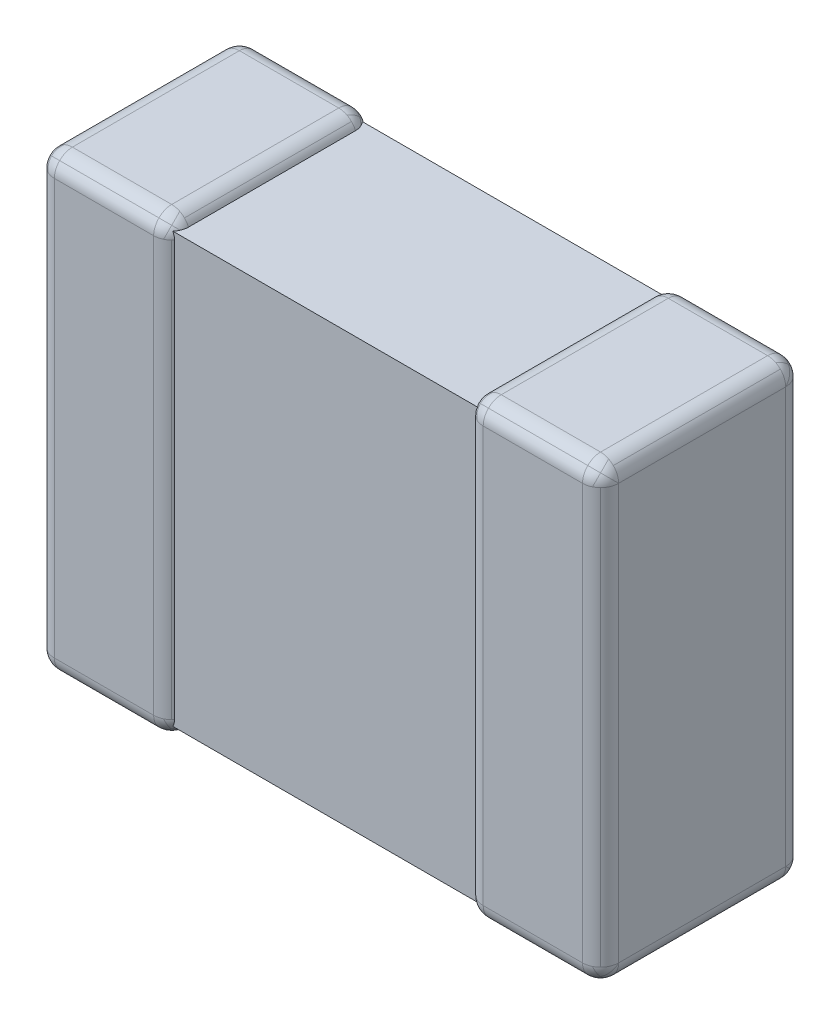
ISO-10303-21;
HEADER;
FILE_DESCRIPTION(('STEP AP214'),'2;1');
FILE_NAME('part.step','',(''),(''),'','','');
FILE_SCHEMA(('AUTOMOTIVE_DESIGN { 1 0 10303 214 1 1 1 1 }'));
ENDSEC;
DATA;
#1=APPLICATION_CONTEXT('core data for automotive mechanical design processes');
#2=APPLICATION_PROTOCOL_DEFINITION('international standard','automotive_design',2000,#1);
#3=PRODUCT_CONTEXT('',#1,'mechanical');
#4=PRODUCT('Part','Part','',(#3));
#5=PRODUCT_RELATED_PRODUCT_CATEGORY('part','',(#4));
#6=PRODUCT_DEFINITION_FORMATION('','',#4);
#7=PRODUCT_DEFINITION_CONTEXT('part definition',#1,'design');
#8=PRODUCT_DEFINITION('design','',#6,#7);
#9=PRODUCT_DEFINITION_SHAPE('','',#8);
#10=(LENGTH_UNIT() NAMED_UNIT(*) SI_UNIT(.MILLI.,.METRE.));
#11=(NAMED_UNIT(*) PLANE_ANGLE_UNIT() SI_UNIT($,.RADIAN.));
#12=(NAMED_UNIT(*) SI_UNIT($,.STERADIAN.) SOLID_ANGLE_UNIT());
#13=UNCERTAINTY_MEASURE_WITH_UNIT(LENGTH_MEASURE(1.E-05),#10,'distance_accuracy_value','');
#14=(GEOMETRIC_REPRESENTATION_CONTEXT(3) GLOBAL_UNCERTAINTY_ASSIGNED_CONTEXT((#13)) GLOBAL_UNIT_ASSIGNED_CONTEXT((#10,
#11,#12)) REPRESENTATION_CONTEXT('',''));
#15=CARTESIAN_POINT('',(0.,0.,0.));
#16=DIRECTION('',(0.,0.,1.));
#17=DIRECTION('',(1.,0.,0.));
#18=AXIS2_PLACEMENT_3D('',#15,#16,#17);
#19=CARTESIAN_POINT('',(5.15,18.2,0.9));
#20=DIRECTION('',(0.,0.,1.));
#21=DIRECTION('',(1.,0.,0.));
#22=AXIS2_PLACEMENT_3D('',#19,#20,#21);
#23=PLANE('',#22);
#24=DIRECTION('',(0.,1.,0.));
#25=VECTOR('',#24,1.);
#26=CARTESIAN_POINT('',(4.93,18.7,0.9));
#27=LINE('',#26,#25);
#28=CARTESIAN_POINT('',(4.93,17.28,0.9));
#29=VERTEX_POINT('',#28);
#30=CARTESIAN_POINT('',(4.93,19.12,0.9));
#31=VERTEX_POINT('',#30);
#32=EDGE_CURVE('E1303',#29,#31,#27,.T.);
#33=ORIENTED_EDGE('',*,*,#32,.F.);
#34=DIRECTION('',(-1.,0.,0.));
#35=VECTOR('',#34,1.);
#36=CARTESIAN_POINT('',(5.,17.28,0.9));
#37=LINE('',#36,#35);
#38=CARTESIAN_POINT('',(5.37,17.28,0.9));
#39=VERTEX_POINT('',#38);
#40=EDGE_CURVE('E1279',#39,#29,#37,.T.);
#41=ORIENTED_EDGE('',*,*,#40,.F.);
#42=DIRECTION('',(0.,-1.,0.));
#43=VECTOR('',#42,1.);
#44=CARTESIAN_POINT('',(5.37,17.7,0.9));
#45=LINE('',#44,#43);
#46=CARTESIAN_POINT('',(5.37,19.12,0.9));
#47=VERTEX_POINT('',#46);
#48=EDGE_CURVE('E1238',#47,#39,#45,.T.);
#49=ORIENTED_EDGE('',*,*,#48,.F.);
#50=DIRECTION('',(1.,0.,0.));
#51=VECTOR('',#50,1.);
#52=CARTESIAN_POINT('',(5.3,19.12,0.9));
#53=LINE('',#52,#51);
#54=EDGE_CURVE('E1119',#31,#47,#53,.T.);
#55=ORIENTED_EDGE('',*,*,#54,.F.);
#56=EDGE_LOOP('',(#33,#41,#49,#55));
#57=FACE_BOUND('',#56,.T.);
#58=ADVANCED_FACE('F18',(#57),#23,.T.);
#59=CARTESIAN_POINT('',(5.45,19.2,0.45));
#60=DIRECTION('',(0.,1.,0.));
#61=DIRECTION('',(1.,0.,0.));
#62=AXIS2_PLACEMENT_3D('',#59,#60,#61);
#63=PLANE('',#62);
#64=DIRECTION('',(0.,0.,-1.));
#65=VECTOR('',#64,1.);
#66=CARTESIAN_POINT('',(4.93,19.2,0.45));
#67=LINE('',#66,#65);
#68=CARTESIAN_POINT('',(4.93,19.2,0.82));
#69=VERTEX_POINT('',#68);
#70=CARTESIAN_POINT('',(4.93,19.2,0.08));
#71=VERTEX_POINT('',#70);
#72=EDGE_CURVE('E1284',#69,#71,#67,.T.);
#73=ORIENTED_EDGE('',*,*,#72,.F.);
#74=DIRECTION('',(-1.,0.,0.));
#75=VECTOR('',#74,1.);
#76=CARTESIAN_POINT('',(5.3,19.2,0.82));
#77=LINE('',#76,#75);
#78=CARTESIAN_POINT('',(5.37,19.2,0.82));
#79=VERTEX_POINT('',#78);
#80=EDGE_CURVE('E27',#79,#69,#77,.T.);
#81=ORIENTED_EDGE('',*,*,#80,.F.);
#82=DIRECTION('',(0.,0.,1.));
#83=VECTOR('',#82,1.);
#84=CARTESIAN_POINT('',(5.37,19.2,0.45));
#85=LINE('',#84,#83);
#86=CARTESIAN_POINT('',(5.37,19.2,0.08));
#87=VERTEX_POINT('',#86);
#88=EDGE_CURVE('E1376',#87,#79,#85,.T.);
#89=ORIENTED_EDGE('',*,*,#88,.F.);
#90=DIRECTION('',(1.,0.,0.));
#91=VECTOR('',#90,1.);
#92=CARTESIAN_POINT('',(5.3,19.2,0.08));
#93=LINE('',#92,#91);
#94=EDGE_CURVE('E1777',#71,#87,#93,.T.);
#95=ORIENTED_EDGE('',*,*,#94,.F.);
#96=EDGE_LOOP('',(#73,#81,#89,#95));
#97=FACE_BOUND('',#96,.T.);
#98=ADVANCED_FACE('F1884',(#97),#63,.T.);
#99=CARTESIAN_POINT('',(4.85,19.2,0.45));
#100=DIRECTION('',(-1.,0.,0.));
#101=DIRECTION('',(0.,0.,1.));
#102=AXIS2_PLACEMENT_3D('',#99,#100,#101);
#103=PLANE('',#102);
#104=DIRECTION('',(0.,0.,1.));
#105=VECTOR('',#104,1.);
#106=CARTESIAN_POINT('',(4.85,19.12,0.45));
#107=LINE('',#106,#105);
#108=CARTESIAN_POINT('',(4.85,19.12,0.08));
#109=VERTEX_POINT('',#108);
#110=CARTESIAN_POINT('',(4.85,19.12,0.82));
#111=VERTEX_POINT('',#110);
#112=EDGE_CURVE('E1773',#109,#111,#107,.T.);
#113=ORIENTED_EDGE('',*,*,#112,.F.);
#114=DIRECTION('',(0.,1.,0.));
#115=VECTOR('',#114,1.);
#116=CARTESIAN_POINT('',(4.85,18.7,0.08));
#117=LINE('',#116,#115);
#118=CARTESIAN_POINT('',(4.85,17.28,0.08));
#119=VERTEX_POINT('',#118);
#120=EDGE_CURVE('E1780',#119,#109,#117,.T.);
#121=ORIENTED_EDGE('',*,*,#120,.F.);
#122=DIRECTION('',(0.,0.,-1.));
#123=VECTOR('',#122,1.);
#124=CARTESIAN_POINT('',(4.85,17.28,0.45));
#125=LINE('',#124,#123);
#126=CARTESIAN_POINT('',(4.85,17.28,0.82));
#127=VERTEX_POINT('',#126);
#128=EDGE_CURVE('E1175',#127,#119,#125,.T.);
#129=ORIENTED_EDGE('',*,*,#128,.F.);
#130=DIRECTION('',(0.,-1.,0.));
#131=VECTOR('',#130,1.);
#132=CARTESIAN_POINT('',(4.85,18.7,0.82));
#133=LINE('',#132,#131);
#134=EDGE_CURVE('E1506',#111,#127,#133,.T.);
#135=ORIENTED_EDGE('',*,*,#134,.F.);
#136=EDGE_LOOP('',(#113,#121,#129,#135));
#137=FACE_BOUND('',#136,.T.);
#138=ADVANCED_FACE('F1791',(#137),#103,.T.);
#139=CARTESIAN_POINT('',(5.15,18.2,0.));
#140=DIRECTION('',(0.,0.,-1.));
#141=DIRECTION('',(0.,-1.,0.));
#142=AXIS2_PLACEMENT_3D('',#139,#140,#141);
#143=PLANE('',#142);
#144=DIRECTION('',(0.,1.,0.));
#145=VECTOR('',#144,1.);
#146=CARTESIAN_POINT('',(5.37,17.7,0.));
#147=LINE('',#146,#145);
#148=CARTESIAN_POINT('',(5.37,17.28,0.));
#149=VERTEX_POINT('',#148);
#150=CARTESIAN_POINT('',(5.37,19.12,0.));
#151=VERTEX_POINT('',#150);
#152=EDGE_CURVE('E1352',#149,#151,#147,.T.);
#153=ORIENTED_EDGE('',*,*,#152,.F.);
#154=DIRECTION('',(1.,0.,0.));
#155=VECTOR('',#154,1.);
#156=CARTESIAN_POINT('',(5.,17.28,0.));
#157=LINE('',#156,#155);
#158=CARTESIAN_POINT('',(4.93,17.28,0.));
#159=VERTEX_POINT('',#158);
#160=EDGE_CURVE('E913',#159,#149,#157,.T.);
#161=ORIENTED_EDGE('',*,*,#160,.F.);
#162=DIRECTION('',(0.,-1.,0.));
#163=VECTOR('',#162,1.);
#164=CARTESIAN_POINT('',(4.93,18.7,0.));
#165=LINE('',#164,#163);
#166=CARTESIAN_POINT('',(4.93,19.12,0.));
#167=VERTEX_POINT('',#166);
#168=EDGE_CURVE('E1327',#167,#159,#165,.T.);
#169=ORIENTED_EDGE('',*,*,#168,.F.);
#170=DIRECTION('',(-1.,0.,0.));
#171=VECTOR('',#170,1.);
#172=CARTESIAN_POINT('',(5.3,19.12,0.));
#173=LINE('',#172,#171);
#174=EDGE_CURVE('E1059',#151,#167,#173,.T.);
#175=ORIENTED_EDGE('',*,*,#174,.F.);
#176=EDGE_LOOP('',(#153,#161,#169,#175));
#177=FACE_BOUND('',#176,.T.);
#178=ADVANCED_FACE('F1921',(#177),#143,.T.);
#179=CARTESIAN_POINT('',(4.85,17.2,0.45));
#180=DIRECTION('',(0.,-1.,0.));
#181=DIRECTION('',(-1.,0.,0.));
#182=AXIS2_PLACEMENT_3D('',#179,#180,#181);
#183=PLANE('',#182);
#184=DIRECTION('',(0.,0.,1.));
#185=VECTOR('',#184,1.);
#186=CARTESIAN_POINT('',(4.93,17.2,0.45));
#187=LINE('',#186,#185);
#188=CARTESIAN_POINT('',(4.93,17.2,0.08));
#189=VERTEX_POINT('',#188);
#190=CARTESIAN_POINT('',(4.93,17.2,0.82));
#191=VERTEX_POINT('',#190);
#192=EDGE_CURVE('E1763',#189,#191,#187,.T.);
#193=ORIENTED_EDGE('',*,*,#192,.F.);
#194=DIRECTION('',(-1.,0.,0.));
#195=VECTOR('',#194,1.);
#196=CARTESIAN_POINT('',(5.,17.2,0.08));
#197=LINE('',#196,#195);
#198=CARTESIAN_POINT('',(5.37,17.2,0.08));
#199=VERTEX_POINT('',#198);
#200=EDGE_CURVE('E1783',#199,#189,#197,.T.);
#201=ORIENTED_EDGE('',*,*,#200,.F.);
#202=DIRECTION('',(0.,0.,-1.));
#203=VECTOR('',#202,1.);
#204=CARTESIAN_POINT('',(5.37,17.2,0.45));
#205=LINE('',#204,#203);
#206=CARTESIAN_POINT('',(5.37,17.2,0.82));
#207=VERTEX_POINT('',#206);
#208=EDGE_CURVE('E1480',#207,#199,#205,.T.);
#209=ORIENTED_EDGE('',*,*,#208,.F.);
#210=DIRECTION('',(1.,0.,0.));
#211=VECTOR('',#210,1.);
#212=CARTESIAN_POINT('',(5.,17.2,0.82));
#213=LINE('',#212,#211);
#214=EDGE_CURVE('E11',#191,#207,#213,.T.);
#215=ORIENTED_EDGE('',*,*,#214,.F.);
#216=EDGE_LOOP('',(#193,#201,#209,#215));
#217=FACE_BOUND('',#216,.T.);
#218=ADVANCED_FACE('F1919',(#217),#183,.T.);
#219=CARTESIAN_POINT('',(5.,17.28,0.82));
#220=DIRECTION('',(-1.,0.,0.));
#221=DIRECTION('',(0.,-0.707106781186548,0.707106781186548));
#222=AXIS2_PLACEMENT_3D('',#219,#220,#221);
#223=CYLINDRICAL_SURFACE('',#222,0.08);
#224=DIRECTION('',(1.,0.,0.));
#225=VECTOR('',#224,1.);
#226=CARTESIAN_POINT('',(5.,17.2234314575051,0.876568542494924));
#227=LINE('',#226,#225);
#228=CARTESIAN_POINT('',(4.93,17.2234314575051,0.876568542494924));
#229=VERTEX_POINT('',#228);
#230=CARTESIAN_POINT('',(5.37,17.2234314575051,0.876568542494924));
#231=VERTEX_POINT('',#230);
#232=EDGE_CURVE('E1288',#229,#231,#227,.T.);
#233=ORIENTED_EDGE('',*,*,#232,.F.);
#234=CARTESIAN_POINT('',(4.93,17.28,0.82));
#235=DIRECTION('',(1.,0.,0.));
#236=DIRECTION('',(0.,0.,1.));
#237=AXIS2_PLACEMENT_3D('',#234,#235,#236);
#238=CIRCLE('',#237,0.08);
#239=EDGE_CURVE('E1756',#229,#191,#238,.T.);
#240=ORIENTED_EDGE('',*,*,#239,.T.);
#241=ORIENTED_EDGE('',*,*,#214,.T.);
#242=CARTESIAN_POINT('',(5.37,17.28,0.82));
#243=DIRECTION('',(-1.,0.,0.));
#244=DIRECTION('',(0.,-1.,0.));
#245=AXIS2_PLACEMENT_3D('',#242,#243,#244);
#246=CIRCLE('',#245,0.08);
#247=EDGE_CURVE('E845',#207,#231,#246,.T.);
#248=ORIENTED_EDGE('',*,*,#247,.T.);
#249=EDGE_LOOP('',(#233,#240,#241,#248));
#250=FACE_BOUND('',#249,.T.);
#251=ADVANCED_FACE('F1858',(#250),#223,.T.);
#252=CARTESIAN_POINT('',(5.3,19.12,0.82));
#253=DIRECTION('',(1.,0.,0.));
#254=DIRECTION('',(0.,0.707106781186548,0.707106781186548));
#255=AXIS2_PLACEMENT_3D('',#252,#253,#254);
#256=CYLINDRICAL_SURFACE('',#255,0.08);
#257=DIRECTION('',(-1.,0.,0.));
#258=VECTOR('',#257,1.);
#259=CARTESIAN_POINT('',(5.3,19.1765685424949,0.876568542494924));
#260=LINE('',#259,#258);
#261=CARTESIAN_POINT('',(5.37,19.1765685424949,0.876568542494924));
#262=VERTEX_POINT('',#261);
#263=CARTESIAN_POINT('',(4.93,19.1765685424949,0.876568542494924));
#264=VERTEX_POINT('',#263);
#265=EDGE_CURVE('E1274',#262,#264,#260,.T.);
#266=ORIENTED_EDGE('',*,*,#265,.F.);
#267=CARTESIAN_POINT('',(5.37,19.12,0.82));
#268=DIRECTION('',(-1.,0.,0.));
#269=DIRECTION('',(0.,0.,1.));
#270=AXIS2_PLACEMENT_3D('',#267,#268,#269);
#271=CIRCLE('',#270,0.08);
#272=EDGE_CURVE('E952',#262,#79,#271,.T.);
#273=ORIENTED_EDGE('',*,*,#272,.T.);
#274=ORIENTED_EDGE('',*,*,#80,.T.);
#275=CARTESIAN_POINT('',(4.93,19.12,0.82));
#276=DIRECTION('',(1.,0.,0.));
#277=DIRECTION('',(0.,1.,0.));
#278=AXIS2_PLACEMENT_3D('',#275,#276,#277);
#279=CIRCLE('',#278,0.08);
#280=EDGE_CURVE('E1215',#69,#264,#279,.T.);
#281=ORIENTED_EDGE('',*,*,#280,.T.);
#282=EDGE_LOOP('',(#266,#273,#274,#281));
#283=FACE_BOUND('',#282,.T.);
#284=ADVANCED_FACE('F1881',(#283),#256,.T.);
#285=CARTESIAN_POINT('',(4.93,18.7,0.82));
#286=DIRECTION('',(0.,1.,0.));
#287=DIRECTION('',(-0.707106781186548,0.,0.707106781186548));
#288=AXIS2_PLACEMENT_3D('',#285,#286,#287);
#289=CYLINDRICAL_SURFACE('',#288,0.08);
#290=DIRECTION('',(0.,-1.,0.));
#291=VECTOR('',#290,1.);
#292=CARTESIAN_POINT('',(4.87343145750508,18.7,0.876568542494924));
#293=LINE('',#292,#291);
#294=CARTESIAN_POINT('',(4.87343145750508,19.12,0.876568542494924));
#295=VERTEX_POINT('',#294);
#296=CARTESIAN_POINT('',(4.87343145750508,17.28,0.876568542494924));
#297=VERTEX_POINT('',#296);
#298=EDGE_CURVE('E717',#295,#297,#293,.T.);
#299=ORIENTED_EDGE('',*,*,#298,.F.);
#300=CARTESIAN_POINT('',(4.93,19.12,0.82));
#301=DIRECTION('',(0.,-1.,0.));
#302=DIRECTION('',(0.,0.,1.));
#303=AXIS2_PLACEMENT_3D('',#300,#301,#302);
#304=CIRCLE('',#303,0.08);
#305=EDGE_CURVE('E720',#295,#111,#304,.T.);
#306=ORIENTED_EDGE('',*,*,#305,.T.);
#307=ORIENTED_EDGE('',*,*,#134,.T.);
#308=CARTESIAN_POINT('',(4.93,17.28,0.82));
#309=DIRECTION('',(0.,1.,0.));
#310=DIRECTION('',(-1.,0.,0.));
#311=AXIS2_PLACEMENT_3D('',#308,#309,#310);
#312=CIRCLE('',#311,0.08);
#313=EDGE_CURVE('E723',#127,#297,#312,.T.);
#314=ORIENTED_EDGE('',*,*,#313,.T.);
#315=EDGE_LOOP('',(#299,#306,#307,#314));
#316=FACE_BOUND('',#315,.T.);
#317=ADVANCED_FACE('F20',(#316),#289,.T.);
#318=CARTESIAN_POINT('',(5.,17.28,0.08));
#319=DIRECTION('',(1.,0.,0.));
#320=DIRECTION('',(0.,-0.707106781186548,-0.707106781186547));
#321=AXIS2_PLACEMENT_3D('',#318,#319,#320);
#322=CYLINDRICAL_SURFACE('',#321,0.08);
#323=DIRECTION('',(-1.,0.,0.));
#324=VECTOR('',#323,1.);
#325=CARTESIAN_POINT('',(5.,17.2234314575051,0.0234314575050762));
#326=LINE('',#325,#324);
#327=CARTESIAN_POINT('',(5.37,17.2234314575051,0.0234314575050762));
#328=VERTEX_POINT('',#327);
#329=CARTESIAN_POINT('',(4.93,17.2234314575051,0.0234314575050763));
#330=VERTEX_POINT('',#329);
#331=EDGE_CURVE('E1306',#328,#330,#326,.T.);
#332=ORIENTED_EDGE('',*,*,#331,.F.);
#333=CARTESIAN_POINT('',(5.37,17.28,0.08));
#334=DIRECTION('',(-1.,0.,0.));
#335=DIRECTION('',(0.,0.,-1.));
#336=AXIS2_PLACEMENT_3D('',#333,#334,#335);
#337=CIRCLE('',#336,0.08);
#338=EDGE_CURVE('E818',#328,#199,#337,.T.);
#339=ORIENTED_EDGE('',*,*,#338,.T.);
#340=ORIENTED_EDGE('',*,*,#200,.T.);
#341=CARTESIAN_POINT('',(4.93,17.28,0.08));
#342=DIRECTION('',(1.,0.,0.));
#343=DIRECTION('',(0.,-1.,0.));
#344=AXIS2_PLACEMENT_3D('',#341,#342,#343);
#345=CIRCLE('',#344,0.08);
#346=EDGE_CURVE('E1174',#189,#330,#345,.T.);
#347=ORIENTED_EDGE('',*,*,#346,.T.);
#348=EDGE_LOOP('',(#332,#339,#340,#347));
#349=FACE_BOUND('',#348,.T.);
#350=ADVANCED_FACE('F1910',(#349),#322,.T.);
#351=CARTESIAN_POINT('',(4.93,18.7,0.08));
#352=DIRECTION('',(0.,-1.,0.));
#353=DIRECTION('',(-0.707106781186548,0.,-0.707106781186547));
#354=AXIS2_PLACEMENT_3D('',#351,#352,#353);
#355=CYLINDRICAL_SURFACE('',#354,0.08);
#356=DIRECTION('',(0.,1.,0.));
#357=VECTOR('',#356,1.);
#358=CARTESIAN_POINT('',(4.87343145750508,18.7,0.0234314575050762));
#359=LINE('',#358,#357);
#360=CARTESIAN_POINT('',(4.87343145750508,17.28,0.0234314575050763));
#361=VERTEX_POINT('',#360);
#362=CARTESIAN_POINT('',(4.87343145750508,19.12,0.0234314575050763));
#363=VERTEX_POINT('',#362);
#364=EDGE_CURVE('E912',#361,#363,#359,.T.);
#365=ORIENTED_EDGE('',*,*,#364,.F.);
#366=CARTESIAN_POINT('',(4.93,17.28,0.08));
#367=DIRECTION('',(0.,1.,0.));
#368=DIRECTION('',(0.,0.,-1.));
#369=AXIS2_PLACEMENT_3D('',#366,#367,#368);
#370=CIRCLE('',#369,0.08);
#371=EDGE_CURVE('E788',#361,#119,#370,.T.);
#372=ORIENTED_EDGE('',*,*,#371,.T.);
#373=ORIENTED_EDGE('',*,*,#120,.T.);
#374=CARTESIAN_POINT('',(4.93,19.12,0.08));
#375=DIRECTION('',(0.,-1.,0.));
#376=DIRECTION('',(-1.,0.,0.));
#377=AXIS2_PLACEMENT_3D('',#374,#375,#376);
#378=CIRCLE('',#377,0.08);
#379=EDGE_CURVE('E1051',#109,#363,#378,.T.);
#380=ORIENTED_EDGE('',*,*,#379,.T.);
#381=EDGE_LOOP('',(#365,#372,#373,#380));
#382=FACE_BOUND('',#381,.T.);
#383=ADVANCED_FACE('F1843',(#382),#355,.T.);
#384=CARTESIAN_POINT('',(5.3,19.12,0.08));
#385=DIRECTION('',(-1.,0.,0.));
#386=DIRECTION('',(0.,0.707106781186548,-0.707106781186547));
#387=AXIS2_PLACEMENT_3D('',#384,#385,#386);
#388=CYLINDRICAL_SURFACE('',#387,0.08);
#389=DIRECTION('',(1.,0.,0.));
#390=VECTOR('',#389,1.);
#391=CARTESIAN_POINT('',(5.3,19.1765685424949,0.0234314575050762));
#392=LINE('',#391,#390);
#393=CARTESIAN_POINT('',(4.93,19.1765685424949,0.0234314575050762));
#394=VERTEX_POINT('',#393);
#395=CARTESIAN_POINT('',(5.37,19.1765685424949,0.0234314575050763));
#396=VERTEX_POINT('',#395);
#397=EDGE_CURVE('E1056',#394,#396,#392,.T.);
#398=ORIENTED_EDGE('',*,*,#397,.F.);
#399=CARTESIAN_POINT('',(4.93,19.12,0.08));
#400=DIRECTION('',(1.,0.,0.));
#401=DIRECTION('',(0.,0.,-1.));
#402=AXIS2_PLACEMENT_3D('',#399,#400,#401);
#403=CIRCLE('',#402,0.08);
#404=EDGE_CURVE('E1769',#394,#71,#403,.T.);
#405=ORIENTED_EDGE('',*,*,#404,.T.);
#406=ORIENTED_EDGE('',*,*,#94,.T.);
#407=CARTESIAN_POINT('',(5.37,19.12,0.08));
#408=DIRECTION('',(-1.,0.,0.));
#409=DIRECTION('',(0.,1.,0.));
#410=AXIS2_PLACEMENT_3D('',#407,#408,#409);
#411=CIRCLE('',#410,0.08);
#412=EDGE_CURVE('E805',#87,#396,#411,.T.);
#413=ORIENTED_EDGE('',*,*,#412,.T.);
#414=EDGE_LOOP('',(#398,#405,#406,#413));
#415=FACE_BOUND('',#414,.T.);
#416=ADVANCED_FACE('F2062',(#415),#388,.T.);
#417=CARTESIAN_POINT('',(4.93,19.12,0.45));
#418=DIRECTION('',(0.,0.,-1.));
#419=DIRECTION('',(-0.707106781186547,0.707106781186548,0.));
#420=AXIS2_PLACEMENT_3D('',#417,#418,#419);
#421=CYLINDRICAL_SURFACE('',#420,0.08);
#422=DIRECTION('',(0.,0.,1.));
#423=VECTOR('',#422,1.);
#424=CARTESIAN_POINT('',(4.87343145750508,19.1765685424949,0.45));
#425=LINE('',#424,#423);
#426=CARTESIAN_POINT('',(4.87343145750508,19.1765685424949,0.08));
#427=VERTEX_POINT('',#426);
#428=CARTESIAN_POINT('',(4.87343145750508,19.1765685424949,0.82));
#429=VERTEX_POINT('',#428);
#430=EDGE_CURVE('E1186',#427,#429,#425,.T.);
#431=ORIENTED_EDGE('',*,*,#430,.F.);
#432=CARTESIAN_POINT('',(4.93,19.12,0.08));
#433=DIRECTION('',(0.,0.,1.));
#434=DIRECTION('',(0.,1.,0.));
#435=AXIS2_PLACEMENT_3D('',#432,#433,#434);
#436=CIRCLE('',#435,0.08);
#437=EDGE_CURVE('E757',#427,#109,#436,.T.);
#438=ORIENTED_EDGE('',*,*,#437,.T.);
#439=ORIENTED_EDGE('',*,*,#112,.T.);
#440=CARTESIAN_POINT('',(4.93,19.12,0.82));
#441=DIRECTION('',(0.,0.,-1.));
#442=DIRECTION('',(-1.,0.,0.));
#443=AXIS2_PLACEMENT_3D('',#440,#441,#442);
#444=CIRCLE('',#443,0.08);
#445=EDGE_CURVE('E977',#111,#429,#444,.T.);
#446=ORIENTED_EDGE('',*,*,#445,.T.);
#447=EDGE_LOOP('',(#431,#438,#439,#446));
#448=FACE_BOUND('',#447,.T.);
#449=ADVANCED_FACE('F1832',(#448),#421,.T.);
#450=CARTESIAN_POINT('',(4.93,19.12,0.08));
#451=DIRECTION('',(0.,0.707106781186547,0.707106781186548));
#452=DIRECTION('',(-0.577350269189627,0.577350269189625,-0.577350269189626));
#453=AXIS2_PLACEMENT_3D('',#450,#451,#452);
#454=SPHERICAL_SURFACE('',#453,0.08);
#455=CARTESIAN_POINT('',(4.93,19.12,0.08));
#456=DIRECTION('',(0.816496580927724,0.408248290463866,-0.408248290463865));
#457=DIRECTION('',(0.,-0.707106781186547,-0.707106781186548));
#458=AXIS2_PLACEMENT_3D('',#455,#456,#457);
#459=CIRCLE('',#458,0.08);
#460=CARTESIAN_POINT('',(4.88381197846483,19.1661880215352,0.0338119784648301));
#461=VERTEX_POINT('',#460);
#462=CARTESIAN_POINT('',(4.89422291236,19.19155417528,0.08));
#463=VERTEX_POINT('',#462);
#464=EDGE_CURVE('E1893',#461,#463,#459,.T.);
#465=ORIENTED_EDGE('',*,*,#464,.T.);
#466=CARTESIAN_POINT('',(4.93,19.12,0.08));
#467=DIRECTION('',(0.,0.,1.));
#468=DIRECTION('',(0.,1.,0.));
#469=AXIS2_PLACEMENT_3D('',#466,#467,#468);
#470=CIRCLE('',#469,0.08);
#471=EDGE_CURVE('E1183',#71,#463,#470,.T.);
#472=ORIENTED_EDGE('',*,*,#471,.F.);
#473=ORIENTED_EDGE('',*,*,#404,.F.);
#474=CARTESIAN_POINT('',(4.93,19.12,0.08));
#475=DIRECTION('',(0.,-0.707106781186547,-0.707106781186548));
#476=DIRECTION('',(0.,-0.707106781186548,0.707106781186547));
#477=AXIS2_PLACEMENT_3D('',#474,#475,#476);
#478=CIRCLE('',#477,0.08);
#479=EDGE_CURVE('E1310',#461,#394,#478,.T.);
#480=ORIENTED_EDGE('',*,*,#479,.F.);
#481=EDGE_LOOP('',(#465,#472,#473,#480));
#482=FACE_BOUND('',#481,.T.);
#483=ADVANCED_FACE('F2059',(#482),#454,.T.);
#484=CARTESIAN_POINT('',(5.37,17.7,0.08));
#485=DIRECTION('',(0.,1.,0.));
#486=DIRECTION('',(0.707106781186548,0.,-0.707106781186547));
#487=AXIS2_PLACEMENT_3D('',#484,#485,#486);
#488=CYLINDRICAL_SURFACE('',#487,0.08);
#489=DIRECTION('',(0.,-1.,0.));
#490=VECTOR('',#489,1.);
#491=CARTESIAN_POINT('',(5.42656854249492,17.7,0.0234314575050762));
#492=LINE('',#491,#490);
#493=CARTESIAN_POINT('',(5.42656854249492,19.12,0.0234314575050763));
#494=VERTEX_POINT('',#493);
#495=CARTESIAN_POINT('',(5.42656854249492,17.28,0.0234314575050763));
#496=VERTEX_POINT('',#495);
#497=EDGE_CURVE('E1360',#494,#496,#492,.T.);
#498=ORIENTED_EDGE('',*,*,#497,.F.);
#499=CARTESIAN_POINT('',(5.37,19.12,0.08));
#500=DIRECTION('',(0.,-1.,0.));
#501=DIRECTION('',(0.,0.,-1.));
#502=AXIS2_PLACEMENT_3D('',#499,#500,#501);
#503=CIRCLE('',#502,0.08);
#504=CARTESIAN_POINT('',(5.43244997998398,19.12,0.03));
#505=VERTEX_POINT('',#504);
#506=EDGE_CURVE('E1392',#494,#505,#503,.T.);
#507=ORIENTED_EDGE('',*,*,#506,.T.);
#508=DIRECTION('',(0.,-1.,0.));
#509=VECTOR('',#508,1.);
#510=CARTESIAN_POINT('',(5.43244997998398,17.7,0.03));
#511=LINE('',#510,#509);
#512=CARTESIAN_POINT('',(5.43244997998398,17.28,0.03));
#513=VERTEX_POINT('',#512);
#514=EDGE_CURVE('E1434',#505,#513,#511,.T.);
#515=ORIENTED_EDGE('',*,*,#514,.T.);
#516=CARTESIAN_POINT('',(5.37,17.28,0.08));
#517=DIRECTION('',(0.,1.,0.));
#518=DIRECTION('',(1.,0.,0.));
#519=AXIS2_PLACEMENT_3D('',#516,#517,#518);
#520=CIRCLE('',#519,0.08);
#521=EDGE_CURVE('E1760',#513,#496,#520,.T.);
#522=ORIENTED_EDGE('',*,*,#521,.T.);
#523=EDGE_LOOP('',(#498,#507,#515,#522));
#524=FACE_BOUND('',#523,.T.);
#525=ADVANCED_FACE('F2055',(#524),#488,.T.);
#526=CARTESIAN_POINT('',(5.37,19.12,0.45));
#527=DIRECTION('',(0.,0.,1.));
#528=DIRECTION('',(0.707106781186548,0.707106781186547,0.));
#529=AXIS2_PLACEMENT_3D('',#526,#527,#528);
#530=CYLINDRICAL_SURFACE('',#529,0.08);
#531=DIRECTION('',(0.,0.,-1.));
#532=VECTOR('',#531,1.);
#533=CARTESIAN_POINT('',(5.42656854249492,19.1765685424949,0.45));
#534=LINE('',#533,#532);
#535=CARTESIAN_POINT('',(5.42656854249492,19.1765685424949,0.82));
#536=VERTEX_POINT('',#535);
#537=CARTESIAN_POINT('',(5.42656854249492,19.1765685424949,0.08));
#538=VERTEX_POINT('',#537);
#539=EDGE_CURVE('E1369',#536,#538,#534,.T.);
#540=ORIENTED_EDGE('',*,*,#539,.F.);
#541=CARTESIAN_POINT('',(5.37,19.12,0.82));
#542=DIRECTION('',(0.,0.,-1.));
#543=DIRECTION('',(0.,1.,0.));
#544=AXIS2_PLACEMENT_3D('',#541,#542,#543);
#545=CIRCLE('',#544,0.08);
#546=CARTESIAN_POINT('',(5.44416198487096,19.15,0.82));
#547=VERTEX_POINT('',#546);
#548=EDGE_CURVE('E1443',#536,#547,#545,.T.);
#549=ORIENTED_EDGE('',*,*,#548,.T.);
#550=DIRECTION('',(0.,0.,-1.));
#551=VECTOR('',#550,1.);
#552=CARTESIAN_POINT('',(5.44416198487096,19.15,0.45));
#553=LINE('',#552,#551);
#554=CARTESIAN_POINT('',(5.44416198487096,19.15,0.08));
#555=VERTEX_POINT('',#554);
#556=EDGE_CURVE('E1694',#547,#555,#553,.T.);
#557=ORIENTED_EDGE('',*,*,#556,.T.);
#558=CARTESIAN_POINT('',(5.37,19.12,0.08));
#559=DIRECTION('',(0.,0.,1.));
#560=DIRECTION('',(1.,0.,0.));
#561=AXIS2_PLACEMENT_3D('',#558,#559,#560);
#562=CIRCLE('',#561,0.08);
#563=EDGE_CURVE('E1766',#555,#538,#562,.T.);
#564=ORIENTED_EDGE('',*,*,#563,.T.);
#565=EDGE_LOOP('',(#540,#549,#557,#564));
#566=FACE_BOUND('',#565,.T.);
#567=ADVANCED_FACE('F1977',(#566),#530,.T.);
#568=CARTESIAN_POINT('',(5.37,19.12,0.08));
#569=DIRECTION('',(0.,0.707106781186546,0.707106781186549));
#570=DIRECTION('',(0.577350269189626,0.577350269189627,-0.577350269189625));
#571=AXIS2_PLACEMENT_3D('',#568,#569,#570);
#572=SPHERICAL_SURFACE('',#571,0.08);
#573=CARTESIAN_POINT('',(5.37,19.12,0.08));
#574=DIRECTION('',(0.816496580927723,-0.408248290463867,0.408248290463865));
#575=DIRECTION('',(0.,0.707106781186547,0.707106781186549));
#576=AXIS2_PLACEMENT_3D('',#573,#574,#575);
#577=CIRCLE('',#576,0.08);
#578=CARTESIAN_POINT('',(5.41618802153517,19.1661880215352,0.0338119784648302));
#579=VERTEX_POINT('',#578);
#580=CARTESIAN_POINT('',(5.40577708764,19.19155417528,0.08));
#581=VERTEX_POINT('',#580);
#582=EDGE_CURVE('E765',#579,#581,#577,.T.);
#583=ORIENTED_EDGE('',*,*,#582,.T.);
#584=CARTESIAN_POINT('',(5.37,19.12,0.08));
#585=DIRECTION('',(0.,0.,1.));
#586=DIRECTION('',(1.,0.,0.));
#587=AXIS2_PLACEMENT_3D('',#584,#585,#586);
#588=CIRCLE('',#587,0.08);
#589=EDGE_CURVE('E1373',#538,#581,#588,.T.);
#590=ORIENTED_EDGE('',*,*,#589,.F.);
#591=ORIENTED_EDGE('',*,*,#563,.F.);
#592=CARTESIAN_POINT('',(5.37,19.15,0.08));
#593=DIRECTION('',(0.,1.,0.));
#594=DIRECTION('',(0.,0.,1.));
#595=AXIS2_PLACEMENT_3D('',#592,#593,#594);
#596=CIRCLE('',#595,0.0741619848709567);
#597=CARTESIAN_POINT('',(5.43782329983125,19.15,0.05));
#598=VERTEX_POINT('',#597);
#599=EDGE_CURVE('E1691',#555,#598,#596,.T.);
#600=ORIENTED_EDGE('',*,*,#599,.T.);
#601=CARTESIAN_POINT('',(5.37,19.12,0.08));
#602=DIRECTION('',(0.,-0.707106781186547,-0.707106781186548));
#603=DIRECTION('',(0.,-0.707106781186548,0.707106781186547));
#604=AXIS2_PLACEMENT_3D('',#601,#602,#603);
#605=CIRCLE('',#604,0.08);
#606=EDGE_CURVE('E1380',#579,#598,#605,.T.);
#607=ORIENTED_EDGE('',*,*,#606,.F.);
#608=EDGE_LOOP('',(#583,#590,#591,#600,#607));
#609=FACE_BOUND('',#608,.T.);
#610=ADVANCED_FACE('F1974',(#609),#572,.T.);
#611=CARTESIAN_POINT('',(4.93,17.28,0.45));
#612=DIRECTION('',(0.,0.,-1.));
#613=DIRECTION('',(-0.707106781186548,-0.707106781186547,0.));
#614=AXIS2_PLACEMENT_3D('',#611,#612,#613);
#615=CYLINDRICAL_SURFACE('',#614,0.08);
#616=DIRECTION('',(0.,0.,1.));
#617=VECTOR('',#616,1.);
#618=CARTESIAN_POINT('',(4.87343145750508,17.2234314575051,0.45));
#619=LINE('',#618,#617);
#620=CARTESIAN_POINT('',(4.87343145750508,17.2234314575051,0.08));
#621=VERTEX_POINT('',#620);
#622=CARTESIAN_POINT('',(4.87343145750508,17.2234314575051,0.82));
#623=VERTEX_POINT('',#622);
#624=EDGE_CURVE('E1396',#621,#623,#619,.T.);
#625=ORIENTED_EDGE('',*,*,#624,.F.);
#626=CARTESIAN_POINT('',(4.93,17.28,0.08));
#627=DIRECTION('',(0.,0.,1.));
#628=DIRECTION('',(-1.,0.,0.));
#629=AXIS2_PLACEMENT_3D('',#626,#627,#628);
#630=CIRCLE('',#629,0.08);
#631=CARTESIAN_POINT('',(4.89422291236,17.20844582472,0.08));
#632=VERTEX_POINT('',#631);
#633=EDGE_CURVE('E959',#621,#632,#630,.T.);
#634=ORIENTED_EDGE('',*,*,#633,.T.);
#635=CARTESIAN_POINT('',(4.93,17.28,0.08));
#636=DIRECTION('',(0.,0.,1.));
#637=DIRECTION('',(-1.,0.,0.));
#638=AXIS2_PLACEMENT_3D('',#635,#636,#637);
#639=CIRCLE('',#638,0.08);
#640=EDGE_CURVE('E1216',#632,#189,#639,.T.);
#641=ORIENTED_EDGE('',*,*,#640,.T.);
#642=ORIENTED_EDGE('',*,*,#192,.T.);
#643=CARTESIAN_POINT('',(4.93,17.28,0.82));
#644=DIRECTION('',(0.,0.,-1.));
#645=DIRECTION('',(0.,-1.,0.));
#646=AXIS2_PLACEMENT_3D('',#643,#644,#645);
#647=CIRCLE('',#646,0.08);
#648=CARTESIAN_POINT('',(4.89422291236,17.20844582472,0.82));
#649=VERTEX_POINT('',#648);
#650=EDGE_CURVE('E1466',#191,#649,#647,.T.);
#651=ORIENTED_EDGE('',*,*,#650,.T.);
#652=CARTESIAN_POINT('',(4.93,17.28,0.82));
#653=DIRECTION('',(0.,0.,-1.));
#654=DIRECTION('',(0.,-1.,0.));
#655=AXIS2_PLACEMENT_3D('',#652,#653,#654);
#656=CIRCLE('',#655,0.08);
#657=EDGE_CURVE('E781',#649,#623,#656,.T.);
#658=ORIENTED_EDGE('',*,*,#657,.T.);
#659=EDGE_LOOP('',(#625,#634,#641,#642,#651,#658));
#660=FACE_BOUND('',#659,.T.);
#661=ADVANCED_FACE('F1855',(#660),#615,.T.);
#662=CARTESIAN_POINT('',(4.93,17.28,0.08));
#663=DIRECTION('',(0.,0.707106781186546,-0.707106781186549));
#664=DIRECTION('',(-0.577350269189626,-0.577350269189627,-0.577350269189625));
#665=AXIS2_PLACEMENT_3D('',#662,#663,#664);
#666=SPHERICAL_SURFACE('',#665,0.08);
#667=CARTESIAN_POINT('',(4.93,17.28,0.08));
#668=DIRECTION('',(0.816496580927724,-0.408248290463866,-0.408248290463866));
#669=DIRECTION('',(0.,-0.707106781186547,0.707106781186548));
#670=AXIS2_PLACEMENT_3D('',#667,#668,#669);
#671=CIRCLE('',#670,0.08);
#672=CARTESIAN_POINT('',(4.88381197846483,17.2338119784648,0.0338119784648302));
#673=VERTEX_POINT('',#672);
#674=CARTESIAN_POINT('',(4.89422291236,17.28,0.00844582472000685));
#675=VERTEX_POINT('',#674);
#676=EDGE_CURVE('E833',#673,#675,#671,.T.);
#677=ORIENTED_EDGE('',*,*,#676,.T.);
#678=CARTESIAN_POINT('',(4.93,17.28,0.08));
#679=DIRECTION('',(0.,1.,0.));
#680=DIRECTION('',(0.,0.,-1.));
#681=AXIS2_PLACEMENT_3D('',#678,#679,#680);
#682=CIRCLE('',#681,0.08);
#683=EDGE_CURVE('E909',#159,#675,#682,.T.);
#684=ORIENTED_EDGE('',*,*,#683,.F.);
#685=CARTESIAN_POINT('',(4.93,17.28,0.08));
#686=DIRECTION('',(1.,0.,0.));
#687=DIRECTION('',(0.,-1.,0.));
#688=AXIS2_PLACEMENT_3D('',#685,#686,#687);
#689=CIRCLE('',#688,0.08);
#690=EDGE_CURVE('E1314',#330,#159,#689,.T.);
#691=ORIENTED_EDGE('',*,*,#690,.F.);
#692=CARTESIAN_POINT('',(4.93,17.28,0.08));
#693=DIRECTION('',(0.,-0.707106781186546,0.707106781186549));
#694=DIRECTION('',(0.,0.707106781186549,0.707106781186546));
#695=AXIS2_PLACEMENT_3D('',#692,#693,#694);
#696=CIRCLE('',#695,0.08);
#697=EDGE_CURVE('E1170',#673,#330,#696,.T.);
#698=ORIENTED_EDGE('',*,*,#697,.F.);
#699=EDGE_LOOP('',(#677,#684,#691,#698));
#700=FACE_BOUND('',#699,.T.);
#701=ADVANCED_FACE('F1996',(#700),#666,.T.);
#702=CARTESIAN_POINT('',(4.93,19.12,0.82));
#703=DIRECTION('',(0.,-0.707106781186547,0.707106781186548));
#704=DIRECTION('',(-0.577350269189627,0.577350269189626,0.577350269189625));
#705=AXIS2_PLACEMENT_3D('',#702,#703,#704);
#706=SPHERICAL_SURFACE('',#705,0.08);
#707=CARTESIAN_POINT('',(4.93,19.12,0.82));
#708=DIRECTION('',(0.816496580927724,0.408248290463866,0.408248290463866));
#709=DIRECTION('',(0.,0.707106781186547,-0.707106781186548));
#710=AXIS2_PLACEMENT_3D('',#707,#708,#709);
#711=CIRCLE('',#710,0.08);
#712=CARTESIAN_POINT('',(4.88381197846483,19.1661880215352,0.86618802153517));
#713=VERTEX_POINT('',#712);
#714=CARTESIAN_POINT('',(4.89422291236,19.12,0.891554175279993));
#715=VERTEX_POINT('',#714);
#716=EDGE_CURVE('E751',#713,#715,#711,.T.);
#717=ORIENTED_EDGE('',*,*,#716,.T.);
#718=CARTESIAN_POINT('',(4.93,19.12,0.82));
#719=DIRECTION('',(0.,-1.,0.));
#720=DIRECTION('',(0.,0.,1.));
#721=AXIS2_PLACEMENT_3D('',#718,#719,#720);
#722=CIRCLE('',#721,0.08);
#723=EDGE_CURVE('E729',#31,#715,#722,.T.);
#724=ORIENTED_EDGE('',*,*,#723,.F.);
#725=CARTESIAN_POINT('',(4.93,19.12,0.82));
#726=DIRECTION('',(1.,0.,0.));
#727=DIRECTION('',(0.,1.,0.));
#728=AXIS2_PLACEMENT_3D('',#725,#726,#727);
#729=CIRCLE('',#728,0.08);
#730=EDGE_CURVE('E1278',#264,#31,#729,.T.);
#731=ORIENTED_EDGE('',*,*,#730,.F.);
#732=CARTESIAN_POINT('',(4.93,19.12,0.82));
#733=DIRECTION('',(0.,0.707106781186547,-0.707106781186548));
#734=DIRECTION('',(0.,-0.707106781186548,-0.707106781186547));
#735=AXIS2_PLACEMENT_3D('',#732,#733,#734);
#736=CIRCLE('',#735,0.08);
#737=EDGE_CURVE('E1211',#713,#264,#736,.T.);
#738=ORIENTED_EDGE('',*,*,#737,.F.);
#739=EDGE_LOOP('',(#717,#724,#731,#738));
#740=FACE_BOUND('',#739,.T.);
#741=ADVANCED_FACE('F1822',(#740),#706,.T.);
#742=CARTESIAN_POINT('',(5.37,17.28,0.08));
#743=DIRECTION('',(0.,0.707106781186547,-0.707106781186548));
#744=DIRECTION('',(0.577350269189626,-0.577350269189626,-0.577350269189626));
#745=AXIS2_PLACEMENT_3D('',#742,#743,#744);
#746=SPHERICAL_SURFACE('',#745,0.08);
#747=CARTESIAN_POINT('',(5.37,17.28,0.08));
#748=DIRECTION('',(0.816496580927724,0.408248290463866,0.408248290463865));
#749=DIRECTION('',(0.,0.707106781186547,-0.707106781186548));
#750=AXIS2_PLACEMENT_3D('',#747,#748,#749);
#751=CIRCLE('',#750,0.08);
#752=CARTESIAN_POINT('',(5.41618802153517,17.2338119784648,0.0338119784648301));
#753=VERTEX_POINT('',#752);
#754=CARTESIAN_POINT('',(5.40577708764,17.28,0.00844582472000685));
#755=VERTEX_POINT('',#754);
#756=EDGE_CURVE('E739',#753,#755,#751,.T.);
#757=ORIENTED_EDGE('',*,*,#756,.T.);
#758=CARTESIAN_POINT('',(5.37,17.28,0.08));
#759=DIRECTION('',(0.,1.,0.));
#760=DIRECTION('',(1.,0.,0.));
#761=AXIS2_PLACEMENT_3D('',#758,#759,#760);
#762=CIRCLE('',#761,0.08);
#763=EDGE_CURVE('E1356',#496,#755,#762,.T.);
#764=ORIENTED_EDGE('',*,*,#763,.F.);
#765=ORIENTED_EDGE('',*,*,#521,.F.);
#766=CARTESIAN_POINT('',(5.37,17.28,0.03));
#767=DIRECTION('',(0.,0.,-1.));
#768=DIRECTION('',(0.,1.,0.));
#769=AXIS2_PLACEMENT_3D('',#766,#767,#768);
#770=CIRCLE('',#769,0.0624499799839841);
#771=CARTESIAN_POINT('',(5.42477225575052,17.25,0.03));
#772=VERTEX_POINT('',#771);
#773=EDGE_CURVE('E1430',#513,#772,#770,.T.);
#774=ORIENTED_EDGE('',*,*,#773,.T.);
#775=CARTESIAN_POINT('',(5.37,17.25,0.08));
#776=DIRECTION('',(0.,-1.,0.));
#777=DIRECTION('',(0.,0.,-1.));
#778=AXIS2_PLACEMENT_3D('',#775,#776,#777);
#779=CIRCLE('',#778,0.0741619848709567);
#780=CARTESIAN_POINT('',(5.43782329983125,17.25,0.05));
#781=VERTEX_POINT('',#780);
#782=EDGE_CURVE('E1705',#772,#781,#779,.T.);
#783=ORIENTED_EDGE('',*,*,#782,.T.);
#784=CARTESIAN_POINT('',(5.37,17.28,0.08));
#785=DIRECTION('',(0.,-0.707106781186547,0.707106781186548));
#786=DIRECTION('',(0.,0.707106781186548,0.707106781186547));
#787=AXIS2_PLACEMENT_3D('',#784,#785,#786);
#788=CIRCLE('',#787,0.08);
#789=EDGE_CURVE('E1195',#753,#781,#788,.T.);
#790=ORIENTED_EDGE('',*,*,#789,.F.);
#791=EDGE_LOOP('',(#757,#764,#765,#774,#783,#790));
#792=FACE_BOUND('',#791,.T.);
#793=ADVANCED_FACE('F1995',(#792),#746,.T.);
#794=CARTESIAN_POINT('',(4.93,17.28,0.82));
#795=DIRECTION('',(0.,-0.707106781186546,-0.707106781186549));
#796=DIRECTION('',(-0.577350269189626,-0.577350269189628,0.577350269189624));
#797=AXIS2_PLACEMENT_3D('',#794,#795,#796);
#798=SPHERICAL_SURFACE('',#797,0.08);
#799=CARTESIAN_POINT('',(4.93,17.28,0.82));
#800=DIRECTION('',(0.816496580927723,-0.408248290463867,0.408248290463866));
#801=DIRECTION('',(0.,0.707106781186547,0.707106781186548));
#802=AXIS2_PLACEMENT_3D('',#799,#800,#801);
#803=CIRCLE('',#802,0.08);
#804=CARTESIAN_POINT('',(4.88381197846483,17.2338119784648,0.86618802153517));
#805=VERTEX_POINT('',#804);
#806=EDGE_CURVE('E804',#805,#649,#803,.T.);
#807=ORIENTED_EDGE('',*,*,#806,.T.);
#808=ORIENTED_EDGE('',*,*,#650,.F.);
#809=ORIENTED_EDGE('',*,*,#239,.F.);
#810=CARTESIAN_POINT('',(4.93,17.28,0.82));
#811=DIRECTION('',(0.,0.707106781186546,0.707106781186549));
#812=DIRECTION('',(0.,0.707106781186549,-0.707106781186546));
#813=AXIS2_PLACEMENT_3D('',#810,#811,#812);
#814=CIRCLE('',#813,0.08);
#815=EDGE_CURVE('E1425',#805,#229,#814,.T.);
#816=ORIENTED_EDGE('',*,*,#815,.F.);
#817=EDGE_LOOP('',(#807,#808,#809,#816));
#818=FACE_BOUND('',#817,.T.);
#819=ADVANCED_FACE('F1806',(#818),#798,.T.);
#820=CARTESIAN_POINT('',(5.37,19.12,0.82));
#821=DIRECTION('',(0.,-0.707106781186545,0.70710678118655));
#822=DIRECTION('',(0.577350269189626,0.577350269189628,0.577350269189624));
#823=AXIS2_PLACEMENT_3D('',#820,#821,#822);
#824=SPHERICAL_SURFACE('',#823,0.08);
#825=CARTESIAN_POINT('',(5.37,19.12,0.82));
#826=DIRECTION('',(0.816496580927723,-0.408248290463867,-0.408248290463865));
#827=DIRECTION('',(0.,-0.707106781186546,0.707106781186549));
#828=AXIS2_PLACEMENT_3D('',#825,#826,#827);
#829=CIRCLE('',#828,0.08);
#830=CARTESIAN_POINT('',(5.41618802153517,19.1661880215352,0.86618802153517));
#831=VERTEX_POINT('',#830);
#832=CARTESIAN_POINT('',(5.40577708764,19.12,0.891554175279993));
#833=VERTEX_POINT('',#832);
#834=EDGE_CURVE('E776',#831,#833,#829,.T.);
#835=ORIENTED_EDGE('',*,*,#834,.T.);
#836=CARTESIAN_POINT('',(5.37,19.12,0.82));
#837=DIRECTION('',(0.,-1.,0.));
#838=DIRECTION('',(1.,0.,0.));
#839=AXIS2_PLACEMENT_3D('',#836,#837,#838);
#840=CIRCLE('',#839,0.08);
#841=CARTESIAN_POINT('',(5.42656854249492,19.12,0.876568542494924));
#842=VERTEX_POINT('',#841);
#843=EDGE_CURVE('E1452',#842,#833,#840,.T.);
#844=ORIENTED_EDGE('',*,*,#843,.F.);
#845=CARTESIAN_POINT('',(5.37,19.12,0.82));
#846=DIRECTION('',(0.,-1.,0.));
#847=DIRECTION('',(1.,0.,0.));
#848=AXIS2_PLACEMENT_3D('',#845,#846,#847);
#849=CIRCLE('',#848,0.08);
#850=CARTESIAN_POINT('',(5.43244997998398,19.12,0.87));
#851=VERTEX_POINT('',#850);
#852=EDGE_CURVE('E1463',#851,#842,#849,.T.);
#853=ORIENTED_EDGE('',*,*,#852,.F.);
#854=CARTESIAN_POINT('',(5.37,19.12,0.87));
#855=DIRECTION('',(0.,0.,1.));
#856=DIRECTION('',(0.,-1.,0.));
#857=AXIS2_PLACEMENT_3D('',#854,#855,#856);
#858=CIRCLE('',#857,0.0624499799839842);
#859=CARTESIAN_POINT('',(5.42477225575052,19.15,0.87));
#860=VERTEX_POINT('',#859);
#861=EDGE_CURVE('E1210',#851,#860,#858,.T.);
#862=ORIENTED_EDGE('',*,*,#861,.T.);
#863=CARTESIAN_POINT('',(5.37,19.15,0.82));
#864=DIRECTION('',(0.,1.,0.));
#865=DIRECTION('',(0.,0.,1.));
#866=AXIS2_PLACEMENT_3D('',#863,#864,#865);
#867=CIRCLE('',#866,0.0741619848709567);
#868=CARTESIAN_POINT('',(5.43782329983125,19.15,0.85));
#869=VERTEX_POINT('',#868);
#870=EDGE_CURVE('E1695',#860,#869,#867,.T.);
#871=ORIENTED_EDGE('',*,*,#870,.T.);
#872=CARTESIAN_POINT('',(5.37,19.12,0.82));
#873=DIRECTION('',(0.,0.707106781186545,-0.70710678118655));
#874=DIRECTION('',(0.,-0.70710678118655,-0.707106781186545));
#875=AXIS2_PLACEMENT_3D('',#872,#873,#874);
#876=CIRCLE('',#875,0.08);
#877=EDGE_CURVE('E1429',#831,#869,#876,.T.);
#878=ORIENTED_EDGE('',*,*,#877,.F.);
#879=EDGE_LOOP('',(#835,#844,#853,#862,#871,#878));
#880=FACE_BOUND('',#879,.T.);
#881=ADVANCED_FACE('F2116',(#880),#824,.T.);
#882=CARTESIAN_POINT('',(5.37,17.7,0.82));
#883=DIRECTION('',(0.,-1.,0.));
#884=DIRECTION('',(0.707106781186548,0.,0.707106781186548));
#885=AXIS2_PLACEMENT_3D('',#882,#883,#884);
#886=CYLINDRICAL_SURFACE('',#885,0.08);
#887=DIRECTION('',(0.,1.,0.));
#888=VECTOR('',#887,1.);
#889=CARTESIAN_POINT('',(5.42656854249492,17.7,0.876568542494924));
#890=LINE('',#889,#888);
#891=CARTESIAN_POINT('',(5.42656854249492,17.28,0.876568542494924));
#892=VERTEX_POINT('',#891);
#893=EDGE_CURVE('E1451',#892,#842,#890,.T.);
#894=ORIENTED_EDGE('',*,*,#893,.F.);
#895=CARTESIAN_POINT('',(5.37,17.28,0.82));
#896=DIRECTION('',(0.,1.,0.));
#897=DIRECTION('',(0.,0.,1.));
#898=AXIS2_PLACEMENT_3D('',#895,#896,#897);
#899=CIRCLE('',#898,0.08);
#900=CARTESIAN_POINT('',(5.43244997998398,17.28,0.87));
#901=VERTEX_POINT('',#900);
#902=EDGE_CURVE('E1335',#892,#901,#899,.T.);
#903=ORIENTED_EDGE('',*,*,#902,.T.);
#904=DIRECTION('',(0.,1.,0.));
#905=VECTOR('',#904,1.);
#906=CARTESIAN_POINT('',(5.43244997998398,17.7,0.87));
#907=LINE('',#906,#905);
#908=EDGE_CURVE('E1205',#901,#851,#907,.T.);
#909=ORIENTED_EDGE('',*,*,#908,.T.);
#910=ORIENTED_EDGE('',*,*,#852,.T.);
#911=EDGE_LOOP('',(#894,#903,#909,#910));
#912=FACE_BOUND('',#911,.T.);
#913=ADVANCED_FACE('F2018',(#912),#886,.T.);
#914=CARTESIAN_POINT('',(5.37,17.28,0.82));
#915=DIRECTION('',(0.,-0.707106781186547,-0.707106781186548));
#916=DIRECTION('',(0.577350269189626,-0.577350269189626,0.577350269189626));
#917=AXIS2_PLACEMENT_3D('',#914,#915,#916);
#918=SPHERICAL_SURFACE('',#917,0.08);
#919=CARTESIAN_POINT('',(5.37,17.28,0.82));
#920=DIRECTION('',(0.816496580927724,0.408248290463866,-0.408248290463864));
#921=DIRECTION('',(0.,-0.707106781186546,-0.707106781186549));
#922=AXIS2_PLACEMENT_3D('',#919,#920,#921);
#923=CIRCLE('',#922,0.08);
#924=CARTESIAN_POINT('',(5.41618802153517,17.2338119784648,0.86618802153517));
#925=VERTEX_POINT('',#924);
#926=CARTESIAN_POINT('',(5.40577708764,17.20844582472,0.82));
#927=VERTEX_POINT('',#926);
#928=EDGE_CURVE('E850',#925,#927,#923,.T.);
#929=ORIENTED_EDGE('',*,*,#928,.T.);
#930=CARTESIAN_POINT('',(5.37,17.28,0.82));
#931=DIRECTION('',(0.,0.,-1.));
#932=DIRECTION('',(1.,0.,0.));
#933=AXIS2_PLACEMENT_3D('',#930,#931,#932);
#934=CIRCLE('',#933,0.08);
#935=CARTESIAN_POINT('',(5.42656854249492,17.2234314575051,0.82));
#936=VERTEX_POINT('',#935);
#937=EDGE_CURVE('E1334',#936,#927,#934,.T.);
#938=ORIENTED_EDGE('',*,*,#937,.F.);
#939=CARTESIAN_POINT('',(5.37,17.28,0.82));
#940=DIRECTION('',(0.,0.,-1.));
#941=DIRECTION('',(1.,0.,0.));
#942=AXIS2_PLACEMENT_3D('',#939,#940,#941);
#943=CIRCLE('',#942,0.08);
#944=CARTESIAN_POINT('',(5.44416198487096,17.25,0.82));
#945=VERTEX_POINT('',#944);
#946=EDGE_CURVE('E1467',#945,#936,#943,.T.);
#947=ORIENTED_EDGE('',*,*,#946,.F.);
#948=CARTESIAN_POINT('',(5.37,17.25,0.82));
#949=DIRECTION('',(0.,-1.,0.));
#950=DIRECTION('',(0.,0.,-1.));
#951=AXIS2_PLACEMENT_3D('',#948,#949,#950);
#952=CIRCLE('',#951,0.0741619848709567);
#953=CARTESIAN_POINT('',(5.43782329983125,17.25,0.85));
#954=VERTEX_POINT('',#953);
#955=EDGE_CURVE('E1655',#945,#954,#952,.T.);
#956=ORIENTED_EDGE('',*,*,#955,.T.);
#957=CARTESIAN_POINT('',(5.37,17.28,0.82));
#958=DIRECTION('',(0.,0.707106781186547,0.707106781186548));
#959=DIRECTION('',(0.,0.707106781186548,-0.707106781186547));
#960=AXIS2_PLACEMENT_3D('',#957,#958,#959);
#961=CIRCLE('',#960,0.08);
#962=EDGE_CURVE('E1233',#925,#954,#961,.T.);
#963=ORIENTED_EDGE('',*,*,#962,.F.);
#964=EDGE_LOOP('',(#929,#938,#947,#956,#963));
#965=FACE_BOUND('',#964,.T.);
#966=ADVANCED_FACE('F2014',(#965),#918,.T.);
#967=CARTESIAN_POINT('',(5.37,17.28,0.45));
#968=DIRECTION('',(0.,0.,-1.));
#969=DIRECTION('',(0.707106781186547,-0.707106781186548,0.));
#970=AXIS2_PLACEMENT_3D('',#967,#968,#969);
#971=CYLINDRICAL_SURFACE('',#970,0.08);
#972=DIRECTION('',(0.,0.,1.));
#973=VECTOR('',#972,1.);
#974=CARTESIAN_POINT('',(5.42656854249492,17.2234314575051,0.45));
#975=LINE('',#974,#973);
#976=CARTESIAN_POINT('',(5.42656854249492,17.2234314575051,0.08));
#977=VERTEX_POINT('',#976);
#978=EDGE_CURVE('E1330',#977,#936,#975,.T.);
#979=ORIENTED_EDGE('',*,*,#978,.F.);
#980=CARTESIAN_POINT('',(5.37,17.28,0.08));
#981=DIRECTION('',(0.,0.,1.));
#982=DIRECTION('',(0.,-1.,0.));
#983=AXIS2_PLACEMENT_3D('',#980,#981,#982);
#984=CIRCLE('',#983,0.08);
#985=CARTESIAN_POINT('',(5.44416198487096,17.25,0.08));
#986=VERTEX_POINT('',#985);
#987=EDGE_CURVE('E1194',#977,#986,#984,.T.);
#988=ORIENTED_EDGE('',*,*,#987,.T.);
#989=DIRECTION('',(0.,0.,1.));
#990=VECTOR('',#989,1.);
#991=CARTESIAN_POINT('',(5.44416198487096,17.25,0.45));
#992=LINE('',#991,#990);
#993=EDGE_CURVE('E1658',#986,#945,#992,.T.);
#994=ORIENTED_EDGE('',*,*,#993,.T.);
#995=ORIENTED_EDGE('',*,*,#946,.T.);
#996=EDGE_LOOP('',(#979,#988,#994,#995));
#997=FACE_BOUND('',#996,.T.);
#998=ADVANCED_FACE('F2017',(#997),#971,.T.);
#999=CARTESIAN_POINT('',(7.05,18.2,0.9));
#1000=DIRECTION('',(0.,0.,1.));
#1001=DIRECTION('',(1.,0.,0.));
#1002=AXIS2_PLACEMENT_3D('',#999,#1000,#1001);
#1003=PLANE('',#1002);
#1004=DIRECTION('',(0.,1.,0.));
#1005=VECTOR('',#1004,1.);
#1006=CARTESIAN_POINT('',(6.83,18.7,0.9));
#1007=LINE('',#1006,#1005);
#1008=CARTESIAN_POINT('',(6.83,17.28,0.9));
#1009=VERTEX_POINT('',#1008);
#1010=CARTESIAN_POINT('',(6.83,19.12,0.9));
#1011=VERTEX_POINT('',#1010);
#1012=EDGE_CURVE('E1527',#1009,#1011,#1007,.T.);
#1013=ORIENTED_EDGE('',*,*,#1012,.F.);
#1014=DIRECTION('',(-1.,0.,0.));
#1015=VECTOR('',#1014,1.);
#1016=CARTESIAN_POINT('',(6.9,17.28,0.9));
#1017=LINE('',#1016,#1015);
#1018=CARTESIAN_POINT('',(7.27,17.28,0.9));
#1019=VERTEX_POINT('',#1018);
#1020=EDGE_CURVE('E1491',#1019,#1009,#1017,.T.);
#1021=ORIENTED_EDGE('',*,*,#1020,.F.);
#1022=DIRECTION('',(0.,-1.,0.));
#1023=VECTOR('',#1022,1.);
#1024=CARTESIAN_POINT('',(7.27,17.7,0.9));
#1025=LINE('',#1024,#1023);
#1026=CARTESIAN_POINT('',(7.27,19.12,0.9));
#1027=VERTEX_POINT('',#1026);
#1028=EDGE_CURVE('E1417',#1027,#1019,#1025,.T.);
#1029=ORIENTED_EDGE('',*,*,#1028,.F.);
#1030=DIRECTION('',(1.,0.,0.));
#1031=VECTOR('',#1030,1.);
#1032=CARTESIAN_POINT('',(7.2,19.12,0.9));
#1033=LINE('',#1032,#1031);
#1034=EDGE_CURVE('E1514',#1011,#1027,#1033,.T.);
#1035=ORIENTED_EDGE('',*,*,#1034,.F.);
#1036=EDGE_LOOP('',(#1013,#1021,#1029,#1035));
#1037=FACE_BOUND('',#1036,.T.);
#1038=ADVANCED_FACE('F2027',(#1037),#1003,.T.);
#1039=CARTESIAN_POINT('',(7.35,19.2,0.45));
#1040=DIRECTION('',(0.,1.,0.));
#1041=DIRECTION('',(1.,0.,0.));
#1042=AXIS2_PLACEMENT_3D('',#1039,#1040,#1041);
#1043=PLANE('',#1042);
#1044=DIRECTION('',(0.,0.,-1.));
#1045=VECTOR('',#1044,1.);
#1046=CARTESIAN_POINT('',(6.83,19.2,0.45));
#1047=LINE('',#1046,#1045);
#1048=CARTESIAN_POINT('',(6.83,19.2,0.82));
#1049=VERTEX_POINT('',#1048);
#1050=CARTESIAN_POINT('',(6.83,19.2,0.08));
#1051=VERTEX_POINT('',#1050);
#1052=EDGE_CURVE('E1639',#1049,#1051,#1047,.T.);
#1053=ORIENTED_EDGE('',*,*,#1052,.F.);
#1054=DIRECTION('',(-1.,0.,0.));
#1055=VECTOR('',#1054,1.);
#1056=CARTESIAN_POINT('',(7.2,19.2,0.82));
#1057=LINE('',#1056,#1055);
#1058=CARTESIAN_POINT('',(7.27,19.2,0.82));
#1059=VERTEX_POINT('',#1058);
#1060=EDGE_CURVE('E1343',#1059,#1049,#1057,.T.);
#1061=ORIENTED_EDGE('',*,*,#1060,.F.);
#1062=DIRECTION('',(0.,0.,1.));
#1063=VECTOR('',#1062,1.);
#1064=CARTESIAN_POINT('',(7.27,19.2,0.45));
#1065=LINE('',#1064,#1063);
#1066=CARTESIAN_POINT('',(7.27,19.2,0.08));
#1067=VERTEX_POINT('',#1066);
#1068=EDGE_CURVE('E1562',#1067,#1059,#1065,.T.);
#1069=ORIENTED_EDGE('',*,*,#1068,.F.);
#1070=DIRECTION('',(1.,0.,0.));
#1071=VECTOR('',#1070,1.);
#1072=CARTESIAN_POINT('',(7.2,19.2,0.08));
#1073=LINE('',#1072,#1071);
#1074=EDGE_CURVE('E1743',#1051,#1067,#1073,.T.);
#1075=ORIENTED_EDGE('',*,*,#1074,.F.);
#1076=EDGE_LOOP('',(#1053,#1061,#1069,#1075));
#1077=FACE_BOUND('',#1076,.T.);
#1078=ADVANCED_FACE('F2048',(#1077),#1043,.T.);
#1079=CARTESIAN_POINT('',(7.05,18.2,0.));
#1080=DIRECTION('',(0.,0.,-1.));
#1081=DIRECTION('',(0.,-1.,0.));
#1082=AXIS2_PLACEMENT_3D('',#1079,#1080,#1081);
#1083=PLANE('',#1082);
#1084=DIRECTION('',(0.,1.,0.));
#1085=VECTOR('',#1084,1.);
#1086=CARTESIAN_POINT('',(7.27,17.7,0.));
#1087=LINE('',#1086,#1085);
#1088=CARTESIAN_POINT('',(7.27,17.28,0.));
#1089=VERTEX_POINT('',#1088);
#1090=CARTESIAN_POINT('',(7.27,19.12,0.));
#1091=VERTEX_POINT('',#1090);
#1092=EDGE_CURVE('E1548',#1089,#1091,#1087,.T.);
#1093=ORIENTED_EDGE('',*,*,#1092,.F.);
#1094=DIRECTION('',(1.,0.,0.));
#1095=VECTOR('',#1094,1.);
#1096=CARTESIAN_POINT('',(6.9,17.28,0.));
#1097=LINE('',#1096,#1095);
#1098=CARTESIAN_POINT('',(6.83,17.28,0.));
#1099=VERTEX_POINT('',#1098);
#1100=EDGE_CURVE('E1257',#1099,#1089,#1097,.T.);
#1101=ORIENTED_EDGE('',*,*,#1100,.F.);
#1102=DIRECTION('',(0.,-1.,0.));
#1103=VECTOR('',#1102,1.);
#1104=CARTESIAN_POINT('',(6.83,18.7,0.));
#1105=LINE('',#1104,#1103);
#1106=CARTESIAN_POINT('',(6.83,19.12,0.));
#1107=VERTEX_POINT('',#1106);
#1108=EDGE_CURVE('E1662',#1107,#1099,#1105,.T.);
#1109=ORIENTED_EDGE('',*,*,#1108,.F.);
#1110=DIRECTION('',(-1.,0.,0.));
#1111=VECTOR('',#1110,1.);
#1112=CARTESIAN_POINT('',(7.2,19.12,0.));
#1113=LINE('',#1112,#1111);
#1114=EDGE_CURVE('E1252',#1091,#1107,#1113,.T.);
#1115=ORIENTED_EDGE('',*,*,#1114,.F.);
#1116=EDGE_LOOP('',(#1093,#1101,#1109,#1115));
#1117=FACE_BOUND('',#1116,.T.);
#1118=ADVANCED_FACE('F2044',(#1117),#1083,.T.);
#1119=CARTESIAN_POINT('',(7.35,17.2,0.45));
#1120=DIRECTION('',(1.,0.,0.));
#1121=DIRECTION('',(0.,-1.,0.));
#1122=AXIS2_PLACEMENT_3D('',#1119,#1120,#1121);
#1123=PLANE('',#1122);
#1124=DIRECTION('',(0.,0.,-1.));
#1125=VECTOR('',#1124,1.);
#1126=CARTESIAN_POINT('',(7.35,19.12,0.45));
#1127=LINE('',#1126,#1125);
#1128=CARTESIAN_POINT('',(7.35,19.12,0.82));
#1129=VERTEX_POINT('',#1128);
#1130=CARTESIAN_POINT('',(7.35,19.12,0.08));
#1131=VERTEX_POINT('',#1130);
#1132=EDGE_CURVE('E1739',#1129,#1131,#1127,.T.);
#1133=ORIENTED_EDGE('',*,*,#1132,.F.);
#1134=DIRECTION('',(0.,1.,0.));
#1135=VECTOR('',#1134,1.);
#1136=CARTESIAN_POINT('',(7.35,17.7,0.82));
#1137=LINE('',#1136,#1135);
#1138=CARTESIAN_POINT('',(7.35,17.28,0.82));
#1139=VERTEX_POINT('',#1138);
#1140=EDGE_CURVE('E1346',#1139,#1129,#1137,.T.);
#1141=ORIENTED_EDGE('',*,*,#1140,.F.);
#1142=DIRECTION('',(0.,0.,1.));
#1143=VECTOR('',#1142,1.);
#1144=CARTESIAN_POINT('',(7.35,17.28,0.45));
#1145=LINE('',#1144,#1143);
#1146=CARTESIAN_POINT('',(7.35,17.28,0.08));
#1147=VERTEX_POINT('',#1146);
#1148=EDGE_CURVE('E1729',#1147,#1139,#1145,.T.);
#1149=ORIENTED_EDGE('',*,*,#1148,.F.);
#1150=DIRECTION('',(0.,-1.,0.));
#1151=VECTOR('',#1150,1.);
#1152=CARTESIAN_POINT('',(7.35,17.7,0.08));
#1153=LINE('',#1152,#1151);
#1154=EDGE_CURVE('E1740',#1131,#1147,#1153,.T.);
#1155=ORIENTED_EDGE('',*,*,#1154,.F.);
#1156=EDGE_LOOP('',(#1133,#1141,#1149,#1155));
#1157=FACE_BOUND('',#1156,.T.);
#1158=ADVANCED_FACE('F2041',(#1157),#1123,.T.);
#1159=CARTESIAN_POINT('',(6.75,17.2,0.45));
#1160=DIRECTION('',(0.,-1.,0.));
#1161=DIRECTION('',(-1.,0.,0.));
#1162=AXIS2_PLACEMENT_3D('',#1159,#1160,#1161);
#1163=PLANE('',#1162);
#1164=DIRECTION('',(0.,0.,1.));
#1165=VECTOR('',#1164,1.);
#1166=CARTESIAN_POINT('',(6.83,17.2,0.45));
#1167=LINE('',#1166,#1165);
#1168=CARTESIAN_POINT('',(6.83,17.2,0.08));
#1169=VERTEX_POINT('',#1168);
#1170=CARTESIAN_POINT('',(6.83,17.2,0.82));
#1171=VERTEX_POINT('',#1170);
#1172=EDGE_CURVE('E1733',#1169,#1171,#1167,.T.);
#1173=ORIENTED_EDGE('',*,*,#1172,.F.);
#1174=DIRECTION('',(-1.,0.,0.));
#1175=VECTOR('',#1174,1.);
#1176=CARTESIAN_POINT('',(6.9,17.2,0.08));
#1177=LINE('',#1176,#1175);
#1178=CARTESIAN_POINT('',(7.27,17.2,0.08));
#1179=VERTEX_POINT('',#1178);
#1180=EDGE_CURVE('E1347',#1179,#1169,#1177,.T.);
#1181=ORIENTED_EDGE('',*,*,#1180,.F.);
#1182=DIRECTION('',(0.,0.,-1.));
#1183=VECTOR('',#1182,1.);
#1184=CARTESIAN_POINT('',(7.27,17.2,0.45));
#1185=LINE('',#1184,#1183);
#1186=CARTESIAN_POINT('',(7.27,17.2,0.82));
#1187=VERTEX_POINT('',#1186);
#1188=EDGE_CURVE('E1607',#1187,#1179,#1185,.T.);
#1189=ORIENTED_EDGE('',*,*,#1188,.F.);
#1190=DIRECTION('',(1.,0.,0.));
#1191=VECTOR('',#1190,1.);
#1192=CARTESIAN_POINT('',(6.9,17.2,0.82));
#1193=LINE('',#1192,#1191);
#1194=EDGE_CURVE('E49',#1171,#1187,#1193,.T.);
#1195=ORIENTED_EDGE('',*,*,#1194,.F.);
#1196=EDGE_LOOP('',(#1173,#1181,#1189,#1195));
#1197=FACE_BOUND('',#1196,.T.);
#1198=ADVANCED_FACE('F2039',(#1197),#1163,.T.);
#1199=CARTESIAN_POINT('',(6.9,17.28,0.82));
#1200=DIRECTION('',(-1.,0.,0.));
#1201=DIRECTION('',(0.,-0.707106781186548,0.707106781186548));
#1202=AXIS2_PLACEMENT_3D('',#1199,#1200,#1201);
#1203=CYLINDRICAL_SURFACE('',#1202,0.08);
#1204=DIRECTION('',(1.,0.,0.));
#1205=VECTOR('',#1204,1.);
#1206=CARTESIAN_POINT('',(6.9,17.2234314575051,0.876568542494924));
#1207=LINE('',#1206,#1205);
#1208=CARTESIAN_POINT('',(6.83,17.2234314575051,0.876568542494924));
#1209=VERTEX_POINT('',#1208);
#1210=CARTESIAN_POINT('',(7.27,17.2234314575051,0.876568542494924));
#1211=VERTEX_POINT('',#1210);
#1212=EDGE_CURVE('E1488',#1209,#1211,#1207,.T.);
#1213=ORIENTED_EDGE('',*,*,#1212,.F.);
#1214=CARTESIAN_POINT('',(6.83,17.28,0.82));
#1215=DIRECTION('',(1.,0.,0.));
#1216=DIRECTION('',(0.,0.,1.));
#1217=AXIS2_PLACEMENT_3D('',#1214,#1215,#1216);
#1218=CIRCLE('',#1217,0.08);
#1219=EDGE_CURVE('E1570',#1209,#1171,#1218,.T.);
#1220=ORIENTED_EDGE('',*,*,#1219,.T.);
#1221=ORIENTED_EDGE('',*,*,#1194,.T.);
#1222=CARTESIAN_POINT('',(7.27,17.28,0.82));
#1223=DIRECTION('',(-1.,0.,0.));
#1224=DIRECTION('',(0.,-1.,0.));
#1225=AXIS2_PLACEMENT_3D('',#1222,#1223,#1224);
#1226=CIRCLE('',#1225,0.08);
#1227=EDGE_CURVE('E1027',#1187,#1211,#1226,.T.);
#1228=ORIENTED_EDGE('',*,*,#1227,.T.);
#1229=EDGE_LOOP('',(#1213,#1220,#1221,#1228));
#1230=FACE_BOUND('',#1229,.T.);
#1231=ADVANCED_FACE('F2035',(#1230),#1203,.T.);
#1232=CARTESIAN_POINT('',(7.27,17.7,0.82));
#1233=DIRECTION('',(0.,-1.,0.));
#1234=DIRECTION('',(0.707106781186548,0.,0.707106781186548));
#1235=AXIS2_PLACEMENT_3D('',#1232,#1233,#1234);
#1236=CYLINDRICAL_SURFACE('',#1235,0.08);
#1237=DIRECTION('',(0.,1.,0.));
#1238=VECTOR('',#1237,1.);
#1239=CARTESIAN_POINT('',(7.32656854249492,17.7,0.876568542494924));
#1240=LINE('',#1239,#1238);
#1241=CARTESIAN_POINT('',(7.32656854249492,17.28,0.876568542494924));
#1242=VERTEX_POINT('',#1241);
#1243=CARTESIAN_POINT('',(7.32656854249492,19.12,0.876568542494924));
#1244=VERTEX_POINT('',#1243);
#1245=EDGE_CURVE('E1499',#1242,#1244,#1240,.T.);
#1246=ORIENTED_EDGE('',*,*,#1245,.F.);
#1247=CARTESIAN_POINT('',(7.27,17.28,0.82));
#1248=DIRECTION('',(0.,1.,0.));
#1249=DIRECTION('',(0.,0.,1.));
#1250=AXIS2_PLACEMENT_3D('',#1247,#1248,#1249);
#1251=CIRCLE('',#1250,0.08);
#1252=EDGE_CURVE('E1459',#1242,#1139,#1251,.T.);
#1253=ORIENTED_EDGE('',*,*,#1252,.T.);
#1254=ORIENTED_EDGE('',*,*,#1140,.T.);
#1255=CARTESIAN_POINT('',(7.27,19.12,0.82));
#1256=DIRECTION('',(0.,-1.,0.));
#1257=DIRECTION('',(1.,0.,0.));
#1258=AXIS2_PLACEMENT_3D('',#1255,#1256,#1257);
#1259=CIRCLE('',#1258,0.08);
#1260=EDGE_CURVE('E1723',#1129,#1244,#1259,.T.);
#1261=ORIENTED_EDGE('',*,*,#1260,.T.);
#1262=EDGE_LOOP('',(#1246,#1253,#1254,#1261));
#1263=FACE_BOUND('',#1262,.T.);
#1264=ADVANCED_FACE('F2031',(#1263),#1236,.T.);
#1265=CARTESIAN_POINT('',(7.2,19.12,0.82));
#1266=DIRECTION('',(1.,0.,0.));
#1267=DIRECTION('',(0.,0.707106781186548,0.707106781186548));
#1268=AXIS2_PLACEMENT_3D('',#1265,#1266,#1267);
#1269=CYLINDRICAL_SURFACE('',#1268,0.08);
#1270=DIRECTION('',(-1.,0.,0.));
#1271=VECTOR('',#1270,1.);
#1272=CARTESIAN_POINT('',(7.2,19.1765685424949,0.876568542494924));
#1273=LINE('',#1272,#1271);
#1274=CARTESIAN_POINT('',(7.27,19.1765685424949,0.876568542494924));
#1275=VERTEX_POINT('',#1274);
#1276=CARTESIAN_POINT('',(6.83,19.1765685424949,0.876568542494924));
#1277=VERTEX_POINT('',#1276);
#1278=EDGE_CURVE('E1412',#1275,#1277,#1273,.T.);
#1279=ORIENTED_EDGE('',*,*,#1278,.F.);
#1280=CARTESIAN_POINT('',(7.27,19.12,0.82));
#1281=DIRECTION('',(-1.,0.,0.));
#1282=DIRECTION('',(0.,0.,1.));
#1283=AXIS2_PLACEMENT_3D('',#1280,#1281,#1282);
#1284=CIRCLE('',#1283,0.08);
#1285=EDGE_CURVE('E755',#1275,#1059,#1284,.T.);
#1286=ORIENTED_EDGE('',*,*,#1285,.T.);
#1287=ORIENTED_EDGE('',*,*,#1060,.T.);
#1288=CARTESIAN_POINT('',(6.83,19.12,0.82));
#1289=DIRECTION('',(1.,0.,0.));
#1290=DIRECTION('',(0.,1.,0.));
#1291=AXIS2_PLACEMENT_3D('',#1288,#1289,#1290);
#1292=CIRCLE('',#1291,0.08);
#1293=EDGE_CURVE('E1589',#1049,#1277,#1292,.T.);
#1294=ORIENTED_EDGE('',*,*,#1293,.T.);
#1295=EDGE_LOOP('',(#1279,#1286,#1287,#1294));
#1296=FACE_BOUND('',#1295,.T.);
#1297=ADVANCED_FACE('F2023',(#1296),#1269,.T.);
#1298=CARTESIAN_POINT('',(6.83,18.7,0.82));
#1299=DIRECTION('',(0.,1.,0.));
#1300=DIRECTION('',(-0.707106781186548,0.,0.707106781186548));
#1301=AXIS2_PLACEMENT_3D('',#1298,#1299,#1300);
#1302=CYLINDRICAL_SURFACE('',#1301,0.08);
#1303=DIRECTION('',(0.,-1.,0.));
#1304=VECTOR('',#1303,1.);
#1305=CARTESIAN_POINT('',(6.77343145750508,18.7,0.876568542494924));
#1306=LINE('',#1305,#1304);
#1307=CARTESIAN_POINT('',(6.77343145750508,19.12,0.876568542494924));
#1308=VERTEX_POINT('',#1307);
#1309=CARTESIAN_POINT('',(6.77343145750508,17.28,0.876568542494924));
#1310=VERTEX_POINT('',#1309);
#1311=EDGE_CURVE('E1520',#1308,#1310,#1306,.T.);
#1312=ORIENTED_EDGE('',*,*,#1311,.F.);
#1313=CARTESIAN_POINT('',(6.83,19.12,0.82));
#1314=DIRECTION('',(0.,-1.,0.));
#1315=DIRECTION('',(0.,0.,1.));
#1316=AXIS2_PLACEMENT_3D('',#1313,#1314,#1315);
#1317=CIRCLE('',#1316,0.08);
#1318=CARTESIAN_POINT('',(6.76755002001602,19.12,0.87));
#1319=VERTEX_POINT('',#1318);
#1320=EDGE_CURVE('E892',#1308,#1319,#1317,.T.);
#1321=ORIENTED_EDGE('',*,*,#1320,.T.);
#1322=DIRECTION('',(0.,-1.,0.));
#1323=VECTOR('',#1322,1.);
#1324=CARTESIAN_POINT('',(6.76755002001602,18.7,0.87));
#1325=LINE('',#1324,#1323);
#1326=CARTESIAN_POINT('',(6.76755002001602,17.28,0.87));
#1327=VERTEX_POINT('',#1326);
#1328=EDGE_CURVE('E1675',#1319,#1327,#1325,.T.);
#1329=ORIENTED_EDGE('',*,*,#1328,.T.);
#1330=CARTESIAN_POINT('',(6.83,17.28,0.82));
#1331=DIRECTION('',(0.,1.,0.));
#1332=DIRECTION('',(-1.,0.,0.));
#1333=AXIS2_PLACEMENT_3D('',#1330,#1331,#1332);
#1334=CIRCLE('',#1333,0.08);
#1335=EDGE_CURVE('E1156',#1327,#1310,#1334,.T.);
#1336=ORIENTED_EDGE('',*,*,#1335,.T.);
#1337=EDGE_LOOP('',(#1312,#1321,#1329,#1336));
#1338=FACE_BOUND('',#1337,.T.);
#1339=ADVANCED_FACE('F2020',(#1338),#1302,.T.);
#1340=CARTESIAN_POINT('',(6.9,17.28,0.08));
#1341=DIRECTION('',(1.,0.,0.));
#1342=DIRECTION('',(0.,-0.707106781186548,-0.707106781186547));
#1343=AXIS2_PLACEMENT_3D('',#1340,#1341,#1342);
#1344=CYLINDRICAL_SURFACE('',#1343,0.08);
#1345=DIRECTION('',(-1.,0.,0.));
#1346=VECTOR('',#1345,1.);
#1347=CARTESIAN_POINT('',(6.9,17.2234314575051,0.0234314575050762));
#1348=LINE('',#1347,#1346);
#1349=CARTESIAN_POINT('',(7.27,17.2234314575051,0.0234314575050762));
#1350=VERTEX_POINT('',#1349);
#1351=CARTESIAN_POINT('',(6.83,17.2234314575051,0.0234314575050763));
#1352=VERTEX_POINT('',#1351);
#1353=EDGE_CURVE('E1258',#1350,#1352,#1348,.T.);
#1354=ORIENTED_EDGE('',*,*,#1353,.F.);
#1355=CARTESIAN_POINT('',(7.27,17.28,0.08));
#1356=DIRECTION('',(-1.,0.,0.));
#1357=DIRECTION('',(0.,0.,-1.));
#1358=AXIS2_PLACEMENT_3D('',#1355,#1356,#1357);
#1359=CIRCLE('',#1358,0.08);
#1360=EDGE_CURVE('E856',#1350,#1179,#1359,.T.);
#1361=ORIENTED_EDGE('',*,*,#1360,.T.);
#1362=ORIENTED_EDGE('',*,*,#1180,.T.);
#1363=CARTESIAN_POINT('',(6.83,17.28,0.08));
#1364=DIRECTION('',(1.,0.,0.));
#1365=DIRECTION('',(0.,-1.,0.));
#1366=AXIS2_PLACEMENT_3D('',#1363,#1364,#1365);
#1367=CIRCLE('',#1366,0.08);
#1368=EDGE_CURVE('E1669',#1169,#1352,#1367,.T.);
#1369=ORIENTED_EDGE('',*,*,#1368,.T.);
#1370=EDGE_LOOP('',(#1354,#1361,#1362,#1369));
#1371=FACE_BOUND('',#1370,.T.);
#1372=ADVANCED_FACE('F2010',(#1371),#1344,.T.);
#1373=CARTESIAN_POINT('',(7.2,19.12,0.08));
#1374=DIRECTION('',(-1.,0.,0.));
#1375=DIRECTION('',(0.,0.707106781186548,-0.707106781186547));
#1376=AXIS2_PLACEMENT_3D('',#1373,#1374,#1375);
#1377=CYLINDRICAL_SURFACE('',#1376,0.08);
#1378=DIRECTION('',(1.,0.,0.));
#1379=VECTOR('',#1378,1.);
#1380=CARTESIAN_POINT('',(7.2,19.1765685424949,0.0234314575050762));
#1381=LINE('',#1380,#1379);
#1382=CARTESIAN_POINT('',(6.83,19.1765685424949,0.0234314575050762));
#1383=VERTEX_POINT('',#1382);
#1384=CARTESIAN_POINT('',(7.27,19.1765685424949,0.0234314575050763));
#1385=VERTEX_POINT('',#1384);
#1386=EDGE_CURVE('E1540',#1383,#1385,#1381,.T.);
#1387=ORIENTED_EDGE('',*,*,#1386,.F.);
#1388=CARTESIAN_POINT('',(6.83,19.12,0.08));
#1389=DIRECTION('',(1.,0.,0.));
#1390=DIRECTION('',(0.,0.,-1.));
#1391=AXIS2_PLACEMENT_3D('',#1388,#1389,#1390);
#1392=CIRCLE('',#1391,0.08);
#1393=EDGE_CURVE('E1209',#1383,#1051,#1392,.T.);
#1394=ORIENTED_EDGE('',*,*,#1393,.T.);
#1395=ORIENTED_EDGE('',*,*,#1074,.T.);
#1396=CARTESIAN_POINT('',(7.27,19.12,0.08));
#1397=DIRECTION('',(-1.,0.,0.));
#1398=DIRECTION('',(0.,1.,0.));
#1399=AXIS2_PLACEMENT_3D('',#1396,#1397,#1398);
#1400=CIRCLE('',#1399,0.08);
#1401=EDGE_CURVE('E829',#1067,#1385,#1400,.T.);
#1402=ORIENTED_EDGE('',*,*,#1401,.T.);
#1403=EDGE_LOOP('',(#1387,#1394,#1395,#1402));
#1404=FACE_BOUND('',#1403,.T.);
#1405=ADVANCED_FACE('F2007',(#1404),#1377,.T.);
#1406=CARTESIAN_POINT('',(7.27,17.7,0.08));
#1407=DIRECTION('',(0.,1.,0.));
#1408=DIRECTION('',(0.707106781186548,0.,-0.707106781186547));
#1409=AXIS2_PLACEMENT_3D('',#1406,#1407,#1408);
#1410=CYLINDRICAL_SURFACE('',#1409,0.08);
#1411=DIRECTION('',(0.,-1.,0.));
#1412=VECTOR('',#1411,1.);
#1413=CARTESIAN_POINT('',(7.32656854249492,17.7,0.0234314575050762));
#1414=LINE('',#1413,#1412);
#1415=CARTESIAN_POINT('',(7.32656854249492,19.12,0.0234314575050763));
#1416=VERTEX_POINT('',#1415);
#1417=CARTESIAN_POINT('',(7.32656854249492,17.28,0.0234314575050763));
#1418=VERTEX_POINT('',#1417);
#1419=EDGE_CURVE('E1164',#1416,#1418,#1414,.T.);
#1420=ORIENTED_EDGE('',*,*,#1419,.F.);
#1421=CARTESIAN_POINT('',(7.27,19.12,0.08));
#1422=DIRECTION('',(0.,-1.,0.));
#1423=DIRECTION('',(0.,0.,-1.));
#1424=AXIS2_PLACEMENT_3D('',#1421,#1422,#1423);
#1425=CIRCLE('',#1424,0.08);
#1426=EDGE_CURVE('E1575',#1416,#1131,#1425,.T.);
#1427=ORIENTED_EDGE('',*,*,#1426,.T.);
#1428=ORIENTED_EDGE('',*,*,#1154,.T.);
#1429=CARTESIAN_POINT('',(7.27,17.28,0.08));
#1430=DIRECTION('',(0.,1.,0.));
#1431=DIRECTION('',(1.,0.,0.));
#1432=AXIS2_PLACEMENT_3D('',#1429,#1430,#1431);
#1433=CIRCLE('',#1432,0.08);
#1434=EDGE_CURVE('E1726',#1147,#1418,#1433,.T.);
#1435=ORIENTED_EDGE('',*,*,#1434,.T.);
#1436=EDGE_LOOP('',(#1420,#1427,#1428,#1435));
#1437=FACE_BOUND('',#1436,.T.);
#1438=ADVANCED_FACE('F2005',(#1437),#1410,.T.);
#1439=CARTESIAN_POINT('',(7.27,19.12,0.45));
#1440=DIRECTION('',(0.,0.,1.));
#1441=DIRECTION('',(0.707106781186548,0.707106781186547,0.));
#1442=AXIS2_PLACEMENT_3D('',#1439,#1440,#1441);
#1443=CYLINDRICAL_SURFACE('',#1442,0.08);
#1444=DIRECTION('',(0.,0.,-1.));
#1445=VECTOR('',#1444,1.);
#1446=CARTESIAN_POINT('',(7.32656854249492,19.1765685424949,0.45));
#1447=LINE('',#1446,#1445);
#1448=CARTESIAN_POINT('',(7.32656854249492,19.1765685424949,0.82));
#1449=VERTEX_POINT('',#1448);
#1450=CARTESIAN_POINT('',(7.32656854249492,19.1765685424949,0.08));
#1451=VERTEX_POINT('',#1450);
#1452=EDGE_CURVE('E1555',#1449,#1451,#1447,.T.);
#1453=ORIENTED_EDGE('',*,*,#1452,.F.);
#1454=CARTESIAN_POINT('',(7.27,19.12,0.82));
#1455=DIRECTION('',(0.,0.,-1.));
#1456=DIRECTION('',(0.,1.,0.));
#1457=AXIS2_PLACEMENT_3D('',#1454,#1455,#1456);
#1458=CIRCLE('',#1457,0.08);
#1459=EDGE_CURVE('E1623',#1449,#1129,#1458,.T.);
#1460=ORIENTED_EDGE('',*,*,#1459,.T.);
#1461=ORIENTED_EDGE('',*,*,#1132,.T.);
#1462=CARTESIAN_POINT('',(7.27,19.12,0.08));
#1463=DIRECTION('',(0.,0.,1.));
#1464=DIRECTION('',(1.,0.,0.));
#1465=AXIS2_PLACEMENT_3D('',#1462,#1463,#1464);
#1466=CIRCLE('',#1465,0.08);
#1467=EDGE_CURVE('E1736',#1131,#1451,#1466,.T.);
#1468=ORIENTED_EDGE('',*,*,#1467,.T.);
#1469=EDGE_LOOP('',(#1453,#1460,#1461,#1468));
#1470=FACE_BOUND('',#1469,.T.);
#1471=ADVANCED_FACE('F2001',(#1470),#1443,.T.);
#1472=CARTESIAN_POINT('',(7.27,19.12,0.08));
#1473=DIRECTION('',(0.,0.707106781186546,0.707106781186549));
#1474=DIRECTION('',(0.577350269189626,0.577350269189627,-0.577350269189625));
#1475=AXIS2_PLACEMENT_3D('',#1472,#1473,#1474);
#1476=SPHERICAL_SURFACE('',#1475,0.08);
#1477=CARTESIAN_POINT('',(7.27,19.12,0.08));
#1478=DIRECTION('',(0.816496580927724,-0.408248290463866,0.408248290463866));
#1479=DIRECTION('',(0.,0.707106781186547,0.707106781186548));
#1480=AXIS2_PLACEMENT_3D('',#1477,#1478,#1479);
#1481=CIRCLE('',#1480,0.08);
#1482=CARTESIAN_POINT('',(7.31618802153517,19.1661880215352,0.0338119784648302));
#1483=VERTEX_POINT('',#1482);
#1484=CARTESIAN_POINT('',(7.30577708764,19.19155417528,0.08));
#1485=VERTEX_POINT('',#1484);
#1486=EDGE_CURVE('E844',#1483,#1485,#1481,.T.);
#1487=ORIENTED_EDGE('',*,*,#1486,.T.);
#1488=CARTESIAN_POINT('',(7.27,19.12,0.08));
#1489=DIRECTION('',(0.,0.,1.));
#1490=DIRECTION('',(1.,0.,0.));
#1491=AXIS2_PLACEMENT_3D('',#1488,#1489,#1490);
#1492=CIRCLE('',#1491,0.08);
#1493=EDGE_CURVE('E1559',#1451,#1485,#1492,.T.);
#1494=ORIENTED_EDGE('',*,*,#1493,.F.);
#1495=ORIENTED_EDGE('',*,*,#1467,.F.);
#1496=CARTESIAN_POINT('',(7.27,19.12,0.08));
#1497=DIRECTION('',(0.,-0.707106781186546,-0.707106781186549));
#1498=DIRECTION('',(0.,-0.707106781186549,0.707106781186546));
#1499=AXIS2_PLACEMENT_3D('',#1496,#1497,#1498);
#1500=CIRCLE('',#1499,0.08);
#1501=EDGE_CURVE('E1566',#1483,#1131,#1500,.T.);
#1502=ORIENTED_EDGE('',*,*,#1501,.F.);
#1503=EDGE_LOOP('',(#1487,#1494,#1495,#1502));
#1504=FACE_BOUND('',#1503,.T.);
#1505=ADVANCED_FACE('F1997',(#1504),#1476,.T.);
#1506=CARTESIAN_POINT('',(6.83,17.28,0.45));
#1507=DIRECTION('',(0.,0.,-1.));
#1508=DIRECTION('',(-0.707106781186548,-0.707106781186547,0.));
#1509=AXIS2_PLACEMENT_3D('',#1506,#1507,#1508);
#1510=CYLINDRICAL_SURFACE('',#1509,0.08);
#1511=DIRECTION('',(0.,0.,1.));
#1512=VECTOR('',#1511,1.);
#1513=CARTESIAN_POINT('',(6.77343145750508,17.2234314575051,0.45));
#1514=LINE('',#1513,#1512);
#1515=CARTESIAN_POINT('',(6.77343145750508,17.2234314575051,0.08));
#1516=VERTEX_POINT('',#1515);
#1517=CARTESIAN_POINT('',(6.77343145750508,17.2234314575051,0.82));
#1518=VERTEX_POINT('',#1517);
#1519=EDGE_CURVE('E1579',#1516,#1518,#1514,.T.);
#1520=ORIENTED_EDGE('',*,*,#1519,.F.);
#1521=CARTESIAN_POINT('',(6.83,17.28,0.08));
#1522=DIRECTION('',(0.,0.,1.));
#1523=DIRECTION('',(-1.,0.,0.));
#1524=AXIS2_PLACEMENT_3D('',#1521,#1522,#1523);
#1525=CIRCLE('',#1524,0.08);
#1526=CARTESIAN_POINT('',(6.79422291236,17.20844582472,0.08));
#1527=VERTEX_POINT('',#1526);
#1528=EDGE_CURVE('E1099',#1516,#1527,#1525,.T.);
#1529=ORIENTED_EDGE('',*,*,#1528,.T.);
#1530=CARTESIAN_POINT('',(6.83,17.28,0.08));
#1531=DIRECTION('',(0.,0.,1.));
#1532=DIRECTION('',(-1.,0.,0.));
#1533=AXIS2_PLACEMENT_3D('',#1530,#1531,#1532);
#1534=CIRCLE('',#1533,0.08);
#1535=EDGE_CURVE('E1435',#1527,#1169,#1534,.T.);
#1536=ORIENTED_EDGE('',*,*,#1535,.T.);
#1537=ORIENTED_EDGE('',*,*,#1172,.T.);
#1538=CARTESIAN_POINT('',(6.83,17.28,0.82));
#1539=DIRECTION('',(0.,0.,-1.));
#1540=DIRECTION('',(0.,-1.,0.));
#1541=AXIS2_PLACEMENT_3D('',#1538,#1539,#1540);
#1542=CIRCLE('',#1541,0.08);
#1543=CARTESIAN_POINT('',(6.79422291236,17.20844582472,0.82));
#1544=VERTEX_POINT('',#1543);
#1545=EDGE_CURVE('E1567',#1171,#1544,#1542,.T.);
#1546=ORIENTED_EDGE('',*,*,#1545,.T.);
#1547=CARTESIAN_POINT('',(6.83,17.28,0.82));
#1548=DIRECTION('',(0.,0.,-1.));
#1549=DIRECTION('',(0.,-1.,0.));
#1550=AXIS2_PLACEMENT_3D('',#1547,#1548,#1549);
#1551=CIRCLE('',#1550,0.08);
#1552=EDGE_CURVE('E930',#1544,#1518,#1551,.T.);
#1553=ORIENTED_EDGE('',*,*,#1552,.T.);
#1554=EDGE_LOOP('',(#1520,#1529,#1536,#1537,#1546,#1553));
#1555=FACE_BOUND('',#1554,.T.);
#1556=ADVANCED_FACE('F2000',(#1555),#1510,.T.);
#1557=CARTESIAN_POINT('',(6.83,19.12,0.82));
#1558=DIRECTION('',(0.,-0.707106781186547,0.707106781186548));
#1559=DIRECTION('',(-0.577350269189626,0.577350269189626,0.577350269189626));
#1560=AXIS2_PLACEMENT_3D('',#1557,#1558,#1559);
#1561=SPHERICAL_SURFACE('',#1560,0.08);
#1562=CARTESIAN_POINT('',(6.83,19.12,0.82));
#1563=DIRECTION('',(0.816496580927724,0.408248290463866,0.408248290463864));
#1564=DIRECTION('',(0.,0.707106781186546,-0.707106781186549));
#1565=AXIS2_PLACEMENT_3D('',#1562,#1563,#1564);
#1566=CIRCLE('',#1565,0.08);
#1567=CARTESIAN_POINT('',(6.78381197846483,19.1661880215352,0.86618802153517));
#1568=VERTEX_POINT('',#1567);
#1569=CARTESIAN_POINT('',(6.79422291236,19.12,0.891554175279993));
#1570=VERTEX_POINT('',#1569);
#1571=EDGE_CURVE('E828',#1568,#1570,#1566,.T.);
#1572=ORIENTED_EDGE('',*,*,#1571,.T.);
#1573=CARTESIAN_POINT('',(6.83,19.12,0.82));
#1574=DIRECTION('',(0.,-1.,0.));
#1575=DIRECTION('',(0.,0.,1.));
#1576=AXIS2_PLACEMENT_3D('',#1573,#1574,#1575);
#1577=CIRCLE('',#1576,0.08);
#1578=EDGE_CURVE('E1517',#1011,#1570,#1577,.T.);
#1579=ORIENTED_EDGE('',*,*,#1578,.F.);
#1580=CARTESIAN_POINT('',(6.83,19.12,0.82));
#1581=DIRECTION('',(1.,0.,0.));
#1582=DIRECTION('',(0.,1.,0.));
#1583=AXIS2_PLACEMENT_3D('',#1580,#1581,#1582);
#1584=CIRCLE('',#1583,0.08);
#1585=EDGE_CURVE('E1416',#1277,#1011,#1584,.T.);
#1586=ORIENTED_EDGE('',*,*,#1585,.F.);
#1587=CARTESIAN_POINT('',(6.83,19.12,0.82));
#1588=DIRECTION('',(0.,0.707106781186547,-0.707106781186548));
#1589=DIRECTION('',(0.,-0.707106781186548,-0.707106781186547));
#1590=AXIS2_PLACEMENT_3D('',#1587,#1588,#1589);
#1591=CIRCLE('',#1590,0.08);
#1592=EDGE_CURVE('E1585',#1568,#1277,#1591,.T.);
#1593=ORIENTED_EDGE('',*,*,#1592,.F.);
#1594=EDGE_LOOP('',(#1572,#1579,#1586,#1593));
#1595=FACE_BOUND('',#1594,.T.);
#1596=ADVANCED_FACE('F1991',(#1595),#1561,.T.);
#1597=CARTESIAN_POINT('',(7.27,17.28,0.45));
#1598=DIRECTION('',(0.,0.,-1.));
#1599=DIRECTION('',(0.707106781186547,-0.707106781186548,0.));
#1600=AXIS2_PLACEMENT_3D('',#1597,#1598,#1599);
#1601=CYLINDRICAL_SURFACE('',#1600,0.08);
#1602=DIRECTION('',(0.,0.,1.));
#1603=VECTOR('',#1602,1.);
#1604=CARTESIAN_POINT('',(7.32656854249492,17.2234314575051,0.45));
#1605=LINE('',#1604,#1603);
#1606=CARTESIAN_POINT('',(7.32656854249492,17.2234314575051,0.08));
#1607=VERTEX_POINT('',#1606);
#1608=CARTESIAN_POINT('',(7.32656854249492,17.2234314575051,0.82));
#1609=VERTEX_POINT('',#1608);
#1610=EDGE_CURVE('E1600',#1607,#1609,#1605,.T.);
#1611=ORIENTED_EDGE('',*,*,#1610,.F.);
#1612=CARTESIAN_POINT('',(7.27,17.28,0.08));
#1613=DIRECTION('',(0.,0.,1.));
#1614=DIRECTION('',(0.,-1.,0.));
#1615=AXIS2_PLACEMENT_3D('',#1612,#1613,#1614);
#1616=CIRCLE('',#1615,0.08);
#1617=EDGE_CURVE('E1615',#1607,#1147,#1616,.T.);
#1618=ORIENTED_EDGE('',*,*,#1617,.T.);
#1619=ORIENTED_EDGE('',*,*,#1148,.T.);
#1620=CARTESIAN_POINT('',(7.27,17.28,0.82));
#1621=DIRECTION('',(0.,0.,-1.));
#1622=DIRECTION('',(1.,0.,0.));
#1623=AXIS2_PLACEMENT_3D('',#1620,#1621,#1622);
#1624=CIRCLE('',#1623,0.08);
#1625=EDGE_CURVE('E1571',#1139,#1609,#1624,.T.);
#1626=ORIENTED_EDGE('',*,*,#1625,.T.);
#1627=EDGE_LOOP('',(#1611,#1618,#1619,#1626));
#1628=FACE_BOUND('',#1627,.T.);
#1629=ADVANCED_FACE('F1987',(#1628),#1601,.T.);
#1630=CARTESIAN_POINT('',(7.27,17.28,0.08));
#1631=DIRECTION('',(0.,0.707106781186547,-0.707106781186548));
#1632=DIRECTION('',(0.577350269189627,-0.577350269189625,-0.577350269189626));
#1633=AXIS2_PLACEMENT_3D('',#1630,#1631,#1632);
#1634=SPHERICAL_SURFACE('',#1633,0.08);
#1635=CARTESIAN_POINT('',(7.27,17.28,0.08));
#1636=DIRECTION('',(0.816496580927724,0.408248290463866,0.408248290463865));
#1637=DIRECTION('',(0.,0.707106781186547,-0.707106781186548));
#1638=AXIS2_PLACEMENT_3D('',#1635,#1636,#1637);
#1639=CIRCLE('',#1638,0.08);
#1640=CARTESIAN_POINT('',(7.31618802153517,17.2338119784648,0.0338119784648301));
#1641=VERTEX_POINT('',#1640);
#1642=CARTESIAN_POINT('',(7.30577708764,17.28,0.00844582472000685));
#1643=VERTEX_POINT('',#1642);
#1644=EDGE_CURVE('E997',#1641,#1643,#1639,.T.);
#1645=ORIENTED_EDGE('',*,*,#1644,.T.);
#1646=CARTESIAN_POINT('',(7.27,17.28,0.08));
#1647=DIRECTION('',(0.,1.,0.));
#1648=DIRECTION('',(1.,0.,0.));
#1649=AXIS2_PLACEMENT_3D('',#1646,#1647,#1648);
#1650=CIRCLE('',#1649,0.08);
#1651=EDGE_CURVE('E1168',#1418,#1643,#1650,.T.);
#1652=ORIENTED_EDGE('',*,*,#1651,.F.);
#1653=ORIENTED_EDGE('',*,*,#1434,.F.);
#1654=CARTESIAN_POINT('',(7.27,17.28,0.08));
#1655=DIRECTION('',(0.,-0.707106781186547,0.707106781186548));
#1656=DIRECTION('',(0.,0.707106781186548,0.707106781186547));
#1657=AXIS2_PLACEMENT_3D('',#1654,#1655,#1656);
#1658=CIRCLE('',#1657,0.08);
#1659=EDGE_CURVE('E1611',#1641,#1147,#1658,.T.);
#1660=ORIENTED_EDGE('',*,*,#1659,.F.);
#1661=EDGE_LOOP('',(#1645,#1652,#1653,#1660));
#1662=FACE_BOUND('',#1661,.T.);
#1663=ADVANCED_FACE('F1984',(#1662),#1634,.T.);
#1664=CARTESIAN_POINT('',(7.27,19.12,0.82));
#1665=DIRECTION('',(0.,-0.707106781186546,0.707106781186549));
#1666=DIRECTION('',(0.577350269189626,0.577350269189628,0.577350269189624));
#1667=AXIS2_PLACEMENT_3D('',#1664,#1665,#1666);
#1668=SPHERICAL_SURFACE('',#1667,0.08);
#1669=CARTESIAN_POINT('',(7.27,19.12,0.82));
#1670=DIRECTION('',(0.816496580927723,-0.408248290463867,-0.408248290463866));
#1671=DIRECTION('',(0.,-0.707106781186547,0.707106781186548));
#1672=AXIS2_PLACEMENT_3D('',#1669,#1670,#1671);
#1673=CIRCLE('',#1672,0.08);
#1674=CARTESIAN_POINT('',(7.31618802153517,19.1661880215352,0.86618802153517));
#1675=VERTEX_POINT('',#1674);
#1676=CARTESIAN_POINT('',(7.30577708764,19.12,0.891554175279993));
#1677=VERTEX_POINT('',#1676);
#1678=EDGE_CURVE('E1020',#1675,#1677,#1673,.T.);
#1679=ORIENTED_EDGE('',*,*,#1678,.T.);
#1680=CARTESIAN_POINT('',(7.27,19.12,0.82));
#1681=DIRECTION('',(0.,-1.,0.));
#1682=DIRECTION('',(1.,0.,0.));
#1683=AXIS2_PLACEMENT_3D('',#1680,#1681,#1682);
#1684=CIRCLE('',#1683,0.08);
#1685=EDGE_CURVE('E1503',#1244,#1677,#1684,.T.);
#1686=ORIENTED_EDGE('',*,*,#1685,.F.);
#1687=ORIENTED_EDGE('',*,*,#1260,.F.);
#1688=CARTESIAN_POINT('',(7.27,19.12,0.82));
#1689=DIRECTION('',(0.,0.707106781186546,-0.707106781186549));
#1690=DIRECTION('',(0.,-0.707106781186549,-0.707106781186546));
#1691=AXIS2_PLACEMENT_3D('',#1688,#1689,#1690);
#1692=CIRCLE('',#1691,0.08);
#1693=EDGE_CURVE('E1619',#1675,#1129,#1692,.T.);
#1694=ORIENTED_EDGE('',*,*,#1693,.F.);
#1695=EDGE_LOOP('',(#1679,#1686,#1687,#1694));
#1696=FACE_BOUND('',#1695,.T.);
#1697=ADVANCED_FACE('F1982',(#1696),#1668,.T.);
#1698=CARTESIAN_POINT('',(6.83,17.28,0.82));
#1699=DIRECTION('',(0.,-0.707106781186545,-0.70710678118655));
#1700=DIRECTION('',(-0.577350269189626,-0.577350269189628,0.577350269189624));
#1701=AXIS2_PLACEMENT_3D('',#1698,#1699,#1700);
#1702=SPHERICAL_SURFACE('',#1701,0.08);
#1703=CARTESIAN_POINT('',(6.83,17.28,0.82));
#1704=DIRECTION('',(0.816496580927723,-0.408248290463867,0.408248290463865));
#1705=DIRECTION('',(0.,0.707106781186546,0.707106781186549));
#1706=AXIS2_PLACEMENT_3D('',#1703,#1704,#1705);
#1707=CIRCLE('',#1706,0.08);
#1708=CARTESIAN_POINT('',(6.78381197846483,17.2338119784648,0.86618802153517));
#1709=VERTEX_POINT('',#1708);
#1710=EDGE_CURVE('E1050',#1709,#1544,#1707,.T.);
#1711=ORIENTED_EDGE('',*,*,#1710,.T.);
#1712=ORIENTED_EDGE('',*,*,#1545,.F.);
#1713=ORIENTED_EDGE('',*,*,#1219,.F.);
#1714=CARTESIAN_POINT('',(6.83,17.28,0.82));
#1715=DIRECTION('',(0.,0.707106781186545,0.70710678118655));
#1716=DIRECTION('',(0.,0.70710678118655,-0.707106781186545));
#1717=AXIS2_PLACEMENT_3D('',#1714,#1715,#1716);
#1718=CIRCLE('',#1717,0.08);
#1719=EDGE_CURVE('E1460',#1709,#1209,#1718,.T.);
#1720=ORIENTED_EDGE('',*,*,#1719,.F.);
#1721=EDGE_LOOP('',(#1711,#1712,#1713,#1720));
#1722=FACE_BOUND('',#1721,.T.);
#1723=ADVANCED_FACE('F1979',(#1722),#1702,.T.);
#1724=CARTESIAN_POINT('',(7.27,17.28,0.82));
#1725=DIRECTION('',(0.,-0.707106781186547,-0.707106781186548));
#1726=DIRECTION('',(0.577350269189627,-0.577350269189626,0.577350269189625));
#1727=AXIS2_PLACEMENT_3D('',#1724,#1725,#1726);
#1728=SPHERICAL_SURFACE('',#1727,0.08);
#1729=CARTESIAN_POINT('',(7.27,17.28,0.82));
#1730=DIRECTION('',(0.816496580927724,0.408248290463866,-0.408248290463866));
#1731=DIRECTION('',(0.,-0.707106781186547,-0.707106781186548));
#1732=AXIS2_PLACEMENT_3D('',#1729,#1730,#1731);
#1733=CIRCLE('',#1732,0.08);
#1734=CARTESIAN_POINT('',(7.31618802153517,17.2338119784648,0.86618802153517));
#1735=VERTEX_POINT('',#1734);
#1736=CARTESIAN_POINT('',(7.30577708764,17.20844582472,0.82));
#1737=VERTEX_POINT('',#1736);
#1738=EDGE_CURVE('E1089',#1735,#1737,#1733,.T.);
#1739=ORIENTED_EDGE('',*,*,#1738,.T.);
#1740=CARTESIAN_POINT('',(7.27,17.28,0.82));
#1741=DIRECTION('',(0.,0.,-1.));
#1742=DIRECTION('',(1.,0.,0.));
#1743=AXIS2_PLACEMENT_3D('',#1740,#1741,#1742);
#1744=CIRCLE('',#1743,0.08);
#1745=EDGE_CURVE('E1604',#1609,#1737,#1744,.T.);
#1746=ORIENTED_EDGE('',*,*,#1745,.F.);
#1747=ORIENTED_EDGE('',*,*,#1625,.F.);
#1748=CARTESIAN_POINT('',(7.27,17.28,0.82));
#1749=DIRECTION('',(0.,0.707106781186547,0.707106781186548));
#1750=DIRECTION('',(0.,0.707106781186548,-0.707106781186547));
#1751=AXIS2_PLACEMENT_3D('',#1748,#1749,#1750);
#1752=CIRCLE('',#1751,0.08);
#1753=EDGE_CURVE('E1455',#1735,#1139,#1752,.T.);
#1754=ORIENTED_EDGE('',*,*,#1753,.F.);
#1755=EDGE_LOOP('',(#1739,#1746,#1747,#1754));
#1756=FACE_BOUND('',#1755,.T.);
#1757=ADVANCED_FACE('F1972',(#1756),#1728,.T.);
#1758=CARTESIAN_POINT('',(6.83,19.12,0.45));
#1759=DIRECTION('',(0.,0.,-1.));
#1760=DIRECTION('',(-0.707106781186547,0.707106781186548,0.));
#1761=AXIS2_PLACEMENT_3D('',#1758,#1759,#1760);
#1762=CYLINDRICAL_SURFACE('',#1761,0.08);
#1763=DIRECTION('',(0.,0.,1.));
#1764=VECTOR('',#1763,1.);
#1765=CARTESIAN_POINT('',(6.77343145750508,19.1765685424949,0.45));
#1766=LINE('',#1765,#1764);
#1767=CARTESIAN_POINT('',(6.77343145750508,19.1765685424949,0.08));
#1768=VERTEX_POINT('',#1767);
#1769=CARTESIAN_POINT('',(6.77343145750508,19.1765685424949,0.82));
#1770=VERTEX_POINT('',#1769);
#1771=EDGE_CURVE('E1636',#1768,#1770,#1766,.T.);
#1772=ORIENTED_EDGE('',*,*,#1771,.F.);
#1773=CARTESIAN_POINT('',(6.83,19.12,0.08));
#1774=DIRECTION('',(0.,0.,1.));
#1775=DIRECTION('',(0.,1.,0.));
#1776=AXIS2_PLACEMENT_3D('',#1773,#1774,#1775);
#1777=CIRCLE('',#1776,0.08);
#1778=CARTESIAN_POINT('',(6.75583801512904,19.15,0.08));
#1779=VERTEX_POINT('',#1778);
#1780=EDGE_CURVE('E771',#1768,#1779,#1777,.T.);
#1781=ORIENTED_EDGE('',*,*,#1780,.T.);
#1782=DIRECTION('',(0.,0.,1.));
#1783=VECTOR('',#1782,1.);
#1784=CARTESIAN_POINT('',(6.75583801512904,19.15,0.45));
#1785=LINE('',#1784,#1783);
#1786=CARTESIAN_POINT('',(6.75583801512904,19.15,0.82));
#1787=VERTEX_POINT('',#1786);
#1788=EDGE_CURVE('E1702',#1779,#1787,#1785,.T.);
#1789=ORIENTED_EDGE('',*,*,#1788,.T.);
#1790=CARTESIAN_POINT('',(6.83,19.12,0.82));
#1791=DIRECTION('',(0.,0.,-1.));
#1792=DIRECTION('',(-1.,0.,0.));
#1793=AXIS2_PLACEMENT_3D('',#1790,#1791,#1792);
#1794=CIRCLE('',#1793,0.08);
#1795=EDGE_CURVE('E838',#1787,#1770,#1794,.T.);
#1796=ORIENTED_EDGE('',*,*,#1795,.T.);
#1797=EDGE_LOOP('',(#1772,#1781,#1789,#1796));
#1798=FACE_BOUND('',#1797,.T.);
#1799=ADVANCED_FACE('F1968',(#1798),#1762,.T.);
#1800=CARTESIAN_POINT('',(6.83,19.12,0.08));
#1801=DIRECTION('',(0.,0.707106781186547,0.707106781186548));
#1802=DIRECTION('',(-0.577350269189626,0.577350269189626,-0.577350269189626));
#1803=AXIS2_PLACEMENT_3D('',#1800,#1801,#1802);
#1804=SPHERICAL_SURFACE('',#1803,0.08);
#1805=CARTESIAN_POINT('',(6.83,19.12,0.08));
#1806=DIRECTION('',(0.816496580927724,0.408248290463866,-0.408248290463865));
#1807=DIRECTION('',(0.,-0.707106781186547,-0.707106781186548));
#1808=AXIS2_PLACEMENT_3D('',#1805,#1806,#1807);
#1809=CIRCLE('',#1808,0.08);
#1810=CARTESIAN_POINT('',(6.78381197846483,19.1661880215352,0.0338119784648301));
#1811=VERTEX_POINT('',#1810);
#1812=CARTESIAN_POINT('',(6.79422291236,19.19155417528,0.08));
#1813=VERTEX_POINT('',#1812);
#1814=EDGE_CURVE('E1021',#1811,#1813,#1809,.T.);
#1815=ORIENTED_EDGE('',*,*,#1814,.T.);
#1816=CARTESIAN_POINT('',(6.83,19.12,0.08));
#1817=DIRECTION('',(0.,0.,1.));
#1818=DIRECTION('',(0.,1.,0.));
#1819=AXIS2_PLACEMENT_3D('',#1816,#1817,#1818);
#1820=CIRCLE('',#1819,0.08);
#1821=EDGE_CURVE('E1633',#1051,#1813,#1820,.T.);
#1822=ORIENTED_EDGE('',*,*,#1821,.F.);
#1823=ORIENTED_EDGE('',*,*,#1393,.F.);
#1824=CARTESIAN_POINT('',(6.83,19.12,0.08));
#1825=DIRECTION('',(0.,-0.707106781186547,-0.707106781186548));
#1826=DIRECTION('',(0.,-0.707106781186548,0.707106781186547));
#1827=AXIS2_PLACEMENT_3D('',#1824,#1825,#1826);
#1828=CIRCLE('',#1827,0.08);
#1829=EDGE_CURVE('E1643',#1811,#1383,#1828,.T.);
#1830=ORIENTED_EDGE('',*,*,#1829,.F.);
#1831=EDGE_LOOP('',(#1815,#1822,#1823,#1830));
#1832=FACE_BOUND('',#1831,.T.);
#1833=ADVANCED_FACE('F1971',(#1832),#1804,.T.);
#1834=CARTESIAN_POINT('',(6.83,18.7,0.08));
#1835=DIRECTION('',(0.,-1.,0.));
#1836=DIRECTION('',(-0.707106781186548,0.,-0.707106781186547));
#1837=AXIS2_PLACEMENT_3D('',#1834,#1835,#1836);
#1838=CYLINDRICAL_SURFACE('',#1837,0.08);
#1839=DIRECTION('',(0.,1.,0.));
#1840=VECTOR('',#1839,1.);
#1841=CARTESIAN_POINT('',(6.77343145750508,18.7,0.0234314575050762));
#1842=LINE('',#1841,#1840);
#1843=CARTESIAN_POINT('',(6.77343145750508,17.28,0.0234314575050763));
#1844=VERTEX_POINT('',#1843);
#1845=CARTESIAN_POINT('',(6.77343145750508,19.12,0.0234314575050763));
#1846=VERTEX_POINT('',#1845);
#1847=EDGE_CURVE('E1654',#1844,#1846,#1842,.T.);
#1848=ORIENTED_EDGE('',*,*,#1847,.F.);
#1849=CARTESIAN_POINT('',(6.83,17.28,0.08));
#1850=DIRECTION('',(0.,1.,0.));
#1851=DIRECTION('',(0.,0.,-1.));
#1852=AXIS2_PLACEMENT_3D('',#1849,#1850,#1851);
#1853=CIRCLE('',#1852,0.08);
#1854=CARTESIAN_POINT('',(6.76755002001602,17.28,0.03));
#1855=VERTEX_POINT('',#1854);
#1856=EDGE_CURVE('E1066',#1844,#1855,#1853,.T.);
#1857=ORIENTED_EDGE('',*,*,#1856,.T.);
#1858=DIRECTION('',(0.,1.,0.));
#1859=VECTOR('',#1858,1.);
#1860=CARTESIAN_POINT('',(6.76755002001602,18.7,0.03));
#1861=LINE('',#1860,#1859);
#1862=CARTESIAN_POINT('',(6.76755002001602,19.12,0.03));
#1863=VERTEX_POINT('',#1862);
#1864=EDGE_CURVE('E1684',#1855,#1863,#1861,.T.);
#1865=ORIENTED_EDGE('',*,*,#1864,.T.);
#1866=CARTESIAN_POINT('',(6.83,19.12,0.08));
#1867=DIRECTION('',(0.,-1.,0.));
#1868=DIRECTION('',(-1.,0.,0.));
#1869=AXIS2_PLACEMENT_3D('',#1866,#1867,#1868);
#1870=CIRCLE('',#1869,0.08);
#1871=EDGE_CURVE('E1135',#1863,#1846,#1870,.T.);
#1872=ORIENTED_EDGE('',*,*,#1871,.T.);
#1873=EDGE_LOOP('',(#1848,#1857,#1865,#1872));
#1874=FACE_BOUND('',#1873,.T.);
#1875=ADVANCED_FACE('F2178',(#1874),#1838,.T.);
#1876=CARTESIAN_POINT('',(6.83,17.28,0.08));
#1877=DIRECTION('',(0.,0.707106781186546,-0.707106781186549));
#1878=DIRECTION('',(-0.577350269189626,-0.577350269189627,-0.577350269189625));
#1879=AXIS2_PLACEMENT_3D('',#1876,#1877,#1878);
#1880=SPHERICAL_SURFACE('',#1879,0.08);
#1881=CARTESIAN_POINT('',(6.83,17.28,0.08));
#1882=DIRECTION('',(0.816496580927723,-0.408248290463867,-0.408248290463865));
#1883=DIRECTION('',(0.,-0.707106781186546,0.707106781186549));
#1884=AXIS2_PLACEMENT_3D('',#1881,#1882,#1883);
#1885=CIRCLE('',#1884,0.08);
#1886=CARTESIAN_POINT('',(6.78381197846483,17.2338119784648,0.0338119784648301));
#1887=VERTEX_POINT('',#1886);
#1888=CARTESIAN_POINT('',(6.79422291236,17.28,0.00844582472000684));
#1889=VERTEX_POINT('',#1888);
#1890=EDGE_CURVE('E770',#1887,#1889,#1885,.T.);
#1891=ORIENTED_EDGE('',*,*,#1890,.T.);
#1892=CARTESIAN_POINT('',(6.83,17.28,0.08));
#1893=DIRECTION('',(0.,1.,0.));
#1894=DIRECTION('',(0.,0.,-1.));
#1895=AXIS2_PLACEMENT_3D('',#1892,#1893,#1894);
#1896=CIRCLE('',#1895,0.08);
#1897=EDGE_CURVE('E1651',#1099,#1889,#1896,.T.);
#1898=ORIENTED_EDGE('',*,*,#1897,.F.);
#1899=CARTESIAN_POINT('',(6.83,17.28,0.08));
#1900=DIRECTION('',(1.,0.,0.));
#1901=DIRECTION('',(0.,-1.,0.));
#1902=AXIS2_PLACEMENT_3D('',#1899,#1900,#1901);
#1903=CIRCLE('',#1902,0.08);
#1904=EDGE_CURVE('E1253',#1352,#1099,#1903,.T.);
#1905=ORIENTED_EDGE('',*,*,#1904,.F.);
#1906=CARTESIAN_POINT('',(6.83,17.28,0.08));
#1907=DIRECTION('',(0.,-0.707106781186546,0.707106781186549));
#1908=DIRECTION('',(0.,0.707106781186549,0.707106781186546));
#1909=AXIS2_PLACEMENT_3D('',#1906,#1907,#1908);
#1910=CIRCLE('',#1909,0.08);
#1911=EDGE_CURVE('E1665',#1887,#1352,#1910,.T.);
#1912=ORIENTED_EDGE('',*,*,#1911,.F.);
#1913=EDGE_LOOP('',(#1891,#1898,#1905,#1912));
#1914=FACE_BOUND('',#1913,.T.);
#1915=ADVANCED_FACE('F1966',(#1914),#1880,.T.);
#1916=CARTESIAN_POINT('',(6.1,18.2,0.87));
#1917=DIRECTION('',(0.,0.,1.));
#1918=DIRECTION('',(1.,0.,0.));
#1919=AXIS2_PLACEMENT_3D('',#1916,#1917,#1918);
#1920=PLANE('',#1919);
#1921=CARTESIAN_POINT('',(5.37,17.28,0.87));
#1922=DIRECTION('',(0.,0.,1.));
#1923=DIRECTION('',(0.,-1.,0.));
#1924=AXIS2_PLACEMENT_3D('',#1921,#1922,#1923);
#1925=CIRCLE('',#1924,0.0624499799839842);
#1926=CARTESIAN_POINT('',(5.42477225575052,17.25,0.87));
#1927=VERTEX_POINT('',#1926);
#1928=EDGE_CURVE('E1471',#1927,#901,#1925,.T.);
#1929=ORIENTED_EDGE('',*,*,#1928,.F.);
#1930=DIRECTION('',(1.,0.,0.));
#1931=VECTOR('',#1930,1.);
#1932=CARTESIAN_POINT('',(5.35,17.25,0.87));
#1933=LINE('',#1932,#1931);
#1934=CARTESIAN_POINT('',(6.77522774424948,17.25,0.87));
#1935=VERTEX_POINT('',#1934);
#1936=EDGE_CURVE('E1659',#1927,#1935,#1933,.T.);
#1937=ORIENTED_EDGE('',*,*,#1936,.T.);
#1938=CARTESIAN_POINT('',(6.83,17.28,0.87));
#1939=DIRECTION('',(0.,0.,1.));
#1940=DIRECTION('',(0.,-1.,0.));
#1941=AXIS2_PLACEMENT_3D('',#1938,#1939,#1940);
#1942=CIRCLE('',#1941,0.0624499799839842);
#1943=EDGE_CURVE('E1122',#1327,#1935,#1942,.T.);
#1944=ORIENTED_EDGE('',*,*,#1943,.F.);
#1945=ORIENTED_EDGE('',*,*,#1328,.F.);
#1946=CARTESIAN_POINT('',(6.83,19.12,0.87));
#1947=DIRECTION('',(0.,0.,1.));
#1948=DIRECTION('',(0.,-1.,0.));
#1949=AXIS2_PLACEMENT_3D('',#1946,#1947,#1948);
#1950=CIRCLE('',#1949,0.0624499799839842);
#1951=CARTESIAN_POINT('',(6.77522774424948,19.15,0.87));
#1952=VERTEX_POINT('',#1951);
#1953=EDGE_CURVE('E888',#1952,#1319,#1950,.T.);
#1954=ORIENTED_EDGE('',*,*,#1953,.F.);
#1955=DIRECTION('',(-1.,0.,0.));
#1956=VECTOR('',#1955,1.);
#1957=CARTESIAN_POINT('',(6.85,19.15,0.87));
#1958=LINE('',#1957,#1956);
#1959=EDGE_CURVE('E1698',#1952,#860,#1958,.T.);
#1960=ORIENTED_EDGE('',*,*,#1959,.T.);
#1961=ORIENTED_EDGE('',*,*,#861,.F.);
#1962=ORIENTED_EDGE('',*,*,#908,.F.);
#1963=EDGE_LOOP('',(#1929,#1937,#1944,#1945,#1954,#1960,#1961,#1962));
#1964=FACE_BOUND('',#1963,.T.);
#1965=ADVANCED_FACE('F1962',(#1964),#1920,.T.);
#1966=CARTESIAN_POINT('',(5.35,17.25,0.45));
#1967=DIRECTION('',(0.,-1.,0.));
#1968=DIRECTION('',(0.,0.,-1.));
#1969=AXIS2_PLACEMENT_3D('',#1966,#1967,#1968);
#1970=PLANE('',#1969);
#1971=ORIENTED_EDGE('',*,*,#782,.F.);
#1972=DIRECTION('',(-1.,0.,0.));
#1973=VECTOR('',#1972,1.);
#1974=CARTESIAN_POINT('',(5.35,17.25,0.03));
#1975=LINE('',#1974,#1973);
#1976=CARTESIAN_POINT('',(6.77522774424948,17.25,0.03));
#1977=VERTEX_POINT('',#1976);
#1978=EDGE_CURVE('E1687',#1977,#772,#1975,.T.);
#1979=ORIENTED_EDGE('',*,*,#1978,.F.);
#1980=CARTESIAN_POINT('',(6.83,17.25,0.08));
#1981=DIRECTION('',(0.,-1.,0.));
#1982=DIRECTION('',(0.,0.,-1.));
#1983=AXIS2_PLACEMENT_3D('',#1980,#1981,#1982);
#1984=CIRCLE('',#1983,0.0741619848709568);
#1985=CARTESIAN_POINT('',(6.76217670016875,17.25,0.05));
#1986=VERTEX_POINT('',#1985);
#1987=EDGE_CURVE('E985',#1986,#1977,#1984,.T.);
#1988=ORIENTED_EDGE('',*,*,#1987,.F.);
#1989=CARTESIAN_POINT('',(6.83,17.25,0.08));
#1990=DIRECTION('',(0.,-1.,0.));
#1991=DIRECTION('',(0.,0.,-1.));
#1992=AXIS2_PLACEMENT_3D('',#1989,#1990,#1991);
#1993=CIRCLE('',#1992,0.0741619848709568);
#1994=CARTESIAN_POINT('',(6.75583801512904,17.25,0.08));
#1995=VERTEX_POINT('',#1994);
#1996=EDGE_CURVE('E819',#1995,#1986,#1993,.T.);
#1997=ORIENTED_EDGE('',*,*,#1996,.F.);
#1998=DIRECTION('',(0.,0.,-1.));
#1999=VECTOR('',#1998,1.);
#2000=CARTESIAN_POINT('',(6.75583801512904,17.25,0.45));
#2001=LINE('',#2000,#1999);
#2002=CARTESIAN_POINT('',(6.75583801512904,17.25,0.82));
#2003=VERTEX_POINT('',#2002);
#2004=EDGE_CURVE('E1582',#2003,#1995,#2001,.T.);
#2005=ORIENTED_EDGE('',*,*,#2004,.F.);
#2006=CARTESIAN_POINT('',(6.83,17.25,0.82));
#2007=DIRECTION('',(0.,-1.,0.));
#2008=DIRECTION('',(0.,0.,-1.));
#2009=AXIS2_PLACEMENT_3D('',#2006,#2007,#2008);
#2010=CIRCLE('',#2009,0.0741619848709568);
#2011=CARTESIAN_POINT('',(6.76217670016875,17.25,0.85));
#2012=VERTEX_POINT('',#2011);
#2013=EDGE_CURVE('E931',#2012,#2003,#2010,.T.);
#2014=ORIENTED_EDGE('',*,*,#2013,.F.);
#2015=CARTESIAN_POINT('',(6.83,17.25,0.82));
#2016=DIRECTION('',(0.,-1.,0.));
#2017=DIRECTION('',(0.,0.,-1.));
#2018=AXIS2_PLACEMENT_3D('',#2015,#2016,#2017);
#2019=CIRCLE('',#2018,0.0741619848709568);
#2020=EDGE_CURVE('E963',#1935,#2012,#2019,.T.);
#2021=ORIENTED_EDGE('',*,*,#2020,.F.);
#2022=ORIENTED_EDGE('',*,*,#1936,.F.);
#2023=CARTESIAN_POINT('',(5.37,17.25,0.82));
#2024=DIRECTION('',(0.,-1.,0.));
#2025=DIRECTION('',(0.,0.,-1.));
#2026=AXIS2_PLACEMENT_3D('',#2023,#2024,#2025);
#2027=CIRCLE('',#2026,0.0741619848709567);
#2028=EDGE_CURVE('E1237',#954,#1927,#2027,.T.);
#2029=ORIENTED_EDGE('',*,*,#2028,.F.);
#2030=ORIENTED_EDGE('',*,*,#955,.F.);
#2031=ORIENTED_EDGE('',*,*,#993,.F.);
#2032=CARTESIAN_POINT('',(5.37,17.25,0.08));
#2033=DIRECTION('',(0.,-1.,0.));
#2034=DIRECTION('',(0.,0.,-1.));
#2035=AXIS2_PLACEMENT_3D('',#2032,#2033,#2034);
#2036=CIRCLE('',#2035,0.0741619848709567);
#2037=EDGE_CURVE('E1190',#781,#986,#2036,.T.);
#2038=ORIENTED_EDGE('',*,*,#2037,.F.);
#2039=EDGE_LOOP('',(#1971,#1979,#1988,#1997,#2005,#2014,#2021,#2022,#2029,#2030,#2031,#2038));
#2040=FACE_BOUND('',#2039,.T.);
#2041=ADVANCED_FACE('F1958',(#2040),#1970,.T.);
#2042=CARTESIAN_POINT('',(6.85,19.15,0.45));
#2043=DIRECTION('',(0.,1.,0.));
#2044=DIRECTION('',(1.,0.,0.));
#2045=AXIS2_PLACEMENT_3D('',#2042,#2043,#2044);
#2046=PLANE('',#2045);
#2047=ORIENTED_EDGE('',*,*,#599,.F.);
#2048=ORIENTED_EDGE('',*,*,#556,.F.);
#2049=CARTESIAN_POINT('',(5.37,19.15,0.82));
#2050=DIRECTION('',(0.,1.,0.));
#2051=DIRECTION('',(0.,0.,1.));
#2052=AXIS2_PLACEMENT_3D('',#2049,#2050,#2051);
#2053=CIRCLE('',#2052,0.0741619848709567);
#2054=EDGE_CURVE('E1439',#869,#547,#2053,.T.);
#2055=ORIENTED_EDGE('',*,*,#2054,.F.);
#2056=ORIENTED_EDGE('',*,*,#870,.F.);
#2057=ORIENTED_EDGE('',*,*,#1959,.F.);
#2058=CARTESIAN_POINT('',(6.83,19.15,0.82));
#2059=DIRECTION('',(0.,1.,0.));
#2060=DIRECTION('',(0.,0.,1.));
#2061=AXIS2_PLACEMENT_3D('',#2058,#2059,#2060);
#2062=CIRCLE('',#2061,0.0741619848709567);
#2063=CARTESIAN_POINT('',(6.76217670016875,19.15,0.85));
#2064=VERTEX_POINT('',#2063);
#2065=EDGE_CURVE('E893',#2064,#1952,#2062,.T.);
#2066=ORIENTED_EDGE('',*,*,#2065,.F.);
#2067=CARTESIAN_POINT('',(6.83,19.15,0.82));
#2068=DIRECTION('',(0.,1.,0.));
#2069=DIRECTION('',(0.,0.,1.));
#2070=AXIS2_PLACEMENT_3D('',#2067,#2068,#2069);
#2071=CIRCLE('',#2070,0.0741619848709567);
#2072=EDGE_CURVE('E798',#1787,#2064,#2071,.T.);
#2073=ORIENTED_EDGE('',*,*,#2072,.F.);
#2074=ORIENTED_EDGE('',*,*,#1788,.F.);
#2075=CARTESIAN_POINT('',(6.83,19.15,0.08));
#2076=DIRECTION('',(0.,1.,0.));
#2077=DIRECTION('',(0.,0.,1.));
#2078=AXIS2_PLACEMENT_3D('',#2075,#2076,#2077);
#2079=CIRCLE('',#2078,0.0741619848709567);
#2080=CARTESIAN_POINT('',(6.76217670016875,19.15,0.05));
#2081=VERTEX_POINT('',#2080);
#2082=EDGE_CURVE('E1103',#2081,#1779,#2079,.T.);
#2083=ORIENTED_EDGE('',*,*,#2082,.F.);
#2084=CARTESIAN_POINT('',(6.83,19.15,0.08));
#2085=DIRECTION('',(0.,1.,0.));
#2086=DIRECTION('',(0.,0.,1.));
#2087=AXIS2_PLACEMENT_3D('',#2084,#2085,#2086);
#2088=CIRCLE('',#2087,0.0741619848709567);
#2089=CARTESIAN_POINT('',(6.77522774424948,19.15,0.03));
#2090=VERTEX_POINT('',#2089);
#2091=EDGE_CURVE('E1143',#2090,#2081,#2088,.T.);
#2092=ORIENTED_EDGE('',*,*,#2091,.F.);
#2093=DIRECTION('',(1.,0.,0.));
#2094=VECTOR('',#2093,1.);
#2095=CARTESIAN_POINT('',(6.85,19.15,0.03));
#2096=LINE('',#2095,#2094);
#2097=CARTESIAN_POINT('',(5.42477225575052,19.15,0.03));
#2098=VERTEX_POINT('',#2097);
#2099=EDGE_CURVE('E1681',#2098,#2090,#2096,.T.);
#2100=ORIENTED_EDGE('',*,*,#2099,.F.);
#2101=CARTESIAN_POINT('',(5.37,19.15,0.08));
#2102=DIRECTION('',(0.,1.,0.));
#2103=DIRECTION('',(0.,0.,1.));
#2104=AXIS2_PLACEMENT_3D('',#2101,#2102,#2103);
#2105=CIRCLE('',#2104,0.0741619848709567);
#2106=EDGE_CURVE('E1384',#598,#2098,#2105,.T.);
#2107=ORIENTED_EDGE('',*,*,#2106,.F.);
#2108=EDGE_LOOP('',(#2047,#2048,#2055,#2056,#2057,#2066,#2073,#2074,#2083,#2092,#2100,#2107));
#2109=FACE_BOUND('',#2108,.T.);
#2110=ADVANCED_FACE('F1961',(#2109),#2046,.T.);
#2111=CARTESIAN_POINT('',(6.1,18.2,0.03));
#2112=DIRECTION('',(0.,0.,-1.));
#2113=DIRECTION('',(0.,-1.,0.));
#2114=AXIS2_PLACEMENT_3D('',#2111,#2112,#2113);
#2115=PLANE('',#2114);
#2116=ORIENTED_EDGE('',*,*,#773,.F.);
#2117=ORIENTED_EDGE('',*,*,#514,.F.);
#2118=CARTESIAN_POINT('',(5.37,19.12,0.03));
#2119=DIRECTION('',(0.,0.,-1.));
#2120=DIRECTION('',(0.,1.,0.));
#2121=AXIS2_PLACEMENT_3D('',#2118,#2119,#2120);
#2122=CIRCLE('',#2121,0.0624499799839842);
#2123=EDGE_CURVE('E1388',#2098,#505,#2122,.T.);
#2124=ORIENTED_EDGE('',*,*,#2123,.F.);
#2125=ORIENTED_EDGE('',*,*,#2099,.T.);
#2126=CARTESIAN_POINT('',(6.83,19.12,0.03));
#2127=DIRECTION('',(0.,0.,-1.));
#2128=DIRECTION('',(0.,1.,0.));
#2129=AXIS2_PLACEMENT_3D('',#2126,#2127,#2128);
#2130=CIRCLE('',#2129,0.0624499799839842);
#2131=EDGE_CURVE('E1139',#1863,#2090,#2130,.T.);
#2132=ORIENTED_EDGE('',*,*,#2131,.F.);
#2133=ORIENTED_EDGE('',*,*,#1864,.F.);
#2134=CARTESIAN_POINT('',(6.83,17.28,0.03));
#2135=DIRECTION('',(0.,0.,-1.));
#2136=DIRECTION('',(0.,1.,0.));
#2137=AXIS2_PLACEMENT_3D('',#2134,#2135,#2136);
#2138=CIRCLE('',#2137,0.0624499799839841);
#2139=EDGE_CURVE('E1113',#1977,#1855,#2138,.T.);
#2140=ORIENTED_EDGE('',*,*,#2139,.F.);
#2141=ORIENTED_EDGE('',*,*,#1978,.T.);
#2142=EDGE_LOOP('',(#2116,#2117,#2124,#2125,#2132,#2133,#2140,#2141));
#2143=FACE_BOUND('',#2142,.T.);
#2144=ADVANCED_FACE('F2103',(#2143),#2115,.T.);
#2145=CARTESIAN_POINT('',(6.83,17.28,0.08));
#2146=DIRECTION('',(0.,0.707106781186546,-0.707106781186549));
#2147=DIRECTION('',(-0.577350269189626,-0.577350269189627,-0.577350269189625));
#2148=AXIS2_PLACEMENT_3D('',#2145,#2146,#2147);
#2149=SPHERICAL_SURFACE('',#2148,0.08);
#2150=CARTESIAN_POINT('',(6.83,17.28,0.08));
#2151=DIRECTION('',(0.816496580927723,-0.408248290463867,-0.408248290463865));
#2152=DIRECTION('',(0.,-0.707106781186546,0.707106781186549));
#2153=AXIS2_PLACEMENT_3D('',#2150,#2151,#2152);
#2154=CIRCLE('',#2153,0.08);
#2155=EDGE_CURVE('E1065',#1527,#1887,#2154,.T.);
#2156=ORIENTED_EDGE('',*,*,#2155,.T.);
#2157=ORIENTED_EDGE('',*,*,#1911,.T.);
#2158=ORIENTED_EDGE('',*,*,#1368,.F.);
#2159=ORIENTED_EDGE('',*,*,#1535,.F.);
#2160=EDGE_LOOP('',(#2156,#2157,#2158,#2159));
#2161=FACE_BOUND('',#2160,.T.);
#2162=ADVANCED_FACE('F1956',(#2161),#2149,.T.);
#2163=CARTESIAN_POINT('',(6.83,18.7,0.08));
#2164=DIRECTION('',(0.,-1.,0.));
#2165=DIRECTION('',(-0.707106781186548,0.,-0.707106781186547));
#2166=AXIS2_PLACEMENT_3D('',#2163,#2164,#2165);
#2167=CYLINDRICAL_SURFACE('',#2166,0.08);
#2168=ORIENTED_EDGE('',*,*,#1897,.T.);
#2169=CARTESIAN_POINT('',(6.83,17.28,0.08));
#2170=DIRECTION('',(0.,1.,0.));
#2171=DIRECTION('',(0.,0.,-1.));
#2172=AXIS2_PLACEMENT_3D('',#2169,#2170,#2171);
#2173=CIRCLE('',#2172,0.08);
#2174=EDGE_CURVE('E1061',#1889,#1844,#2173,.T.);
#2175=ORIENTED_EDGE('',*,*,#2174,.T.);
#2176=ORIENTED_EDGE('',*,*,#1847,.T.);
#2177=CARTESIAN_POINT('',(6.83,19.12,0.08));
#2178=DIRECTION('',(0.,-1.,0.));
#2179=DIRECTION('',(-1.,0.,0.));
#2180=AXIS2_PLACEMENT_3D('',#2177,#2178,#2179);
#2181=CIRCLE('',#2180,0.08);
#2182=CARTESIAN_POINT('',(6.79422291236,19.12,0.00844582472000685));
#2183=VERTEX_POINT('',#2182);
#2184=EDGE_CURVE('E872',#1846,#2183,#2181,.T.);
#2185=ORIENTED_EDGE('',*,*,#2184,.T.);
#2186=CARTESIAN_POINT('',(6.83,19.12,0.08));
#2187=DIRECTION('',(0.,-1.,0.));
#2188=DIRECTION('',(-1.,0.,0.));
#2189=AXIS2_PLACEMENT_3D('',#2186,#2187,#2188);
#2190=CIRCLE('',#2189,0.08);
#2191=EDGE_CURVE('E1647',#2183,#1107,#2190,.T.);
#2192=ORIENTED_EDGE('',*,*,#2191,.T.);
#2193=ORIENTED_EDGE('',*,*,#1108,.T.);
#2194=EDGE_LOOP('',(#2168,#2175,#2176,#2185,#2192,#2193));
#2195=FACE_BOUND('',#2194,.T.);
#2196=ADVANCED_FACE('F1953',(#2195),#2167,.T.);
#2197=CARTESIAN_POINT('',(6.83,19.12,0.08));
#2198=DIRECTION('',(0.,0.707106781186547,0.707106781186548));
#2199=DIRECTION('',(-0.577350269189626,0.577350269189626,-0.577350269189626));
#2200=AXIS2_PLACEMENT_3D('',#2197,#2198,#2199);
#2201=SPHERICAL_SURFACE('',#2200,0.08);
#2202=CARTESIAN_POINT('',(6.83,19.12,0.08));
#2203=DIRECTION('',(0.816496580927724,0.408248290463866,-0.408248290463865));
#2204=DIRECTION('',(0.,-0.707106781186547,-0.707106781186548));
#2205=AXIS2_PLACEMENT_3D('',#2202,#2203,#2204);
#2206=CIRCLE('',#2205,0.08);
#2207=EDGE_CURVE('E822',#2183,#1811,#2206,.T.);
#2208=ORIENTED_EDGE('',*,*,#2207,.T.);
#2209=ORIENTED_EDGE('',*,*,#1829,.T.);
#2210=CARTESIAN_POINT('',(6.83,19.12,0.08));
#2211=DIRECTION('',(1.,0.,0.));
#2212=DIRECTION('',(0.,0.,-1.));
#2213=AXIS2_PLACEMENT_3D('',#2210,#2211,#2212);
#2214=CIRCLE('',#2213,0.08);
#2215=EDGE_CURVE('E1536',#1107,#1383,#2214,.T.);
#2216=ORIENTED_EDGE('',*,*,#2215,.F.);
#2217=ORIENTED_EDGE('',*,*,#2191,.F.);
#2218=EDGE_LOOP('',(#2208,#2209,#2216,#2217));
#2219=FACE_BOUND('',#2218,.T.);
#2220=ADVANCED_FACE('F1950',(#2219),#2201,.T.);
#2221=CARTESIAN_POINT('',(6.83,19.12,0.45));
#2222=DIRECTION('',(0.,0.,-1.));
#2223=DIRECTION('',(-0.707106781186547,0.707106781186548,0.));
#2224=AXIS2_PLACEMENT_3D('',#2221,#2222,#2223);
#2225=CYLINDRICAL_SURFACE('',#2224,0.08);
#2226=ORIENTED_EDGE('',*,*,#1821,.T.);
#2227=CARTESIAN_POINT('',(6.83,19.12,0.08));
#2228=DIRECTION('',(0.,0.,1.));
#2229=DIRECTION('',(0.,1.,0.));
#2230=AXIS2_PLACEMENT_3D('',#2227,#2228,#2229);
#2231=CIRCLE('',#2230,0.08);
#2232=EDGE_CURVE('E766',#1813,#1768,#2231,.T.);
#2233=ORIENTED_EDGE('',*,*,#2232,.T.);
#2234=ORIENTED_EDGE('',*,*,#1771,.T.);
#2235=CARTESIAN_POINT('',(6.83,19.12,0.82));
#2236=DIRECTION('',(0.,0.,-1.));
#2237=DIRECTION('',(-1.,0.,0.));
#2238=AXIS2_PLACEMENT_3D('',#2235,#2236,#2237);
#2239=CIRCLE('',#2238,0.08);
#2240=CARTESIAN_POINT('',(6.79422291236,19.19155417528,0.82));
#2241=VERTEX_POINT('',#2240);
#2242=EDGE_CURVE('E834',#1770,#2241,#2239,.T.);
#2243=ORIENTED_EDGE('',*,*,#2242,.T.);
#2244=CARTESIAN_POINT('',(6.83,19.12,0.82));
#2245=DIRECTION('',(0.,0.,-1.));
#2246=DIRECTION('',(-1.,0.,0.));
#2247=AXIS2_PLACEMENT_3D('',#2244,#2245,#2246);
#2248=CIRCLE('',#2247,0.08);
#2249=EDGE_CURVE('E1592',#2241,#1049,#2248,.T.);
#2250=ORIENTED_EDGE('',*,*,#2249,.T.);
#2251=ORIENTED_EDGE('',*,*,#1052,.T.);
#2252=EDGE_LOOP('',(#2226,#2233,#2234,#2243,#2250,#2251));
#2253=FACE_BOUND('',#2252,.T.);
#2254=ADVANCED_FACE('F1947',(#2253),#2225,.T.);
#2255=CARTESIAN_POINT('',(7.27,17.28,0.82));
#2256=DIRECTION('',(0.,-0.707106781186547,-0.707106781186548));
#2257=DIRECTION('',(0.577350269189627,-0.577350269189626,0.577350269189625));
#2258=AXIS2_PLACEMENT_3D('',#2255,#2256,#2257);
#2259=SPHERICAL_SURFACE('',#2258,0.08);
#2260=CARTESIAN_POINT('',(7.27,17.28,0.82));
#2261=DIRECTION('',(0.816496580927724,0.408248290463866,-0.408248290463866));
#2262=DIRECTION('',(0.,-0.707106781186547,-0.707106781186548));
#2263=AXIS2_PLACEMENT_3D('',#2260,#2261,#2262);
#2264=CIRCLE('',#2263,0.08);
#2265=CARTESIAN_POINT('',(7.30577708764,17.28,0.891554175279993));
#2266=VERTEX_POINT('',#2265);
#2267=EDGE_CURVE('E1146',#2266,#1735,#2264,.T.);
#2268=ORIENTED_EDGE('',*,*,#2267,.T.);
#2269=ORIENTED_EDGE('',*,*,#1753,.T.);
#2270=ORIENTED_EDGE('',*,*,#1252,.F.);
#2271=CARTESIAN_POINT('',(7.27,17.28,0.82));
#2272=DIRECTION('',(0.,1.,0.));
#2273=DIRECTION('',(0.,0.,1.));
#2274=AXIS2_PLACEMENT_3D('',#2271,#2272,#2273);
#2275=CIRCLE('',#2274,0.08);
#2276=EDGE_CURVE('E1495',#2266,#1242,#2275,.T.);
#2277=ORIENTED_EDGE('',*,*,#2276,.F.);
#2278=EDGE_LOOP('',(#2268,#2269,#2270,#2277));
#2279=FACE_BOUND('',#2278,.T.);
#2280=ADVANCED_FACE('F1943',(#2279),#2259,.T.);
#2281=CARTESIAN_POINT('',(6.83,17.28,0.82));
#2282=DIRECTION('',(0.,-0.707106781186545,-0.70710678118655));
#2283=DIRECTION('',(-0.577350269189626,-0.577350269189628,0.577350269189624));
#2284=AXIS2_PLACEMENT_3D('',#2281,#2282,#2283);
#2285=SPHERICAL_SURFACE('',#2284,0.08);
#2286=CARTESIAN_POINT('',(6.83,17.28,0.82));
#2287=DIRECTION('',(0.816496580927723,-0.408248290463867,0.408248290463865));
#2288=DIRECTION('',(0.,0.707106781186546,0.707106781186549));
#2289=AXIS2_PLACEMENT_3D('',#2286,#2287,#2288);
#2290=CIRCLE('',#2289,0.08);
#2291=CARTESIAN_POINT('',(6.79422291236,17.28,0.891554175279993));
#2292=VERTEX_POINT('',#2291);
#2293=EDGE_CURVE('E918',#2292,#1709,#2290,.T.);
#2294=ORIENTED_EDGE('',*,*,#2293,.T.);
#2295=ORIENTED_EDGE('',*,*,#1719,.T.);
#2296=CARTESIAN_POINT('',(6.83,17.28,0.82));
#2297=DIRECTION('',(1.,0.,0.));
#2298=DIRECTION('',(0.,0.,1.));
#2299=AXIS2_PLACEMENT_3D('',#2296,#2297,#2298);
#2300=CIRCLE('',#2299,0.08);
#2301=EDGE_CURVE('E1484',#1009,#1209,#2300,.T.);
#2302=ORIENTED_EDGE('',*,*,#2301,.F.);
#2303=CARTESIAN_POINT('',(6.83,17.28,0.82));
#2304=DIRECTION('',(0.,1.,0.));
#2305=DIRECTION('',(-1.,0.,0.));
#2306=AXIS2_PLACEMENT_3D('',#2303,#2304,#2305);
#2307=CIRCLE('',#2306,0.08);
#2308=EDGE_CURVE('E1523',#2292,#1009,#2307,.T.);
#2309=ORIENTED_EDGE('',*,*,#2308,.F.);
#2310=EDGE_LOOP('',(#2294,#2295,#2302,#2309));
#2311=FACE_BOUND('',#2310,.T.);
#2312=ADVANCED_FACE('F1946',(#2311),#2285,.T.);
#2313=CARTESIAN_POINT('',(7.27,19.12,0.82));
#2314=DIRECTION('',(0.,-0.707106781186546,0.707106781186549));
#2315=DIRECTION('',(0.577350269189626,0.577350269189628,0.577350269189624));
#2316=AXIS2_PLACEMENT_3D('',#2313,#2314,#2315);
#2317=SPHERICAL_SURFACE('',#2316,0.08);
#2318=CARTESIAN_POINT('',(7.27,19.12,0.82));
#2319=DIRECTION('',(0.816496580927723,-0.408248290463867,-0.408248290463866));
#2320=DIRECTION('',(0.,-0.707106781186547,0.707106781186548));
#2321=AXIS2_PLACEMENT_3D('',#2318,#2319,#2320);
#2322=CIRCLE('',#2321,0.08);
#2323=CARTESIAN_POINT('',(7.30577708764,19.19155417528,0.82));
#2324=VERTEX_POINT('',#2323);
#2325=EDGE_CURVE('E908',#2324,#1675,#2322,.T.);
#2326=ORIENTED_EDGE('',*,*,#2325,.T.);
#2327=ORIENTED_EDGE('',*,*,#1693,.T.);
#2328=ORIENTED_EDGE('',*,*,#1459,.F.);
#2329=CARTESIAN_POINT('',(7.27,19.12,0.82));
#2330=DIRECTION('',(0.,0.,-1.));
#2331=DIRECTION('',(0.,1.,0.));
#2332=AXIS2_PLACEMENT_3D('',#2329,#2330,#2331);
#2333=CIRCLE('',#2332,0.08);
#2334=EDGE_CURVE('E1551',#2324,#1449,#2333,.T.);
#2335=ORIENTED_EDGE('',*,*,#2334,.F.);
#2336=EDGE_LOOP('',(#2326,#2327,#2328,#2335));
#2337=FACE_BOUND('',#2336,.T.);
#2338=ADVANCED_FACE('F1941',(#2337),#2317,.T.);
#2339=CARTESIAN_POINT('',(7.27,17.28,0.08));
#2340=DIRECTION('',(0.,0.707106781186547,-0.707106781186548));
#2341=DIRECTION('',(0.577350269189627,-0.577350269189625,-0.577350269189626));
#2342=AXIS2_PLACEMENT_3D('',#2339,#2340,#2341);
#2343=SPHERICAL_SURFACE('',#2342,0.08);
#2344=CARTESIAN_POINT('',(7.27,17.28,0.08));
#2345=DIRECTION('',(0.816496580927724,0.408248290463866,0.408248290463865));
#2346=DIRECTION('',(0.,0.707106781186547,-0.707106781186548));
#2347=AXIS2_PLACEMENT_3D('',#2344,#2345,#2346);
#2348=CIRCLE('',#2347,0.08);
#2349=CARTESIAN_POINT('',(7.30577708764,17.20844582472,0.08));
#2350=VERTEX_POINT('',#2349);
#2351=EDGE_CURVE('E1179',#2350,#1641,#2348,.T.);
#2352=ORIENTED_EDGE('',*,*,#2351,.T.);
#2353=ORIENTED_EDGE('',*,*,#1659,.T.);
#2354=ORIENTED_EDGE('',*,*,#1617,.F.);
#2355=CARTESIAN_POINT('',(7.27,17.28,0.08));
#2356=DIRECTION('',(0.,0.,1.));
#2357=DIRECTION('',(0.,-1.,0.));
#2358=AXIS2_PLACEMENT_3D('',#2355,#2356,#2357);
#2359=CIRCLE('',#2358,0.08);
#2360=EDGE_CURVE('E1596',#2350,#1607,#2359,.T.);
#2361=ORIENTED_EDGE('',*,*,#2360,.F.);
#2362=EDGE_LOOP('',(#2352,#2353,#2354,#2361));
#2363=FACE_BOUND('',#2362,.T.);
#2364=ADVANCED_FACE('F2180',(#2363),#2343,.T.);
#2365=CARTESIAN_POINT('',(7.27,17.28,0.45));
#2366=DIRECTION('',(0.,0.,-1.));
#2367=DIRECTION('',(0.707106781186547,-0.707106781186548,0.));
#2368=AXIS2_PLACEMENT_3D('',#2365,#2366,#2367);
#2369=CYLINDRICAL_SURFACE('',#2368,0.08);
#2370=CARTESIAN_POINT('',(7.27,17.28,0.08));
#2371=DIRECTION('',(0.,0.,1.));
#2372=DIRECTION('',(0.,-1.,0.));
#2373=AXIS2_PLACEMENT_3D('',#2370,#2371,#2372);
#2374=CIRCLE('',#2373,0.08);
#2375=EDGE_CURVE('E859',#1179,#2350,#2374,.T.);
#2376=ORIENTED_EDGE('',*,*,#2375,.T.);
#2377=ORIENTED_EDGE('',*,*,#2360,.T.);
#2378=ORIENTED_EDGE('',*,*,#1610,.T.);
#2379=ORIENTED_EDGE('',*,*,#1745,.T.);
#2380=CARTESIAN_POINT('',(7.27,17.28,0.82));
#2381=DIRECTION('',(0.,0.,-1.));
#2382=DIRECTION('',(1.,0.,0.));
#2383=AXIS2_PLACEMENT_3D('',#2380,#2381,#2382);
#2384=CIRCLE('',#2383,0.08);
#2385=EDGE_CURVE('E1026',#1737,#1187,#2384,.T.);
#2386=ORIENTED_EDGE('',*,*,#2385,.T.);
#2387=ORIENTED_EDGE('',*,*,#1188,.T.);
#2388=EDGE_LOOP('',(#2376,#2377,#2378,#2379,#2386,#2387));
#2389=FACE_BOUND('',#2388,.T.);
#2390=ADVANCED_FACE('F2182',(#2389),#2369,.T.);
#2391=CARTESIAN_POINT('',(6.83,19.12,0.82));
#2392=DIRECTION('',(0.,-0.707106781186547,0.707106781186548));
#2393=DIRECTION('',(-0.577350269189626,0.577350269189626,0.577350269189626));
#2394=AXIS2_PLACEMENT_3D('',#2391,#2392,#2393);
#2395=SPHERICAL_SURFACE('',#2394,0.08);
#2396=CARTESIAN_POINT('',(6.83,19.12,0.82));
#2397=DIRECTION('',(0.816496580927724,0.408248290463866,0.408248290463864));
#2398=DIRECTION('',(0.,0.707106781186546,-0.707106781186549));
#2399=AXIS2_PLACEMENT_3D('',#2396,#2397,#2398);
#2400=CIRCLE('',#2399,0.08);
#2401=EDGE_CURVE('E839',#2241,#1568,#2400,.T.);
#2402=ORIENTED_EDGE('',*,*,#2401,.T.);
#2403=ORIENTED_EDGE('',*,*,#1592,.T.);
#2404=ORIENTED_EDGE('',*,*,#1293,.F.);
#2405=ORIENTED_EDGE('',*,*,#2249,.F.);
#2406=EDGE_LOOP('',(#2402,#2403,#2404,#2405));
#2407=FACE_BOUND('',#2406,.T.);
#2408=ADVANCED_FACE('F2174',(#2407),#2395,.T.);
#2409=CARTESIAN_POINT('',(6.83,17.28,0.45));
#2410=DIRECTION('',(0.,0.,-1.));
#2411=DIRECTION('',(-0.707106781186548,-0.707106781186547,0.));
#2412=AXIS2_PLACEMENT_3D('',#2409,#2410,#2411);
#2413=CYLINDRICAL_SURFACE('',#2412,0.08);
#2414=CARTESIAN_POINT('',(6.83,17.28,0.08));
#2415=DIRECTION('',(0.,0.,1.));
#2416=DIRECTION('',(-1.,0.,0.));
#2417=AXIS2_PLACEMENT_3D('',#2414,#2415,#2416);
#2418=CIRCLE('',#2417,0.08);
#2419=EDGE_CURVE('E823',#1995,#1516,#2418,.T.);
#2420=ORIENTED_EDGE('',*,*,#2419,.T.);
#2421=ORIENTED_EDGE('',*,*,#1519,.T.);
#2422=CARTESIAN_POINT('',(6.83,17.28,0.82));
#2423=DIRECTION('',(0.,0.,-1.));
#2424=DIRECTION('',(0.,-1.,0.));
#2425=AXIS2_PLACEMENT_3D('',#2422,#2423,#2424);
#2426=CIRCLE('',#2425,0.08);
#2427=EDGE_CURVE('E926',#1518,#2003,#2426,.T.);
#2428=ORIENTED_EDGE('',*,*,#2427,.T.);
#2429=ORIENTED_EDGE('',*,*,#2004,.T.);
#2430=EDGE_LOOP('',(#2420,#2421,#2428,#2429));
#2431=FACE_BOUND('',#2430,.T.);
#2432=ADVANCED_FACE('F2171',(#2431),#2413,.T.);
#2433=CARTESIAN_POINT('',(7.27,19.12,0.08));
#2434=DIRECTION('',(0.,0.707106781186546,0.707106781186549));
#2435=DIRECTION('',(0.577350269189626,0.577350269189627,-0.577350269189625));
#2436=AXIS2_PLACEMENT_3D('',#2433,#2434,#2435);
#2437=SPHERICAL_SURFACE('',#2436,0.08);
#2438=CARTESIAN_POINT('',(7.27,19.12,0.08));
#2439=DIRECTION('',(0.816496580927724,-0.408248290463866,0.408248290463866));
#2440=DIRECTION('',(0.,0.707106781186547,0.707106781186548));
#2441=AXIS2_PLACEMENT_3D('',#2438,#2439,#2440);
#2442=CIRCLE('',#2441,0.08);
#2443=CARTESIAN_POINT('',(7.30577708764,19.12,0.00844582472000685));
#2444=VERTEX_POINT('',#2443);
#2445=EDGE_CURVE('E793',#2444,#1483,#2442,.T.);
#2446=ORIENTED_EDGE('',*,*,#2445,.T.);
#2447=ORIENTED_EDGE('',*,*,#1501,.T.);
#2448=ORIENTED_EDGE('',*,*,#1426,.F.);
#2449=CARTESIAN_POINT('',(7.27,19.12,0.08));
#2450=DIRECTION('',(0.,-1.,0.));
#2451=DIRECTION('',(0.,0.,-1.));
#2452=AXIS2_PLACEMENT_3D('',#2449,#2450,#2451);
#2453=CIRCLE('',#2452,0.08);
#2454=EDGE_CURVE('E1169',#2444,#1416,#2453,.T.);
#2455=ORIENTED_EDGE('',*,*,#2454,.F.);
#2456=EDGE_LOOP('',(#2446,#2447,#2448,#2455));
#2457=FACE_BOUND('',#2456,.T.);
#2458=ADVANCED_FACE('F2166',(#2457),#2437,.T.);
#2459=CARTESIAN_POINT('',(7.27,19.12,0.45));
#2460=DIRECTION('',(0.,0.,1.));
#2461=DIRECTION('',(0.707106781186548,0.707106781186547,0.));
#2462=AXIS2_PLACEMENT_3D('',#2459,#2460,#2461);
#2463=CYLINDRICAL_SURFACE('',#2462,0.08);
#2464=CARTESIAN_POINT('',(7.27,19.12,0.82));
#2465=DIRECTION('',(0.,0.,-1.));
#2466=DIRECTION('',(0.,1.,0.));
#2467=AXIS2_PLACEMENT_3D('',#2464,#2465,#2466);
#2468=CIRCLE('',#2467,0.08);
#2469=EDGE_CURVE('E904',#1059,#2324,#2468,.T.);
#2470=ORIENTED_EDGE('',*,*,#2469,.T.);
#2471=ORIENTED_EDGE('',*,*,#2334,.T.);
#2472=ORIENTED_EDGE('',*,*,#1452,.T.);
#2473=ORIENTED_EDGE('',*,*,#1493,.T.);
#2474=CARTESIAN_POINT('',(7.27,19.12,0.08));
#2475=DIRECTION('',(0.,0.,1.));
#2476=DIRECTION('',(1.,0.,0.));
#2477=AXIS2_PLACEMENT_3D('',#2474,#2475,#2476);
#2478=CIRCLE('',#2477,0.08);
#2479=EDGE_CURVE('E824',#1485,#1067,#2478,.T.);
#2480=ORIENTED_EDGE('',*,*,#2479,.T.);
#2481=ORIENTED_EDGE('',*,*,#1068,.T.);
#2482=EDGE_LOOP('',(#2470,#2471,#2472,#2473,#2480,#2481));
#2483=FACE_BOUND('',#2482,.T.);
#2484=ADVANCED_FACE('F2121',(#2483),#2463,.T.);
#2485=CARTESIAN_POINT('',(7.27,17.7,0.08));
#2486=DIRECTION('',(0.,1.,0.));
#2487=DIRECTION('',(0.707106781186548,0.,-0.707106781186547));
#2488=AXIS2_PLACEMENT_3D('',#2485,#2486,#2487);
#2489=CYLINDRICAL_SURFACE('',#2488,0.08);
#2490=CARTESIAN_POINT('',(7.27,19.12,0.08));
#2491=DIRECTION('',(0.,-1.,0.));
#2492=DIRECTION('',(0.,0.,-1.));
#2493=AXIS2_PLACEMENT_3D('',#2490,#2491,#2492);
#2494=CIRCLE('',#2493,0.08);
#2495=EDGE_CURVE('E797',#1091,#2444,#2494,.T.);
#2496=ORIENTED_EDGE('',*,*,#2495,.T.);
#2497=ORIENTED_EDGE('',*,*,#2454,.T.);
#2498=ORIENTED_EDGE('',*,*,#1419,.T.);
#2499=ORIENTED_EDGE('',*,*,#1651,.T.);
#2500=CARTESIAN_POINT('',(7.27,17.28,0.08));
#2501=DIRECTION('',(0.,1.,0.));
#2502=DIRECTION('',(1.,0.,0.));
#2503=AXIS2_PLACEMENT_3D('',#2500,#2501,#2502);
#2504=CIRCLE('',#2503,0.08);
#2505=EDGE_CURVE('E1016',#1643,#1089,#2504,.T.);
#2506=ORIENTED_EDGE('',*,*,#2505,.T.);
#2507=ORIENTED_EDGE('',*,*,#1092,.T.);
#2508=EDGE_LOOP('',(#2496,#2497,#2498,#2499,#2506,#2507));
#2509=FACE_BOUND('',#2508,.T.);
#2510=ADVANCED_FACE('F2117',(#2509),#2489,.T.);
#2511=CARTESIAN_POINT('',(7.2,19.12,0.08));
#2512=DIRECTION('',(-1.,0.,0.));
#2513=DIRECTION('',(0.,0.707106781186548,-0.707106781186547));
#2514=AXIS2_PLACEMENT_3D('',#2511,#2512,#2513);
#2515=CYLINDRICAL_SURFACE('',#2514,0.08);
#2516=ORIENTED_EDGE('',*,*,#2215,.T.);
#2517=ORIENTED_EDGE('',*,*,#1386,.T.);
#2518=CARTESIAN_POINT('',(7.27,19.12,0.08));
#2519=DIRECTION('',(-1.,0.,0.));
#2520=DIRECTION('',(0.,1.,0.));
#2521=AXIS2_PLACEMENT_3D('',#2518,#2519,#2520);
#2522=CIRCLE('',#2521,0.08);
#2523=EDGE_CURVE('E1222',#1385,#1091,#2522,.T.);
#2524=ORIENTED_EDGE('',*,*,#2523,.T.);
#2525=ORIENTED_EDGE('',*,*,#1114,.T.);
#2526=EDGE_LOOP('',(#2516,#2517,#2524,#2525));
#2527=FACE_BOUND('',#2526,.T.);
#2528=ADVANCED_FACE('F2120',(#2527),#2515,.T.);
#2529=CARTESIAN_POINT('',(6.9,17.28,0.08));
#2530=DIRECTION('',(1.,0.,0.));
#2531=DIRECTION('',(0.,-0.707106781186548,-0.707106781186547));
#2532=AXIS2_PLACEMENT_3D('',#2529,#2530,#2531);
#2533=CYLINDRICAL_SURFACE('',#2532,0.08);
#2534=CARTESIAN_POINT('',(7.27,17.28,0.08));
#2535=DIRECTION('',(-1.,0.,0.));
#2536=DIRECTION('',(0.,0.,-1.));
#2537=AXIS2_PLACEMENT_3D('',#2534,#2535,#2536);
#2538=CIRCLE('',#2537,0.08);
#2539=EDGE_CURVE('E1012',#1089,#1350,#2538,.T.);
#2540=ORIENTED_EDGE('',*,*,#2539,.T.);
#2541=ORIENTED_EDGE('',*,*,#1353,.T.);
#2542=ORIENTED_EDGE('',*,*,#1904,.T.);
#2543=ORIENTED_EDGE('',*,*,#1100,.T.);
#2544=EDGE_LOOP('',(#2540,#2541,#2542,#2543));
#2545=FACE_BOUND('',#2544,.T.);
#2546=ADVANCED_FACE('F2154',(#2545),#2533,.T.);
#2547=CARTESIAN_POINT('',(6.83,18.7,0.82));
#2548=DIRECTION('',(0.,1.,0.));
#2549=DIRECTION('',(-0.707106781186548,0.,0.707106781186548));
#2550=AXIS2_PLACEMENT_3D('',#2547,#2548,#2549);
#2551=CYLINDRICAL_SURFACE('',#2550,0.08);
#2552=ORIENTED_EDGE('',*,*,#1578,.T.);
#2553=CARTESIAN_POINT('',(6.83,19.12,0.82));
#2554=DIRECTION('',(0.,-1.,0.));
#2555=DIRECTION('',(0.,0.,1.));
#2556=AXIS2_PLACEMENT_3D('',#2553,#2554,#2555);
#2557=CIRCLE('',#2556,0.08);
#2558=EDGE_CURVE('E989',#1570,#1308,#2557,.T.);
#2559=ORIENTED_EDGE('',*,*,#2558,.T.);
#2560=ORIENTED_EDGE('',*,*,#1311,.T.);
#2561=CARTESIAN_POINT('',(6.83,17.28,0.82));
#2562=DIRECTION('',(0.,1.,0.));
#2563=DIRECTION('',(-1.,0.,0.));
#2564=AXIS2_PLACEMENT_3D('',#2561,#2562,#2563);
#2565=CIRCLE('',#2564,0.08);
#2566=EDGE_CURVE('E1001',#1310,#2292,#2565,.T.);
#2567=ORIENTED_EDGE('',*,*,#2566,.T.);
#2568=ORIENTED_EDGE('',*,*,#2308,.T.);
#2569=ORIENTED_EDGE('',*,*,#1012,.T.);
#2570=EDGE_LOOP('',(#2552,#2559,#2560,#2567,#2568,#2569));
#2571=FACE_BOUND('',#2570,.T.);
#2572=ADVANCED_FACE('F2150',(#2571),#2551,.T.);
#2573=CARTESIAN_POINT('',(7.2,19.12,0.82));
#2574=DIRECTION('',(1.,0.,0.));
#2575=DIRECTION('',(0.,0.707106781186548,0.707106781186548));
#2576=AXIS2_PLACEMENT_3D('',#2573,#2574,#2575);
#2577=CYLINDRICAL_SURFACE('',#2576,0.08);
#2578=CARTESIAN_POINT('',(7.27,19.12,0.82));
#2579=DIRECTION('',(-1.,0.,0.));
#2580=DIRECTION('',(0.,0.,1.));
#2581=AXIS2_PLACEMENT_3D('',#2578,#2579,#2580);
#2582=CIRCLE('',#2581,0.08);
#2583=EDGE_CURVE('E1039',#1027,#1275,#2582,.T.);
#2584=ORIENTED_EDGE('',*,*,#2583,.T.);
#2585=ORIENTED_EDGE('',*,*,#1278,.T.);
#2586=ORIENTED_EDGE('',*,*,#1585,.T.);
#2587=ORIENTED_EDGE('',*,*,#1034,.T.);
#2588=EDGE_LOOP('',(#2584,#2585,#2586,#2587));
#2589=FACE_BOUND('',#2588,.T.);
#2590=ADVANCED_FACE('F2143',(#2589),#2577,.T.);
#2591=CARTESIAN_POINT('',(7.27,17.7,0.82));
#2592=DIRECTION('',(0.,-1.,0.));
#2593=DIRECTION('',(0.707106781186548,0.,0.707106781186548));
#2594=AXIS2_PLACEMENT_3D('',#2591,#2592,#2593);
#2595=CYLINDRICAL_SURFACE('',#2594,0.08);
#2596=CARTESIAN_POINT('',(7.27,17.28,0.82));
#2597=DIRECTION('',(0.,1.,0.));
#2598=DIRECTION('',(0.,0.,1.));
#2599=AXIS2_PLACEMENT_3D('',#2596,#2597,#2598);
#2600=CIRCLE('',#2599,0.08);
#2601=EDGE_CURVE('E919',#1019,#2266,#2600,.T.);
#2602=ORIENTED_EDGE('',*,*,#2601,.T.);
#2603=ORIENTED_EDGE('',*,*,#2276,.T.);
#2604=ORIENTED_EDGE('',*,*,#1245,.T.);
#2605=ORIENTED_EDGE('',*,*,#1685,.T.);
#2606=CARTESIAN_POINT('',(7.27,19.12,0.82));
#2607=DIRECTION('',(0.,-1.,0.));
#2608=DIRECTION('',(1.,0.,0.));
#2609=AXIS2_PLACEMENT_3D('',#2606,#2607,#2608);
#2610=CIRCLE('',#2609,0.08);
#2611=EDGE_CURVE('E1070',#1677,#1027,#2610,.T.);
#2612=ORIENTED_EDGE('',*,*,#2611,.T.);
#2613=ORIENTED_EDGE('',*,*,#1028,.T.);
#2614=EDGE_LOOP('',(#2602,#2603,#2604,#2605,#2612,#2613));
#2615=FACE_BOUND('',#2614,.T.);
#2616=ADVANCED_FACE('F2139',(#2615),#2595,.T.);
#2617=CARTESIAN_POINT('',(6.9,17.28,0.82));
#2618=DIRECTION('',(-1.,0.,0.));
#2619=DIRECTION('',(0.,-0.707106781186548,0.707106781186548));
#2620=AXIS2_PLACEMENT_3D('',#2617,#2618,#2619);
#2621=CYLINDRICAL_SURFACE('',#2620,0.08);
#2622=ORIENTED_EDGE('',*,*,#2301,.T.);
#2623=ORIENTED_EDGE('',*,*,#1212,.T.);
#2624=CARTESIAN_POINT('',(7.27,17.28,0.82));
#2625=DIRECTION('',(-1.,0.,0.));
#2626=DIRECTION('',(0.,-1.,0.));
#2627=AXIS2_PLACEMENT_3D('',#2624,#2625,#2626);
#2628=CIRCLE('',#2627,0.08);
#2629=EDGE_CURVE('E914',#1211,#1019,#2628,.T.);
#2630=ORIENTED_EDGE('',*,*,#2629,.T.);
#2631=ORIENTED_EDGE('',*,*,#1020,.T.);
#2632=EDGE_LOOP('',(#2622,#2623,#2630,#2631));
#2633=FACE_BOUND('',#2632,.T.);
#2634=ADVANCED_FACE('F2088',(#2633),#2621,.T.);
#2635=CARTESIAN_POINT('',(5.37,17.28,0.45));
#2636=DIRECTION('',(0.,0.,-1.));
#2637=DIRECTION('',(0.707106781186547,-0.707106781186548,0.));
#2638=AXIS2_PLACEMENT_3D('',#2635,#2636,#2637);
#2639=CYLINDRICAL_SURFACE('',#2638,0.08);
#2640=CARTESIAN_POINT('',(5.37,17.28,0.08));
#2641=DIRECTION('',(0.,0.,1.));
#2642=DIRECTION('',(0.,-1.,0.));
#2643=AXIS2_PLACEMENT_3D('',#2640,#2641,#2642);
#2644=CIRCLE('',#2643,0.08);
#2645=CARTESIAN_POINT('',(5.40577708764,17.20844582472,0.08));
#2646=VERTEX_POINT('',#2645);
#2647=EDGE_CURVE('E868',#199,#2646,#2644,.T.);
#2648=ORIENTED_EDGE('',*,*,#2647,.T.);
#2649=CARTESIAN_POINT('',(5.37,17.28,0.08));
#2650=DIRECTION('',(0.,0.,1.));
#2651=DIRECTION('',(0.,-1.,0.));
#2652=AXIS2_PLACEMENT_3D('',#2649,#2650,#2651);
#2653=CIRCLE('',#2652,0.08);
#2654=EDGE_CURVE('E1421',#2646,#977,#2653,.T.);
#2655=ORIENTED_EDGE('',*,*,#2654,.T.);
#2656=ORIENTED_EDGE('',*,*,#978,.T.);
#2657=ORIENTED_EDGE('',*,*,#937,.T.);
#2658=CARTESIAN_POINT('',(5.37,17.28,0.82));
#2659=DIRECTION('',(0.,0.,-1.));
#2660=DIRECTION('',(1.,0.,0.));
#2661=AXIS2_PLACEMENT_3D('',#2658,#2659,#2660);
#2662=CIRCLE('',#2661,0.08);
#2663=EDGE_CURVE('E840',#927,#207,#2662,.T.);
#2664=ORIENTED_EDGE('',*,*,#2663,.T.);
#2665=ORIENTED_EDGE('',*,*,#208,.T.);
#2666=EDGE_LOOP('',(#2648,#2655,#2656,#2657,#2664,#2665));
#2667=FACE_BOUND('',#2666,.T.);
#2668=ADVANCED_FACE('F1916',(#2667),#2639,.T.);
#2669=CARTESIAN_POINT('',(5.37,17.28,0.82));
#2670=DIRECTION('',(0.,-0.707106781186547,-0.707106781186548));
#2671=DIRECTION('',(0.577350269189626,-0.577350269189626,0.577350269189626));
#2672=AXIS2_PLACEMENT_3D('',#2669,#2670,#2671);
#2673=SPHERICAL_SURFACE('',#2672,0.08);
#2674=CARTESIAN_POINT('',(5.37,17.28,0.82));
#2675=DIRECTION('',(0.816496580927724,0.408248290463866,-0.408248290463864));
#2676=DIRECTION('',(0.,-0.707106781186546,-0.707106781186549));
#2677=AXIS2_PLACEMENT_3D('',#2674,#2675,#2676);
#2678=CIRCLE('',#2677,0.08);
#2679=CARTESIAN_POINT('',(5.40577708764,17.28,0.891554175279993));
#2680=VERTEX_POINT('',#2679);
#2681=EDGE_CURVE('E1226',#2680,#925,#2678,.T.);
#2682=ORIENTED_EDGE('',*,*,#2681,.T.);
#2683=ORIENTED_EDGE('',*,*,#962,.T.);
#2684=ORIENTED_EDGE('',*,*,#2028,.T.);
#2685=ORIENTED_EDGE('',*,*,#1928,.T.);
#2686=ORIENTED_EDGE('',*,*,#902,.F.);
#2687=CARTESIAN_POINT('',(5.37,17.28,0.82));
#2688=DIRECTION('',(0.,1.,0.));
#2689=DIRECTION('',(0.,0.,1.));
#2690=AXIS2_PLACEMENT_3D('',#2687,#2688,#2689);
#2691=CIRCLE('',#2690,0.08);
#2692=EDGE_CURVE('E1447',#2680,#892,#2691,.T.);
#2693=ORIENTED_EDGE('',*,*,#2692,.F.);
#2694=EDGE_LOOP('',(#2682,#2683,#2684,#2685,#2686,#2693));
#2695=FACE_BOUND('',#2694,.T.);
#2696=ADVANCED_FACE('F2087',(#2695),#2673,.T.);
#2697=CARTESIAN_POINT('',(5.37,17.7,0.82));
#2698=DIRECTION('',(0.,-1.,0.));
#2699=DIRECTION('',(0.707106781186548,0.,0.707106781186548));
#2700=AXIS2_PLACEMENT_3D('',#2697,#2698,#2699);
#2701=CYLINDRICAL_SURFACE('',#2700,0.08);
#2702=CARTESIAN_POINT('',(5.37,17.28,0.82));
#2703=DIRECTION('',(0.,1.,0.));
#2704=DIRECTION('',(0.,0.,1.));
#2705=AXIS2_PLACEMENT_3D('',#2702,#2703,#2704);
#2706=CIRCLE('',#2705,0.08);
#2707=EDGE_CURVE('E1230',#39,#2680,#2706,.T.);
#2708=ORIENTED_EDGE('',*,*,#2707,.T.);
#2709=ORIENTED_EDGE('',*,*,#2692,.T.);
#2710=ORIENTED_EDGE('',*,*,#893,.T.);
#2711=ORIENTED_EDGE('',*,*,#843,.T.);
#2712=CARTESIAN_POINT('',(5.37,19.12,0.82));
#2713=DIRECTION('',(0.,-1.,0.));
#2714=DIRECTION('',(1.,0.,0.));
#2715=AXIS2_PLACEMENT_3D('',#2712,#2713,#2714);
#2716=CIRCLE('',#2715,0.08);
#2717=EDGE_CURVE('E846',#833,#47,#2716,.T.);
#2718=ORIENTED_EDGE('',*,*,#2717,.T.);
#2719=ORIENTED_EDGE('',*,*,#48,.T.);
#2720=EDGE_LOOP('',(#2708,#2709,#2710,#2711,#2718,#2719));
#2721=FACE_BOUND('',#2720,.T.);
#2722=ADVANCED_FACE('F1866',(#2721),#2701,.T.);
#2723=CARTESIAN_POINT('',(5.37,19.12,0.82));
#2724=DIRECTION('',(0.,-0.707106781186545,0.70710678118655));
#2725=DIRECTION('',(0.577350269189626,0.577350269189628,0.577350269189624));
#2726=AXIS2_PLACEMENT_3D('',#2723,#2724,#2725);
#2727=SPHERICAL_SURFACE('',#2726,0.08);
#2728=CARTESIAN_POINT('',(5.37,19.12,0.82));
#2729=DIRECTION('',(0.816496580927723,-0.408248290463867,-0.408248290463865));
#2730=DIRECTION('',(0.,-0.707106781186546,0.707106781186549));
#2731=AXIS2_PLACEMENT_3D('',#2728,#2729,#2730);
#2732=CIRCLE('',#2731,0.08);
#2733=CARTESIAN_POINT('',(5.40577708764,19.19155417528,0.82));
#2734=VERTEX_POINT('',#2733);
#2735=EDGE_CURVE('E953',#2734,#831,#2732,.T.);
#2736=ORIENTED_EDGE('',*,*,#2735,.T.);
#2737=ORIENTED_EDGE('',*,*,#877,.T.);
#2738=ORIENTED_EDGE('',*,*,#2054,.T.);
#2739=ORIENTED_EDGE('',*,*,#548,.F.);
#2740=CARTESIAN_POINT('',(5.37,19.12,0.82));
#2741=DIRECTION('',(0.,0.,-1.));
#2742=DIRECTION('',(0.,1.,0.));
#2743=AXIS2_PLACEMENT_3D('',#2740,#2741,#2742);
#2744=CIRCLE('',#2743,0.08);
#2745=EDGE_CURVE('E1355',#2734,#536,#2744,.T.);
#2746=ORIENTED_EDGE('',*,*,#2745,.F.);
#2747=EDGE_LOOP('',(#2736,#2737,#2738,#2739,#2746));
#2748=FACE_BOUND('',#2747,.T.);
#2749=ADVANCED_FACE('F2128',(#2748),#2727,.T.);
#2750=CARTESIAN_POINT('',(4.93,17.28,0.82));
#2751=DIRECTION('',(0.,-0.707106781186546,-0.707106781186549));
#2752=DIRECTION('',(-0.577350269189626,-0.577350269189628,0.577350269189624));
#2753=AXIS2_PLACEMENT_3D('',#2750,#2751,#2752);
#2754=SPHERICAL_SURFACE('',#2753,0.08);
#2755=CARTESIAN_POINT('',(4.93,17.28,0.82));
#2756=DIRECTION('',(0.816496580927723,-0.408248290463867,0.408248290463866));
#2757=DIRECTION('',(0.,0.707106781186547,0.707106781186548));
#2758=AXIS2_PLACEMENT_3D('',#2755,#2756,#2757);
#2759=CIRCLE('',#2758,0.08);
#2760=CARTESIAN_POINT('',(4.89422291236,17.28,0.891554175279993));
#2761=VERTEX_POINT('',#2760);
#2762=EDGE_CURVE('E792',#2761,#805,#2759,.T.);
#2763=ORIENTED_EDGE('',*,*,#2762,.T.);
#2764=ORIENTED_EDGE('',*,*,#815,.T.);
#2765=CARTESIAN_POINT('',(4.93,17.28,0.82));
#2766=DIRECTION('',(1.,0.,0.));
#2767=DIRECTION('',(0.,0.,1.));
#2768=AXIS2_PLACEMENT_3D('',#2765,#2766,#2767);
#2769=CIRCLE('',#2768,0.08);
#2770=EDGE_CURVE('E1055',#29,#229,#2769,.T.);
#2771=ORIENTED_EDGE('',*,*,#2770,.F.);
#2772=CARTESIAN_POINT('',(4.93,17.28,0.82));
#2773=DIRECTION('',(0.,1.,0.));
#2774=DIRECTION('',(-1.,0.,0.));
#2775=AXIS2_PLACEMENT_3D('',#2772,#2773,#2774);
#2776=CIRCLE('',#2775,0.08);
#2777=EDGE_CURVE('E728',#2761,#29,#2776,.T.);
#2778=ORIENTED_EDGE('',*,*,#2777,.F.);
#2779=EDGE_LOOP('',(#2763,#2764,#2771,#2778));
#2780=FACE_BOUND('',#2779,.T.);
#2781=ADVANCED_FACE('F1810',(#2780),#2754,.T.);
#2782=CARTESIAN_POINT('',(5.37,17.28,0.08));
#2783=DIRECTION('',(0.,0.707106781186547,-0.707106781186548));
#2784=DIRECTION('',(0.577350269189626,-0.577350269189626,-0.577350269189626));
#2785=AXIS2_PLACEMENT_3D('',#2782,#2783,#2784);
#2786=SPHERICAL_SURFACE('',#2785,0.08);
#2787=CARTESIAN_POINT('',(5.37,17.28,0.08));
#2788=DIRECTION('',(0.816496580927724,0.408248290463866,0.408248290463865));
#2789=DIRECTION('',(0.,0.707106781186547,-0.707106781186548));
#2790=AXIS2_PLACEMENT_3D('',#2787,#2788,#2789);
#2791=CIRCLE('',#2790,0.08);
#2792=EDGE_CURVE('E864',#2646,#753,#2791,.T.);
#2793=ORIENTED_EDGE('',*,*,#2792,.T.);
#2794=ORIENTED_EDGE('',*,*,#789,.T.);
#2795=ORIENTED_EDGE('',*,*,#2037,.T.);
#2796=ORIENTED_EDGE('',*,*,#987,.F.);
#2797=ORIENTED_EDGE('',*,*,#2654,.F.);
#2798=EDGE_LOOP('',(#2793,#2794,#2795,#2796,#2797));
#2799=FACE_BOUND('',#2798,.T.);
#2800=ADVANCED_FACE('F2125',(#2799),#2786,.T.);
#2801=CARTESIAN_POINT('',(4.93,19.12,0.82));
#2802=DIRECTION('',(0.,-0.707106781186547,0.707106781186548));
#2803=DIRECTION('',(-0.577350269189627,0.577350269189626,0.577350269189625));
#2804=AXIS2_PLACEMENT_3D('',#2801,#2802,#2803);
#2805=SPHERICAL_SURFACE('',#2804,0.08);
#2806=CARTESIAN_POINT('',(4.93,19.12,0.82));
#2807=DIRECTION('',(0.816496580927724,0.408248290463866,0.408248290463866));
#2808=DIRECTION('',(0.,0.707106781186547,-0.707106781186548));
#2809=AXIS2_PLACEMENT_3D('',#2806,#2807,#2808);
#2810=CIRCLE('',#2809,0.08);
#2811=CARTESIAN_POINT('',(4.89422291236,19.19155417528,0.82));
#2812=VERTEX_POINT('',#2811);
#2813=EDGE_CURVE('E813',#2812,#713,#2810,.T.);
#2814=ORIENTED_EDGE('',*,*,#2813,.T.);
#2815=ORIENTED_EDGE('',*,*,#737,.T.);
#2816=ORIENTED_EDGE('',*,*,#280,.F.);
#2817=CARTESIAN_POINT('',(4.93,19.12,0.82));
#2818=DIRECTION('',(0.,0.,-1.));
#2819=DIRECTION('',(-1.,0.,0.));
#2820=AXIS2_PLACEMENT_3D('',#2817,#2818,#2819);
#2821=CIRCLE('',#2820,0.08);
#2822=EDGE_CURVE('E1280',#2812,#69,#2821,.T.);
#2823=ORIENTED_EDGE('',*,*,#2822,.F.);
#2824=EDGE_LOOP('',(#2814,#2815,#2816,#2823));
#2825=FACE_BOUND('',#2824,.T.);
#2826=ADVANCED_FACE('F1826',(#2825),#2805,.T.);
#2827=CARTESIAN_POINT('',(4.93,17.28,0.08));
#2828=DIRECTION('',(0.,0.707106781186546,-0.707106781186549));
#2829=DIRECTION('',(-0.577350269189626,-0.577350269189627,-0.577350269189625));
#2830=AXIS2_PLACEMENT_3D('',#2827,#2828,#2829);
#2831=SPHERICAL_SURFACE('',#2830,0.08);
#2832=CARTESIAN_POINT('',(4.93,17.28,0.08));
#2833=DIRECTION('',(0.816496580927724,-0.408248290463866,-0.408248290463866));
#2834=DIRECTION('',(0.,-0.707106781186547,0.707106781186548));
#2835=AXIS2_PLACEMENT_3D('',#2832,#2833,#2834);
#2836=CIRCLE('',#2835,0.08);
#2837=EDGE_CURVE('E990',#632,#673,#2836,.T.);
#2838=ORIENTED_EDGE('',*,*,#2837,.T.);
#2839=ORIENTED_EDGE('',*,*,#697,.T.);
#2840=ORIENTED_EDGE('',*,*,#346,.F.);
#2841=ORIENTED_EDGE('',*,*,#640,.F.);
#2842=EDGE_LOOP('',(#2838,#2839,#2840,#2841));
#2843=FACE_BOUND('',#2842,.T.);
#2844=ADVANCED_FACE('F2110',(#2843),#2831,.T.);
#2845=CARTESIAN_POINT('',(4.93,17.28,0.45));
#2846=DIRECTION('',(0.,0.,-1.));
#2847=DIRECTION('',(-0.707106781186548,-0.707106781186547,0.));
#2848=AXIS2_PLACEMENT_3D('',#2845,#2846,#2847);
#2849=CYLINDRICAL_SURFACE('',#2848,0.08);
#2850=CARTESIAN_POINT('',(4.93,17.28,0.08));
#2851=DIRECTION('',(0.,0.,1.));
#2852=DIRECTION('',(-1.,0.,0.));
#2853=AXIS2_PLACEMENT_3D('',#2850,#2851,#2852);
#2854=CIRCLE('',#2853,0.08);
#2855=EDGE_CURVE('E954',#119,#621,#2854,.T.);
#2856=ORIENTED_EDGE('',*,*,#2855,.T.);
#2857=ORIENTED_EDGE('',*,*,#624,.T.);
#2858=CARTESIAN_POINT('',(4.93,17.28,0.82));
#2859=DIRECTION('',(0.,0.,-1.));
#2860=DIRECTION('',(0.,-1.,0.));
#2861=AXIS2_PLACEMENT_3D('',#2858,#2859,#2860);
#2862=CIRCLE('',#2861,0.08);
#2863=EDGE_CURVE('E803',#623,#127,#2862,.T.);
#2864=ORIENTED_EDGE('',*,*,#2863,.T.);
#2865=ORIENTED_EDGE('',*,*,#128,.T.);
#2866=EDGE_LOOP('',(#2856,#2857,#2864,#2865));
#2867=FACE_BOUND('',#2866,.T.);
#2868=ADVANCED_FACE('F1800',(#2867),#2849,.T.);
#2869=CARTESIAN_POINT('',(5.37,19.12,0.08));
#2870=DIRECTION('',(0.,0.707106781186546,0.707106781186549));
#2871=DIRECTION('',(0.577350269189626,0.577350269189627,-0.577350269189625));
#2872=AXIS2_PLACEMENT_3D('',#2869,#2870,#2871);
#2873=SPHERICAL_SURFACE('',#2872,0.08);
#2874=CARTESIAN_POINT('',(5.37,19.12,0.08));
#2875=DIRECTION('',(0.816496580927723,-0.408248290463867,0.408248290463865));
#2876=DIRECTION('',(0.,0.707106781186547,0.707106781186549));
#2877=AXIS2_PLACEMENT_3D('',#2874,#2875,#2876);
#2878=CIRCLE('',#2877,0.08);
#2879=CARTESIAN_POINT('',(5.40577708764,19.12,0.00844582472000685));
#2880=VERTEX_POINT('',#2879);
#2881=EDGE_CURVE('E958',#2880,#579,#2878,.T.);
#2882=ORIENTED_EDGE('',*,*,#2881,.T.);
#2883=ORIENTED_EDGE('',*,*,#606,.T.);
#2884=ORIENTED_EDGE('',*,*,#2106,.T.);
#2885=ORIENTED_EDGE('',*,*,#2123,.T.);
#2886=ORIENTED_EDGE('',*,*,#506,.F.);
#2887=CARTESIAN_POINT('',(5.37,19.12,0.08));
#2888=DIRECTION('',(0.,-1.,0.));
#2889=DIRECTION('',(0.,0.,-1.));
#2890=AXIS2_PLACEMENT_3D('',#2887,#2888,#2889);
#2891=CIRCLE('',#2890,0.08);
#2892=EDGE_CURVE('E1351',#2880,#494,#2891,.T.);
#2893=ORIENTED_EDGE('',*,*,#2892,.F.);
#2894=EDGE_LOOP('',(#2882,#2883,#2884,#2885,#2886,#2893));
#2895=FACE_BOUND('',#2894,.T.);
#2896=ADVANCED_FACE('F2099',(#2895),#2873,.T.);
#2897=CARTESIAN_POINT('',(5.37,19.12,0.45));
#2898=DIRECTION('',(0.,0.,1.));
#2899=DIRECTION('',(0.707106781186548,0.707106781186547,0.));
#2900=AXIS2_PLACEMENT_3D('',#2897,#2898,#2899);
#2901=CYLINDRICAL_SURFACE('',#2900,0.08);
#2902=CARTESIAN_POINT('',(5.37,19.12,0.82));
#2903=DIRECTION('',(0.,0.,-1.));
#2904=DIRECTION('',(0.,1.,0.));
#2905=AXIS2_PLACEMENT_3D('',#2902,#2903,#2904);
#2906=CIRCLE('',#2905,0.08);
#2907=EDGE_CURVE('E948',#79,#2734,#2906,.T.);
#2908=ORIENTED_EDGE('',*,*,#2907,.T.);
#2909=ORIENTED_EDGE('',*,*,#2745,.T.);
#2910=ORIENTED_EDGE('',*,*,#539,.T.);
#2911=ORIENTED_EDGE('',*,*,#589,.T.);
#2912=CARTESIAN_POINT('',(5.37,19.12,0.08));
#2913=DIRECTION('',(0.,0.,1.));
#2914=DIRECTION('',(1.,0.,0.));
#2915=AXIS2_PLACEMENT_3D('',#2912,#2913,#2914);
#2916=CIRCLE('',#2915,0.08);
#2917=EDGE_CURVE('E809',#581,#87,#2916,.T.);
#2918=ORIENTED_EDGE('',*,*,#2917,.T.);
#2919=ORIENTED_EDGE('',*,*,#88,.T.);
#2920=EDGE_LOOP('',(#2908,#2909,#2910,#2911,#2918,#2919));
#2921=FACE_BOUND('',#2920,.T.);
#2922=ADVANCED_FACE('F2095',(#2921),#2901,.T.);
#2923=CARTESIAN_POINT('',(5.37,17.7,0.08));
#2924=DIRECTION('',(0.,1.,0.));
#2925=DIRECTION('',(0.707106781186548,0.,-0.707106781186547));
#2926=AXIS2_PLACEMENT_3D('',#2923,#2924,#2925);
#2927=CYLINDRICAL_SURFACE('',#2926,0.08);
#2928=CARTESIAN_POINT('',(5.37,19.12,0.08));
#2929=DIRECTION('',(0.,-1.,0.));
#2930=DIRECTION('',(0.,0.,-1.));
#2931=AXIS2_PLACEMENT_3D('',#2928,#2929,#2930);
#2932=CIRCLE('',#2931,0.08);
#2933=EDGE_CURVE('E1160',#151,#2880,#2932,.T.);
#2934=ORIENTED_EDGE('',*,*,#2933,.T.);
#2935=ORIENTED_EDGE('',*,*,#2892,.T.);
#2936=ORIENTED_EDGE('',*,*,#497,.T.);
#2937=ORIENTED_EDGE('',*,*,#763,.T.);
#2938=CARTESIAN_POINT('',(5.37,17.28,0.08));
#2939=DIRECTION('',(0.,1.,0.));
#2940=DIRECTION('',(1.,0.,0.));
#2941=AXIS2_PLACEMENT_3D('',#2938,#2939,#2940);
#2942=CIRCLE('',#2941,0.08);
#2943=EDGE_CURVE('E884',#755,#149,#2942,.T.);
#2944=ORIENTED_EDGE('',*,*,#2943,.T.);
#2945=ORIENTED_EDGE('',*,*,#152,.T.);
#2946=EDGE_LOOP('',(#2934,#2935,#2936,#2937,#2944,#2945));
#2947=FACE_BOUND('',#2946,.T.);
#2948=ADVANCED_FACE('F2091',(#2947),#2927,.T.);
#2949=CARTESIAN_POINT('',(4.93,19.12,0.08));
#2950=DIRECTION('',(0.,0.707106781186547,0.707106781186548));
#2951=DIRECTION('',(-0.577350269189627,0.577350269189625,-0.577350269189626));
#2952=AXIS2_PLACEMENT_3D('',#2949,#2950,#2951);
#2953=SPHERICAL_SURFACE('',#2952,0.08);
#2954=CARTESIAN_POINT('',(4.93,19.12,0.08));
#2955=DIRECTION('',(0.816496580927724,0.408248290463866,-0.408248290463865));
#2956=DIRECTION('',(0.,-0.707106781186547,-0.707106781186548));
#2957=AXIS2_PLACEMENT_3D('',#2954,#2955,#2956);
#2958=CIRCLE('',#2957,0.08);
#2959=CARTESIAN_POINT('',(4.89422291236,19.12,0.00844582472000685));
#2960=VERTEX_POINT('',#2959);
#2961=EDGE_CURVE('E1040',#2960,#461,#2958,.T.);
#2962=ORIENTED_EDGE('',*,*,#2961,.T.);
#2963=ORIENTED_EDGE('',*,*,#479,.T.);
#2964=CARTESIAN_POINT('',(4.93,19.12,0.08));
#2965=DIRECTION('',(1.,0.,0.));
#2966=DIRECTION('',(0.,0.,-1.));
#2967=AXIS2_PLACEMENT_3D('',#2964,#2965,#2966);
#2968=CIRCLE('',#2967,0.08);
#2969=EDGE_CURVE('E1060',#167,#394,#2968,.T.);
#2970=ORIENTED_EDGE('',*,*,#2969,.F.);
#2971=CARTESIAN_POINT('',(4.93,19.12,0.08));
#2972=DIRECTION('',(0.,-1.,0.));
#2973=DIRECTION('',(-1.,0.,0.));
#2974=AXIS2_PLACEMENT_3D('',#2971,#2972,#2973);
#2975=CIRCLE('',#2974,0.08);
#2976=EDGE_CURVE('E1323',#2960,#167,#2975,.T.);
#2977=ORIENTED_EDGE('',*,*,#2976,.F.);
#2978=EDGE_LOOP('',(#2962,#2963,#2970,#2977));
#2979=FACE_BOUND('',#2978,.T.);
#2980=ADVANCED_FACE('F2084',(#2979),#2953,.T.);
#2981=CARTESIAN_POINT('',(4.93,19.12,0.45));
#2982=DIRECTION('',(0.,0.,-1.));
#2983=DIRECTION('',(-0.707106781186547,0.707106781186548,0.));
#2984=AXIS2_PLACEMENT_3D('',#2981,#2982,#2983);
#2985=CYLINDRICAL_SURFACE('',#2984,0.08);
#2986=ORIENTED_EDGE('',*,*,#471,.T.);
#2987=CARTESIAN_POINT('',(4.93,19.12,0.08));
#2988=DIRECTION('',(0.,0.,1.));
#2989=DIRECTION('',(0.,1.,0.));
#2990=AXIS2_PLACEMENT_3D('',#2987,#2988,#2989);
#2991=CIRCLE('',#2990,0.08);
#2992=EDGE_CURVE('E760',#463,#427,#2991,.T.);
#2993=ORIENTED_EDGE('',*,*,#2992,.T.);
#2994=ORIENTED_EDGE('',*,*,#430,.T.);
#2995=CARTESIAN_POINT('',(4.93,19.12,0.82));
#2996=DIRECTION('',(0.,0.,-1.));
#2997=DIRECTION('',(-1.,0.,0.));
#2998=AXIS2_PLACEMENT_3D('',#2995,#2996,#2997);
#2999=CIRCLE('',#2998,0.08);
#3000=EDGE_CURVE('E817',#429,#2812,#2999,.T.);
#3001=ORIENTED_EDGE('',*,*,#3000,.T.);
#3002=ORIENTED_EDGE('',*,*,#2822,.T.);
#3003=ORIENTED_EDGE('',*,*,#72,.T.);
#3004=EDGE_LOOP('',(#2986,#2993,#2994,#3001,#3002,#3003));
#3005=FACE_BOUND('',#3004,.T.);
#3006=ADVANCED_FACE('F1888',(#3005),#2985,.T.);
#3007=CARTESIAN_POINT('',(5.3,19.12,0.08));
#3008=DIRECTION('',(-1.,0.,0.));
#3009=DIRECTION('',(0.,0.707106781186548,-0.707106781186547));
#3010=AXIS2_PLACEMENT_3D('',#3007,#3008,#3009);
#3011=CYLINDRICAL_SURFACE('',#3010,0.08);
#3012=ORIENTED_EDGE('',*,*,#2969,.T.);
#3013=ORIENTED_EDGE('',*,*,#397,.T.);
#3014=CARTESIAN_POINT('',(5.37,19.12,0.08));
#3015=DIRECTION('',(-1.,0.,0.));
#3016=DIRECTION('',(0.,1.,0.));
#3017=AXIS2_PLACEMENT_3D('',#3014,#3015,#3016);
#3018=CIRCLE('',#3017,0.08);
#3019=EDGE_CURVE('E1045',#396,#151,#3018,.T.);
#3020=ORIENTED_EDGE('',*,*,#3019,.T.);
#3021=ORIENTED_EDGE('',*,*,#174,.T.);
#3022=EDGE_LOOP('',(#3012,#3013,#3020,#3021));
#3023=FACE_BOUND('',#3022,.T.);
#3024=ADVANCED_FACE('F2078',(#3023),#3011,.T.);
#3025=CARTESIAN_POINT('',(4.93,18.7,0.08));
#3026=DIRECTION('',(0.,-1.,0.));
#3027=DIRECTION('',(-0.707106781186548,0.,-0.707106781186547));
#3028=AXIS2_PLACEMENT_3D('',#3025,#3026,#3027);
#3029=CYLINDRICAL_SURFACE('',#3028,0.08);
#3030=ORIENTED_EDGE('',*,*,#683,.T.);
#3031=CARTESIAN_POINT('',(4.93,17.28,0.08));
#3032=DIRECTION('',(0.,1.,0.));
#3033=DIRECTION('',(0.,0.,-1.));
#3034=AXIS2_PLACEMENT_3D('',#3031,#3032,#3033);
#3035=CIRCLE('',#3034,0.08);
#3036=EDGE_CURVE('E784',#675,#361,#3035,.T.);
#3037=ORIENTED_EDGE('',*,*,#3036,.T.);
#3038=ORIENTED_EDGE('',*,*,#364,.T.);
#3039=CARTESIAN_POINT('',(4.93,19.12,0.08));
#3040=DIRECTION('',(0.,-1.,0.));
#3041=DIRECTION('',(-1.,0.,0.));
#3042=AXIS2_PLACEMENT_3D('',#3039,#3040,#3041);
#3043=CIRCLE('',#3042,0.08);
#3044=EDGE_CURVE('E1044',#363,#2960,#3043,.T.);
#3045=ORIENTED_EDGE('',*,*,#3044,.T.);
#3046=ORIENTED_EDGE('',*,*,#2976,.T.);
#3047=ORIENTED_EDGE('',*,*,#168,.T.);
#3048=EDGE_LOOP('',(#3030,#3037,#3038,#3045,#3046,#3047));
#3049=FACE_BOUND('',#3048,.T.);
#3050=ADVANCED_FACE('F2076',(#3049),#3029,.T.);
#3051=CARTESIAN_POINT('',(5.,17.28,0.08));
#3052=DIRECTION('',(1.,0.,0.));
#3053=DIRECTION('',(0.,-0.707106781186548,-0.707106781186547));
#3054=AXIS2_PLACEMENT_3D('',#3051,#3052,#3053);
#3055=CYLINDRICAL_SURFACE('',#3054,0.08);
#3056=CARTESIAN_POINT('',(5.37,17.28,0.08));
#3057=DIRECTION('',(-1.,0.,0.));
#3058=DIRECTION('',(0.,0.,-1.));
#3059=AXIS2_PLACEMENT_3D('',#3056,#3057,#3058);
#3060=CIRCLE('',#3059,0.08);
#3061=EDGE_CURVE('E880',#149,#328,#3060,.T.);
#3062=ORIENTED_EDGE('',*,*,#3061,.T.);
#3063=ORIENTED_EDGE('',*,*,#331,.T.);
#3064=ORIENTED_EDGE('',*,*,#690,.T.);
#3065=ORIENTED_EDGE('',*,*,#160,.T.);
#3066=EDGE_LOOP('',(#3062,#3063,#3064,#3065));
#3067=FACE_BOUND('',#3066,.T.);
#3068=ADVANCED_FACE('F4095',(#3067),#3055,.T.);
#3069=CARTESIAN_POINT('',(4.93,18.7,0.82));
#3070=DIRECTION('',(0.,1.,0.));
#3071=DIRECTION('',(-0.707106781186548,0.,0.707106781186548));
#3072=AXIS2_PLACEMENT_3D('',#3069,#3070,#3071);
#3073=CYLINDRICAL_SURFACE('',#3072,0.08);
#3074=ORIENTED_EDGE('',*,*,#723,.T.);
#3075=CARTESIAN_POINT('',(4.93,19.12,0.82));
#3076=DIRECTION('',(0.,-1.,0.));
#3077=DIRECTION('',(0.,0.,1.));
#3078=AXIS2_PLACEMENT_3D('',#3075,#3076,#3077);
#3079=CIRCLE('',#3078,0.08);
#3080=EDGE_CURVE('E732',#715,#295,#3079,.T.);
#3081=ORIENTED_EDGE('',*,*,#3080,.T.);
#3082=ORIENTED_EDGE('',*,*,#298,.T.);
#3083=CARTESIAN_POINT('',(4.93,17.28,0.82));
#3084=DIRECTION('',(0.,1.,0.));
#3085=DIRECTION('',(-1.,0.,0.));
#3086=AXIS2_PLACEMENT_3D('',#3083,#3084,#3085);
#3087=CIRCLE('',#3086,0.08);
#3088=EDGE_CURVE('E789',#297,#2761,#3087,.T.);
#3089=ORIENTED_EDGE('',*,*,#3088,.T.);
#3090=ORIENTED_EDGE('',*,*,#2777,.T.);
#3091=ORIENTED_EDGE('',*,*,#32,.T.);
#3092=EDGE_LOOP('',(#3074,#3081,#3082,#3089,#3090,#3091));
#3093=FACE_BOUND('',#3092,.T.);
#3094=ADVANCED_FACE('F733',(#3093),#3073,.T.);
#3095=CARTESIAN_POINT('',(5.3,19.12,0.82));
#3096=DIRECTION('',(1.,0.,0.));
#3097=DIRECTION('',(0.,0.707106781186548,0.707106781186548));
#3098=AXIS2_PLACEMENT_3D('',#3095,#3096,#3097);
#3099=CYLINDRICAL_SURFACE('',#3098,0.08);
#3100=CARTESIAN_POINT('',(5.37,19.12,0.82));
#3101=DIRECTION('',(-1.,0.,0.));
#3102=DIRECTION('',(0.,0.,1.));
#3103=AXIS2_PLACEMENT_3D('',#3100,#3101,#3102);
#3104=CIRCLE('',#3103,0.08);
#3105=EDGE_CURVE('E851',#47,#262,#3104,.T.);
#3106=ORIENTED_EDGE('',*,*,#3105,.T.);
#3107=ORIENTED_EDGE('',*,*,#265,.T.);
#3108=ORIENTED_EDGE('',*,*,#730,.T.);
#3109=ORIENTED_EDGE('',*,*,#54,.T.);
#3110=EDGE_LOOP('',(#3106,#3107,#3108,#3109));
#3111=FACE_BOUND('',#3110,.T.);
#3112=ADVANCED_FACE('F1820',(#3111),#3099,.T.);
#3113=CARTESIAN_POINT('',(5.,17.28,0.82));
#3114=DIRECTION('',(-1.,0.,0.));
#3115=DIRECTION('',(0.,-0.707106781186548,0.707106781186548));
#3116=AXIS2_PLACEMENT_3D('',#3113,#3114,#3115);
#3117=CYLINDRICAL_SURFACE('',#3116,0.08);
#3118=ORIENTED_EDGE('',*,*,#2770,.T.);
#3119=ORIENTED_EDGE('',*,*,#232,.T.);
#3120=CARTESIAN_POINT('',(5.37,17.28,0.82));
#3121=DIRECTION('',(-1.,0.,0.));
#3122=DIRECTION('',(0.,-1.,0.));
#3123=AXIS2_PLACEMENT_3D('',#3120,#3121,#3122);
#3124=CIRCLE('',#3123,0.08);
#3125=EDGE_CURVE('E1242',#231,#39,#3124,.T.);
#3126=ORIENTED_EDGE('',*,*,#3125,.T.);
#3127=ORIENTED_EDGE('',*,*,#40,.T.);
#3128=EDGE_LOOP('',(#3118,#3119,#3126,#3127));
#3129=FACE_BOUND('',#3128,.T.);
#3130=ADVANCED_FACE('F1813',(#3129),#3117,.T.);
#3131=CARTESIAN_POINT('',(4.93,19.12,0.08));
#3132=DIRECTION('',(0.,0.707106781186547,0.707106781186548));
#3133=DIRECTION('',(-0.577350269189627,0.577350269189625,-0.577350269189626));
#3134=AXIS2_PLACEMENT_3D('',#3131,#3132,#3133);
#3135=SPHERICAL_SURFACE('',#3134,0.08);
#3136=ORIENTED_EDGE('',*,*,#2961,.F.);
#3137=ORIENTED_EDGE('',*,*,#3044,.F.);
#3138=ORIENTED_EDGE('',*,*,#379,.F.);
#3139=CARTESIAN_POINT('',(4.93,19.12,0.08));
#3140=DIRECTION('',(0.,-0.707106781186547,-0.707106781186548));
#3141=DIRECTION('',(0.,-0.707106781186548,0.707106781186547));
#3142=AXIS2_PLACEMENT_3D('',#3139,#3140,#3141);
#3143=CIRCLE('',#3142,0.08);
#3144=EDGE_CURVE('E761',#109,#461,#3143,.T.);
#3145=ORIENTED_EDGE('',*,*,#3144,.T.);
#3146=EDGE_LOOP('',(#3136,#3137,#3138,#3145));
#3147=FACE_BOUND('',#3146,.T.);
#3148=ADVANCED_FACE('F1840',(#3147),#3135,.T.);
#3149=CARTESIAN_POINT('',(5.37,19.12,0.08));
#3150=DIRECTION('',(0.,0.707106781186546,0.707106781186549));
#3151=DIRECTION('',(0.577350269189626,0.577350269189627,-0.577350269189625));
#3152=AXIS2_PLACEMENT_3D('',#3149,#3150,#3151);
#3153=SPHERICAL_SURFACE('',#3152,0.08);
#3154=ORIENTED_EDGE('',*,*,#2881,.F.);
#3155=ORIENTED_EDGE('',*,*,#2933,.F.);
#3156=ORIENTED_EDGE('',*,*,#3019,.F.);
#3157=CARTESIAN_POINT('',(5.37,19.12,0.08));
#3158=DIRECTION('',(0.,-0.707106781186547,-0.707106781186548));
#3159=DIRECTION('',(0.,-0.707106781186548,0.707106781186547));
#3160=AXIS2_PLACEMENT_3D('',#3157,#3158,#3159);
#3161=CIRCLE('',#3160,0.08);
#3162=EDGE_CURVE('E775',#396,#579,#3161,.T.);
#3163=ORIENTED_EDGE('',*,*,#3162,.T.);
#3164=EDGE_LOOP('',(#3154,#3155,#3156,#3163));
#3165=FACE_BOUND('',#3164,.T.);
#3166=ADVANCED_FACE('F2378',(#3165),#3153,.T.);
#3167=CARTESIAN_POINT('',(4.93,17.28,0.08));
#3168=DIRECTION('',(0.,0.707106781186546,-0.707106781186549));
#3169=DIRECTION('',(-0.577350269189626,-0.577350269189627,-0.577350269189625));
#3170=AXIS2_PLACEMENT_3D('',#3167,#3168,#3169);
#3171=SPHERICAL_SURFACE('',#3170,0.08);
#3172=ORIENTED_EDGE('',*,*,#2837,.F.);
#3173=ORIENTED_EDGE('',*,*,#633,.F.);
#3174=ORIENTED_EDGE('',*,*,#2855,.F.);
#3175=CARTESIAN_POINT('',(4.93,17.28,0.08));
#3176=DIRECTION('',(0.,-0.707106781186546,0.707106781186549));
#3177=DIRECTION('',(0.,0.707106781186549,0.707106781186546));
#3178=AXIS2_PLACEMENT_3D('',#3175,#3176,#3177);
#3179=CIRCLE('',#3178,0.08);
#3180=EDGE_CURVE('E855',#119,#673,#3179,.T.);
#3181=ORIENTED_EDGE('',*,*,#3180,.T.);
#3182=EDGE_LOOP('',(#3172,#3173,#3174,#3181));
#3183=FACE_BOUND('',#3182,.T.);
#3184=ADVANCED_FACE('F1852',(#3183),#3171,.T.);
#3185=CARTESIAN_POINT('',(4.93,19.12,0.82));
#3186=DIRECTION('',(0.,-0.707106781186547,0.707106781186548));
#3187=DIRECTION('',(-0.577350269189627,0.577350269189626,0.577350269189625));
#3188=AXIS2_PLACEMENT_3D('',#3185,#3186,#3187);
#3189=SPHERICAL_SURFACE('',#3188,0.08);
#3190=ORIENTED_EDGE('',*,*,#2813,.F.);
#3191=ORIENTED_EDGE('',*,*,#3000,.F.);
#3192=ORIENTED_EDGE('',*,*,#445,.F.);
#3193=CARTESIAN_POINT('',(4.93,19.12,0.82));
#3194=DIRECTION('',(0.,0.707106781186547,-0.707106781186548));
#3195=DIRECTION('',(0.,-0.707106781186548,-0.707106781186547));
#3196=AXIS2_PLACEMENT_3D('',#3193,#3194,#3195);
#3197=CIRCLE('',#3196,0.08);
#3198=EDGE_CURVE('E743',#111,#713,#3197,.T.);
#3199=ORIENTED_EDGE('',*,*,#3198,.T.);
#3200=EDGE_LOOP('',(#3190,#3191,#3192,#3199));
#3201=FACE_BOUND('',#3200,.T.);
#3202=ADVANCED_FACE('F1830',(#3201),#3189,.T.);
#3203=CARTESIAN_POINT('',(5.37,17.28,0.08));
#3204=DIRECTION('',(0.,0.707106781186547,-0.707106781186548));
#3205=DIRECTION('',(0.577350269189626,-0.577350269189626,-0.577350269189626));
#3206=AXIS2_PLACEMENT_3D('',#3203,#3204,#3205);
#3207=SPHERICAL_SURFACE('',#3206,0.08);
#3208=ORIENTED_EDGE('',*,*,#2792,.F.);
#3209=ORIENTED_EDGE('',*,*,#2647,.F.);
#3210=ORIENTED_EDGE('',*,*,#338,.F.);
#3211=CARTESIAN_POINT('',(5.37,17.28,0.08));
#3212=DIRECTION('',(0.,-0.707106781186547,0.707106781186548));
#3213=DIRECTION('',(0.,0.707106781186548,0.707106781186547));
#3214=AXIS2_PLACEMENT_3D('',#3211,#3212,#3213);
#3215=CIRCLE('',#3214,0.08);
#3216=EDGE_CURVE('E879',#328,#753,#3215,.T.);
#3217=ORIENTED_EDGE('',*,*,#3216,.T.);
#3218=EDGE_LOOP('',(#3208,#3209,#3210,#3217));
#3219=FACE_BOUND('',#3218,.T.);
#3220=ADVANCED_FACE('F1914',(#3219),#3207,.T.);
#3221=CARTESIAN_POINT('',(4.93,17.28,0.82));
#3222=DIRECTION('',(0.,-0.707106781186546,-0.707106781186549));
#3223=DIRECTION('',(-0.577350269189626,-0.577350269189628,0.577350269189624));
#3224=AXIS2_PLACEMENT_3D('',#3221,#3222,#3223);
#3225=SPHERICAL_SURFACE('',#3224,0.08);
#3226=ORIENTED_EDGE('',*,*,#2762,.F.);
#3227=ORIENTED_EDGE('',*,*,#3088,.F.);
#3228=ORIENTED_EDGE('',*,*,#313,.F.);
#3229=CARTESIAN_POINT('',(4.93,17.28,0.82));
#3230=DIRECTION('',(0.,0.707106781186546,0.707106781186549));
#3231=DIRECTION('',(0.,0.707106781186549,-0.707106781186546));
#3232=AXIS2_PLACEMENT_3D('',#3229,#3230,#3231);
#3233=CIRCLE('',#3232,0.08);
#3234=EDGE_CURVE('E799',#127,#805,#3233,.T.);
#3235=ORIENTED_EDGE('',*,*,#3234,.T.);
#3236=EDGE_LOOP('',(#3226,#3227,#3228,#3235));
#3237=FACE_BOUND('',#3236,.T.);
#3238=ADVANCED_FACE('F1796',(#3237),#3225,.T.);
#3239=CARTESIAN_POINT('',(5.37,19.12,0.82));
#3240=DIRECTION('',(0.,-0.707106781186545,0.70710678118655));
#3241=DIRECTION('',(0.577350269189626,0.577350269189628,0.577350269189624));
#3242=AXIS2_PLACEMENT_3D('',#3239,#3240,#3241);
#3243=SPHERICAL_SURFACE('',#3242,0.08);
#3244=ORIENTED_EDGE('',*,*,#2735,.F.);
#3245=ORIENTED_EDGE('',*,*,#2907,.F.);
#3246=ORIENTED_EDGE('',*,*,#272,.F.);
#3247=CARTESIAN_POINT('',(5.37,19.12,0.82));
#3248=DIRECTION('',(0.,0.707106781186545,-0.70710678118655));
#3249=DIRECTION('',(0.,-0.70710678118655,-0.707106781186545));
#3250=AXIS2_PLACEMENT_3D('',#3247,#3248,#3249);
#3251=CIRCLE('',#3250,0.08);
#3252=EDGE_CURVE('E780',#262,#831,#3251,.T.);
#3253=ORIENTED_EDGE('',*,*,#3252,.T.);
#3254=EDGE_LOOP('',(#3244,#3245,#3246,#3253));
#3255=FACE_BOUND('',#3254,.T.);
#3256=ADVANCED_FACE('F1878',(#3255),#3243,.T.);
#3257=CARTESIAN_POINT('',(5.37,17.28,0.82));
#3258=DIRECTION('',(0.,-0.707106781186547,-0.707106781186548));
#3259=DIRECTION('',(0.577350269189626,-0.577350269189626,0.577350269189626));
#3260=AXIS2_PLACEMENT_3D('',#3257,#3258,#3259);
#3261=SPHERICAL_SURFACE('',#3260,0.08);
#3262=ORIENTED_EDGE('',*,*,#2681,.F.);
#3263=ORIENTED_EDGE('',*,*,#2707,.F.);
#3264=ORIENTED_EDGE('',*,*,#3125,.F.);
#3265=CARTESIAN_POINT('',(5.37,17.28,0.82));
#3266=DIRECTION('',(0.,0.707106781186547,0.707106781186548));
#3267=DIRECTION('',(0.,0.707106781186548,-0.707106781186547));
#3268=AXIS2_PLACEMENT_3D('',#3265,#3266,#3267);
#3269=CIRCLE('',#3268,0.08);
#3270=EDGE_CURVE('E938',#231,#925,#3269,.T.);
#3271=ORIENTED_EDGE('',*,*,#3270,.T.);
#3272=EDGE_LOOP('',(#3262,#3263,#3264,#3271));
#3273=FACE_BOUND('',#3272,.T.);
#3274=ADVANCED_FACE('F1863',(#3273),#3261,.T.);
#3275=CARTESIAN_POINT('',(7.27,19.12,0.08));
#3276=DIRECTION('',(0.,0.707106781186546,0.707106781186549));
#3277=DIRECTION('',(0.577350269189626,0.577350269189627,-0.577350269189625));
#3278=AXIS2_PLACEMENT_3D('',#3275,#3276,#3277);
#3279=SPHERICAL_SURFACE('',#3278,0.08);
#3280=ORIENTED_EDGE('',*,*,#2445,.F.);
#3281=ORIENTED_EDGE('',*,*,#2495,.F.);
#3282=ORIENTED_EDGE('',*,*,#2523,.F.);
#3283=CARTESIAN_POINT('',(7.27,19.12,0.08));
#3284=DIRECTION('',(0.,-0.707106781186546,-0.707106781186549));
#3285=DIRECTION('',(0.,-0.707106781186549,0.707106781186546));
#3286=AXIS2_PLACEMENT_3D('',#3283,#3284,#3285);
#3287=CIRCLE('',#3286,0.08);
#3288=EDGE_CURVE('E903',#1385,#1483,#3287,.T.);
#3289=ORIENTED_EDGE('',*,*,#3288,.T.);
#3290=EDGE_LOOP('',(#3280,#3281,#3282,#3289));
#3291=FACE_BOUND('',#3290,.T.);
#3292=ADVANCED_FACE('F2226',(#3291),#3279,.T.);
#3293=CARTESIAN_POINT('',(6.83,19.12,0.82));
#3294=DIRECTION('',(0.,-0.707106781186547,0.707106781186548));
#3295=DIRECTION('',(-0.577350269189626,0.577350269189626,0.577350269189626));
#3296=AXIS2_PLACEMENT_3D('',#3293,#3294,#3295);
#3297=SPHERICAL_SURFACE('',#3296,0.08);
#3298=ORIENTED_EDGE('',*,*,#2401,.F.);
#3299=ORIENTED_EDGE('',*,*,#2242,.F.);
#3300=ORIENTED_EDGE('',*,*,#1795,.F.);
#3301=ORIENTED_EDGE('',*,*,#2072,.T.);
#3302=CARTESIAN_POINT('',(6.83,19.12,0.82));
#3303=DIRECTION('',(0.,0.707106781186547,-0.707106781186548));
#3304=DIRECTION('',(0.,-0.707106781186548,-0.707106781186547));
#3305=AXIS2_PLACEMENT_3D('',#3302,#3303,#3304);
#3306=CIRCLE('',#3305,0.08);
#3307=EDGE_CURVE('E970',#2064,#1568,#3306,.T.);
#3308=ORIENTED_EDGE('',*,*,#3307,.T.);
#3309=EDGE_LOOP('',(#3298,#3299,#3300,#3301,#3308));
#3310=FACE_BOUND('',#3309,.T.);
#3311=ADVANCED_FACE('F2316',(#3310),#3297,.T.);
#3312=CARTESIAN_POINT('',(7.27,17.28,0.08));
#3313=DIRECTION('',(0.,0.707106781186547,-0.707106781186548));
#3314=DIRECTION('',(0.577350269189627,-0.577350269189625,-0.577350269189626));
#3315=AXIS2_PLACEMENT_3D('',#3312,#3313,#3314);
#3316=SPHERICAL_SURFACE('',#3315,0.08);
#3317=ORIENTED_EDGE('',*,*,#2351,.F.);
#3318=ORIENTED_EDGE('',*,*,#2375,.F.);
#3319=ORIENTED_EDGE('',*,*,#1360,.F.);
#3320=CARTESIAN_POINT('',(7.27,17.28,0.08));
#3321=DIRECTION('',(0.,-0.707106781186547,0.707106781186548));
#3322=DIRECTION('',(0.,0.707106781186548,0.707106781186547));
#3323=AXIS2_PLACEMENT_3D('',#3320,#3321,#3322);
#3324=CIRCLE('',#3323,0.08);
#3325=EDGE_CURVE('E1005',#1350,#1641,#3324,.T.);
#3326=ORIENTED_EDGE('',*,*,#3325,.T.);
#3327=EDGE_LOOP('',(#3317,#3318,#3319,#3326));
#3328=FACE_BOUND('',#3327,.T.);
#3329=ADVANCED_FACE('F2280',(#3328),#3316,.T.);
#3330=CARTESIAN_POINT('',(7.27,19.12,0.82));
#3331=DIRECTION('',(0.,-0.707106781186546,0.707106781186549));
#3332=DIRECTION('',(0.577350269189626,0.577350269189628,0.577350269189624));
#3333=AXIS2_PLACEMENT_3D('',#3330,#3331,#3332);
#3334=SPHERICAL_SURFACE('',#3333,0.08);
#3335=ORIENTED_EDGE('',*,*,#2325,.F.);
#3336=ORIENTED_EDGE('',*,*,#2469,.F.);
#3337=ORIENTED_EDGE('',*,*,#1285,.F.);
#3338=CARTESIAN_POINT('',(7.27,19.12,0.82));
#3339=DIRECTION('',(0.,0.707106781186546,-0.707106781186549));
#3340=DIRECTION('',(0.,-0.707106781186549,-0.707106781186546));
#3341=AXIS2_PLACEMENT_3D('',#3338,#3339,#3340);
#3342=CIRCLE('',#3341,0.08);
#3343=EDGE_CURVE('E1035',#1275,#1675,#3342,.T.);
#3344=ORIENTED_EDGE('',*,*,#3343,.T.);
#3345=EDGE_LOOP('',(#3335,#3336,#3337,#3344));
#3346=FACE_BOUND('',#3345,.T.);
#3347=ADVANCED_FACE('F2261',(#3346),#3334,.T.);
#3348=CARTESIAN_POINT('',(6.83,17.28,0.82));
#3349=DIRECTION('',(0.,-0.707106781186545,-0.70710678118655));
#3350=DIRECTION('',(-0.577350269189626,-0.577350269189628,0.577350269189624));
#3351=AXIS2_PLACEMENT_3D('',#3348,#3349,#3350);
#3352=SPHERICAL_SURFACE('',#3351,0.08);
#3353=ORIENTED_EDGE('',*,*,#2293,.F.);
#3354=ORIENTED_EDGE('',*,*,#2566,.F.);
#3355=ORIENTED_EDGE('',*,*,#1335,.F.);
#3356=ORIENTED_EDGE('',*,*,#1943,.T.);
#3357=ORIENTED_EDGE('',*,*,#2020,.T.);
#3358=CARTESIAN_POINT('',(6.83,17.28,0.82));
#3359=DIRECTION('',(0.,0.707106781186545,0.70710678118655));
#3360=DIRECTION('',(0.,0.70710678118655,-0.707106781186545));
#3361=AXIS2_PLACEMENT_3D('',#3358,#3359,#3360);
#3362=CIRCLE('',#3361,0.08);
#3363=EDGE_CURVE('E1046',#2012,#1709,#3362,.T.);
#3364=ORIENTED_EDGE('',*,*,#3363,.T.);
#3365=EDGE_LOOP('',(#3353,#3354,#3355,#3356,#3357,#3364));
#3366=FACE_BOUND('',#3365,.T.);
#3367=ADVANCED_FACE('F2359',(#3366),#3352,.T.);
#3368=CARTESIAN_POINT('',(7.27,17.28,0.82));
#3369=DIRECTION('',(0.,-0.707106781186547,-0.707106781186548));
#3370=DIRECTION('',(0.577350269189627,-0.577350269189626,0.577350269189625));
#3371=AXIS2_PLACEMENT_3D('',#3368,#3369,#3370);
#3372=SPHERICAL_SURFACE('',#3371,0.08);
#3373=ORIENTED_EDGE('',*,*,#2267,.F.);
#3374=ORIENTED_EDGE('',*,*,#2601,.F.);
#3375=ORIENTED_EDGE('',*,*,#2629,.F.);
#3376=CARTESIAN_POINT('',(7.27,17.28,0.82));
#3377=DIRECTION('',(0.,0.707106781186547,0.707106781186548));
#3378=DIRECTION('',(0.,0.707106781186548,-0.707106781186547));
#3379=AXIS2_PLACEMENT_3D('',#3376,#3377,#3378);
#3380=CIRCLE('',#3379,0.08);
#3381=EDGE_CURVE('E1031',#1211,#1735,#3380,.T.);
#3382=ORIENTED_EDGE('',*,*,#3381,.T.);
#3383=EDGE_LOOP('',(#3373,#3374,#3375,#3382));
#3384=FACE_BOUND('',#3383,.T.);
#3385=ADVANCED_FACE('F2274',(#3384),#3372,.T.);
#3386=CARTESIAN_POINT('',(6.83,19.12,0.08));
#3387=DIRECTION('',(0.,0.707106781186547,0.707106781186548));
#3388=DIRECTION('',(-0.577350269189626,0.577350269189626,-0.577350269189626));
#3389=AXIS2_PLACEMENT_3D('',#3386,#3387,#3388);
#3390=SPHERICAL_SURFACE('',#3389,0.08);
#3391=ORIENTED_EDGE('',*,*,#2207,.F.);
#3392=ORIENTED_EDGE('',*,*,#2184,.F.);
#3393=ORIENTED_EDGE('',*,*,#1871,.F.);
#3394=ORIENTED_EDGE('',*,*,#2131,.T.);
#3395=ORIENTED_EDGE('',*,*,#2091,.T.);
#3396=CARTESIAN_POINT('',(6.83,19.12,0.08));
#3397=DIRECTION('',(0.,-0.707106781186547,-0.707106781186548));
#3398=DIRECTION('',(0.,-0.707106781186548,0.707106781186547));
#3399=AXIS2_PLACEMENT_3D('',#3396,#3397,#3398);
#3400=CIRCLE('',#3399,0.08);
#3401=EDGE_CURVE('E1025',#2081,#1811,#3400,.T.);
#3402=ORIENTED_EDGE('',*,*,#3401,.T.);
#3403=EDGE_LOOP('',(#3391,#3392,#3393,#3394,#3395,#3402));
#3404=FACE_BOUND('',#3403,.T.);
#3405=ADVANCED_FACE('F2300',(#3404),#3390,.T.);
#3406=CARTESIAN_POINT('',(6.83,17.28,0.08));
#3407=DIRECTION('',(0.,0.707106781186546,-0.707106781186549));
#3408=DIRECTION('',(-0.577350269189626,-0.577350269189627,-0.577350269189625));
#3409=AXIS2_PLACEMENT_3D('',#3406,#3407,#3408);
#3410=SPHERICAL_SURFACE('',#3409,0.08);
#3411=ORIENTED_EDGE('',*,*,#2155,.F.);
#3412=ORIENTED_EDGE('',*,*,#1528,.F.);
#3413=ORIENTED_EDGE('',*,*,#2419,.F.);
#3414=ORIENTED_EDGE('',*,*,#1996,.T.);
#3415=CARTESIAN_POINT('',(6.83,17.28,0.08));
#3416=DIRECTION('',(0.,-0.707106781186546,0.707106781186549));
#3417=DIRECTION('',(0.,0.707106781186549,0.707106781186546));
#3418=AXIS2_PLACEMENT_3D('',#3415,#3416,#3417);
#3419=CIRCLE('',#3418,0.08);
#3420=EDGE_CURVE('E981',#1986,#1887,#3419,.T.);
#3421=ORIENTED_EDGE('',*,*,#3420,.T.);
#3422=EDGE_LOOP('',(#3411,#3412,#3413,#3414,#3421));
#3423=FACE_BOUND('',#3422,.T.);
#3424=ADVANCED_FACE('F2342',(#3423),#3410,.T.);
#3425=CARTESIAN_POINT('',(6.83,17.28,0.08));
#3426=DIRECTION('',(0.,0.707106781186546,-0.707106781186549));
#3427=DIRECTION('',(-0.577350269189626,-0.577350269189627,-0.577350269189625));
#3428=AXIS2_PLACEMENT_3D('',#3425,#3426,#3427);
#3429=SPHERICAL_SURFACE('',#3428,0.08);
#3430=ORIENTED_EDGE('',*,*,#1890,.F.);
#3431=ORIENTED_EDGE('',*,*,#3420,.F.);
#3432=ORIENTED_EDGE('',*,*,#1987,.T.);
#3433=ORIENTED_EDGE('',*,*,#2139,.T.);
#3434=ORIENTED_EDGE('',*,*,#1856,.F.);
#3435=ORIENTED_EDGE('',*,*,#2174,.F.);
#3436=EDGE_LOOP('',(#3430,#3431,#3432,#3433,#3434,#3435));
#3437=FACE_BOUND('',#3436,.T.);
#3438=ADVANCED_FACE('F2291',(#3437),#3429,.T.);
#3439=CARTESIAN_POINT('',(6.83,19.12,0.08));
#3440=DIRECTION('',(0.,0.707106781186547,0.707106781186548));
#3441=DIRECTION('',(-0.577350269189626,0.577350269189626,-0.577350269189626));
#3442=AXIS2_PLACEMENT_3D('',#3439,#3440,#3441);
#3443=SPHERICAL_SURFACE('',#3442,0.08);
#3444=ORIENTED_EDGE('',*,*,#1814,.F.);
#3445=ORIENTED_EDGE('',*,*,#3401,.F.);
#3446=ORIENTED_EDGE('',*,*,#2082,.T.);
#3447=ORIENTED_EDGE('',*,*,#1780,.F.);
#3448=ORIENTED_EDGE('',*,*,#2232,.F.);
#3449=EDGE_LOOP('',(#3444,#3445,#3446,#3447,#3448));
#3450=FACE_BOUND('',#3449,.T.);
#3451=ADVANCED_FACE('F2309',(#3450),#3443,.T.);
#3452=CARTESIAN_POINT('',(7.27,17.28,0.82));
#3453=DIRECTION('',(0.,-0.707106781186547,-0.707106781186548));
#3454=DIRECTION('',(0.577350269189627,-0.577350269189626,0.577350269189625));
#3455=AXIS2_PLACEMENT_3D('',#3452,#3453,#3454);
#3456=SPHERICAL_SURFACE('',#3455,0.08);
#3457=ORIENTED_EDGE('',*,*,#1738,.F.);
#3458=ORIENTED_EDGE('',*,*,#3381,.F.);
#3459=ORIENTED_EDGE('',*,*,#1227,.F.);
#3460=ORIENTED_EDGE('',*,*,#2385,.F.);
#3461=EDGE_LOOP('',(#3457,#3458,#3459,#3460));
#3462=FACE_BOUND('',#3461,.T.);
#3463=ADVANCED_FACE('F2277',(#3462),#3456,.T.);
#3464=CARTESIAN_POINT('',(6.83,17.28,0.82));
#3465=DIRECTION('',(0.,-0.707106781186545,-0.70710678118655));
#3466=DIRECTION('',(-0.577350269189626,-0.577350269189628,0.577350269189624));
#3467=AXIS2_PLACEMENT_3D('',#3464,#3465,#3466);
#3468=SPHERICAL_SURFACE('',#3467,0.08);
#3469=ORIENTED_EDGE('',*,*,#1710,.F.);
#3470=ORIENTED_EDGE('',*,*,#3363,.F.);
#3471=ORIENTED_EDGE('',*,*,#2013,.T.);
#3472=ORIENTED_EDGE('',*,*,#2427,.F.);
#3473=ORIENTED_EDGE('',*,*,#1552,.F.);
#3474=EDGE_LOOP('',(#3469,#3470,#3471,#3472,#3473));
#3475=FACE_BOUND('',#3474,.T.);
#3476=ADVANCED_FACE('F2333',(#3475),#3468,.T.);
#3477=CARTESIAN_POINT('',(7.27,19.12,0.82));
#3478=DIRECTION('',(0.,-0.707106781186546,0.707106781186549));
#3479=DIRECTION('',(0.577350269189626,0.577350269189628,0.577350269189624));
#3480=AXIS2_PLACEMENT_3D('',#3477,#3478,#3479);
#3481=SPHERICAL_SURFACE('',#3480,0.08);
#3482=ORIENTED_EDGE('',*,*,#1678,.F.);
#3483=ORIENTED_EDGE('',*,*,#3343,.F.);
#3484=ORIENTED_EDGE('',*,*,#2583,.F.);
#3485=ORIENTED_EDGE('',*,*,#2611,.F.);
#3486=EDGE_LOOP('',(#3482,#3483,#3484,#3485));
#3487=FACE_BOUND('',#3486,.T.);
#3488=ADVANCED_FACE('F2266',(#3487),#3481,.T.);
#3489=CARTESIAN_POINT('',(7.27,17.28,0.08));
#3490=DIRECTION('',(0.,0.707106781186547,-0.707106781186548));
#3491=DIRECTION('',(0.577350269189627,-0.577350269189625,-0.577350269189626));
#3492=AXIS2_PLACEMENT_3D('',#3489,#3490,#3491);
#3493=SPHERICAL_SURFACE('',#3492,0.08);
#3494=ORIENTED_EDGE('',*,*,#1644,.F.);
#3495=ORIENTED_EDGE('',*,*,#3325,.F.);
#3496=ORIENTED_EDGE('',*,*,#2539,.F.);
#3497=ORIENTED_EDGE('',*,*,#2505,.F.);
#3498=EDGE_LOOP('',(#3494,#3495,#3496,#3497));
#3499=FACE_BOUND('',#3498,.T.);
#3500=ADVANCED_FACE('F2283',(#3499),#3493,.T.);
#3501=CARTESIAN_POINT('',(6.83,19.12,0.82));
#3502=DIRECTION('',(0.,-0.707106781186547,0.707106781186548));
#3503=DIRECTION('',(-0.577350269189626,0.577350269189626,0.577350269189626));
#3504=AXIS2_PLACEMENT_3D('',#3501,#3502,#3503);
#3505=SPHERICAL_SURFACE('',#3504,0.08);
#3506=ORIENTED_EDGE('',*,*,#1571,.F.);
#3507=ORIENTED_EDGE('',*,*,#3307,.F.);
#3508=ORIENTED_EDGE('',*,*,#2065,.T.);
#3509=ORIENTED_EDGE('',*,*,#1953,.T.);
#3510=ORIENTED_EDGE('',*,*,#1320,.F.);
#3511=ORIENTED_EDGE('',*,*,#2558,.F.);
#3512=EDGE_LOOP('',(#3506,#3507,#3508,#3509,#3510,#3511));
#3513=FACE_BOUND('',#3512,.T.);
#3514=ADVANCED_FACE('F2352',(#3513),#3505,.T.);
#3515=CARTESIAN_POINT('',(7.27,19.12,0.08));
#3516=DIRECTION('',(0.,0.707106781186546,0.707106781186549));
#3517=DIRECTION('',(0.577350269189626,0.577350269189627,-0.577350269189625));
#3518=AXIS2_PLACEMENT_3D('',#3515,#3516,#3517);
#3519=SPHERICAL_SURFACE('',#3518,0.08);
#3520=ORIENTED_EDGE('',*,*,#1486,.F.);
#3521=ORIENTED_EDGE('',*,*,#3288,.F.);
#3522=ORIENTED_EDGE('',*,*,#1401,.F.);
#3523=ORIENTED_EDGE('',*,*,#2479,.F.);
#3524=EDGE_LOOP('',(#3520,#3521,#3522,#3523));
#3525=FACE_BOUND('',#3524,.T.);
#3526=ADVANCED_FACE('F2230',(#3525),#3519,.T.);
#3527=CARTESIAN_POINT('',(5.37,17.28,0.82));
#3528=DIRECTION('',(0.,-0.707106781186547,-0.707106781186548));
#3529=DIRECTION('',(0.577350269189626,-0.577350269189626,0.577350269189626));
#3530=AXIS2_PLACEMENT_3D('',#3527,#3528,#3529);
#3531=SPHERICAL_SURFACE('',#3530,0.08);
#3532=ORIENTED_EDGE('',*,*,#928,.F.);
#3533=ORIENTED_EDGE('',*,*,#3270,.F.);
#3534=ORIENTED_EDGE('',*,*,#247,.F.);
#3535=ORIENTED_EDGE('',*,*,#2663,.F.);
#3536=EDGE_LOOP('',(#3532,#3533,#3534,#3535));
#3537=FACE_BOUND('',#3536,.T.);
#3538=ADVANCED_FACE('F3691',(#3537),#3531,.T.);
#3539=CARTESIAN_POINT('',(5.37,19.12,0.82));
#3540=DIRECTION('',(0.,-0.707106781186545,0.70710678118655));
#3541=DIRECTION('',(0.577350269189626,0.577350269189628,0.577350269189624));
#3542=AXIS2_PLACEMENT_3D('',#3539,#3540,#3541);
#3543=SPHERICAL_SURFACE('',#3542,0.08);
#3544=ORIENTED_EDGE('',*,*,#834,.F.);
#3545=ORIENTED_EDGE('',*,*,#3252,.F.);
#3546=ORIENTED_EDGE('',*,*,#3105,.F.);
#3547=ORIENTED_EDGE('',*,*,#2717,.F.);
#3548=EDGE_LOOP('',(#3544,#3545,#3546,#3547));
#3549=FACE_BOUND('',#3548,.T.);
#3550=ADVANCED_FACE('F1874',(#3549),#3543,.T.);
#3551=CARTESIAN_POINT('',(4.93,17.28,0.82));
#3552=DIRECTION('',(0.,-0.707106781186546,-0.707106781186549));
#3553=DIRECTION('',(-0.577350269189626,-0.577350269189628,0.577350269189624));
#3554=AXIS2_PLACEMENT_3D('',#3551,#3552,#3553);
#3555=SPHERICAL_SURFACE('',#3554,0.08);
#3556=ORIENTED_EDGE('',*,*,#806,.F.);
#3557=ORIENTED_EDGE('',*,*,#3234,.F.);
#3558=ORIENTED_EDGE('',*,*,#2863,.F.);
#3559=ORIENTED_EDGE('',*,*,#657,.F.);
#3560=EDGE_LOOP('',(#3556,#3557,#3558,#3559));
#3561=FACE_BOUND('',#3560,.T.);
#3562=ADVANCED_FACE('F1803',(#3561),#3555,.T.);
#3563=CARTESIAN_POINT('',(5.37,17.28,0.08));
#3564=DIRECTION('',(0.,0.707106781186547,-0.707106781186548));
#3565=DIRECTION('',(0.577350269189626,-0.577350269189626,-0.577350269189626));
#3566=AXIS2_PLACEMENT_3D('',#3563,#3564,#3565);
#3567=SPHERICAL_SURFACE('',#3566,0.08);
#3568=ORIENTED_EDGE('',*,*,#756,.F.);
#3569=ORIENTED_EDGE('',*,*,#3216,.F.);
#3570=ORIENTED_EDGE('',*,*,#3061,.F.);
#3571=ORIENTED_EDGE('',*,*,#2943,.F.);
#3572=EDGE_LOOP('',(#3568,#3569,#3570,#3571));
#3573=FACE_BOUND('',#3572,.T.);
#3574=ADVANCED_FACE('F3774',(#3573),#3567,.T.);
#3575=CARTESIAN_POINT('',(4.93,19.12,0.82));
#3576=DIRECTION('',(0.,-0.707106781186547,0.707106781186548));
#3577=DIRECTION('',(-0.577350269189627,0.577350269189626,0.577350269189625));
#3578=AXIS2_PLACEMENT_3D('',#3575,#3576,#3577);
#3579=SPHERICAL_SURFACE('',#3578,0.08);
#3580=ORIENTED_EDGE('',*,*,#716,.F.);
#3581=ORIENTED_EDGE('',*,*,#3198,.F.);
#3582=ORIENTED_EDGE('',*,*,#305,.F.);
#3583=ORIENTED_EDGE('',*,*,#3080,.F.);
#3584=EDGE_LOOP('',(#3580,#3581,#3582,#3583));
#3585=FACE_BOUND('',#3584,.T.);
#3586=ADVANCED_FACE('F741',(#3585),#3579,.T.);
#3587=CARTESIAN_POINT('',(4.93,17.28,0.08));
#3588=DIRECTION('',(0.,0.707106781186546,-0.707106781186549));
#3589=DIRECTION('',(-0.577350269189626,-0.577350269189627,-0.577350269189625));
#3590=AXIS2_PLACEMENT_3D('',#3587,#3588,#3589);
#3591=SPHERICAL_SURFACE('',#3590,0.08);
#3592=ORIENTED_EDGE('',*,*,#676,.F.);
#3593=ORIENTED_EDGE('',*,*,#3180,.F.);
#3594=ORIENTED_EDGE('',*,*,#371,.F.);
#3595=ORIENTED_EDGE('',*,*,#3036,.F.);
#3596=EDGE_LOOP('',(#3592,#3593,#3594,#3595));
#3597=FACE_BOUND('',#3596,.T.);
#3598=ADVANCED_FACE('F1849',(#3597),#3591,.T.);
#3599=CARTESIAN_POINT('',(5.37,19.12,0.08));
#3600=DIRECTION('',(0.,0.707106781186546,0.707106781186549));
#3601=DIRECTION('',(0.577350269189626,0.577350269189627,-0.577350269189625));
#3602=AXIS2_PLACEMENT_3D('',#3599,#3600,#3601);
#3603=SPHERICAL_SURFACE('',#3602,0.08);
#3604=ORIENTED_EDGE('',*,*,#582,.F.);
#3605=ORIENTED_EDGE('',*,*,#3162,.F.);
#3606=ORIENTED_EDGE('',*,*,#412,.F.);
#3607=ORIENTED_EDGE('',*,*,#2917,.F.);
#3608=EDGE_LOOP('',(#3604,#3605,#3606,#3607));
#3609=FACE_BOUND('',#3608,.T.);
#3610=ADVANCED_FACE('F2382',(#3609),#3603,.T.);
#3611=CARTESIAN_POINT('',(4.93,19.12,0.08));
#3612=DIRECTION('',(0.,0.707106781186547,0.707106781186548));
#3613=DIRECTION('',(-0.577350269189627,0.577350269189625,-0.577350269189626));
#3614=AXIS2_PLACEMENT_3D('',#3611,#3612,#3613);
#3615=SPHERICAL_SURFACE('',#3614,0.08);
#3616=ORIENTED_EDGE('',*,*,#464,.F.);
#3617=ORIENTED_EDGE('',*,*,#3144,.F.);
#3618=ORIENTED_EDGE('',*,*,#437,.F.);
#3619=ORIENTED_EDGE('',*,*,#2992,.F.);
#3620=EDGE_LOOP('',(#3616,#3617,#3618,#3619));
#3621=FACE_BOUND('',#3620,.T.);
#3622=ADVANCED_FACE('F1892',(#3621),#3615,.T.);
#3623=CLOSED_SHELL('',(#58,#98,#138,#178,#218,#251,#284,#317,#350,#383,#416,#449,#483,#525,#567,
#610,#661,#701,#741,#793,#819,#881,#913,#966,#998,#1038,#1078,#1118,#1158,#1198,#1231,#1264,
#1297,#1339,#1372,#1405,#1438,#1471,#1505,#1556,#1596,#1629,#1663,#1697,#1723,#1757,#1799,#1833,
#1875,#1915,#1965,#2041,#2110,#2144,#2162,#2196,#2220,#2254,#2280,#2312,#2338,#2364,#2390,#2408,
#2432,#2458,#2484,#2510,#2528,#2546,#2572,#2590,#2616,#2634,#2668,#2696,#2722,#2749,#2781,#2800,
#2826,#2844,#2868,#2896,#2922,#2948,#2980,#3006,#3024,#3050,#3068,#3094,#3112,#3130,#3148,#3166,
#3184,#3202,#3220,#3238,#3256,#3274,#3292,#3311,#3329,#3347,#3367,#3385,#3405,#3424,#3438,#3451,
#3463,#3476,#3488,#3500,#3514,#3526,#3538,#3550,#3562,#3574,#3586,#3598,#3610,#3622));
#3624=MANIFOLD_SOLID_BREP('B1',#3623);
#3625=ADVANCED_BREP_SHAPE_REPRESENTATION('',(#18,#3624),#14);
#3626=SHAPE_DEFINITION_REPRESENTATION(#9,#3625);
ENDSEC;
END-ISO-10303-21;
